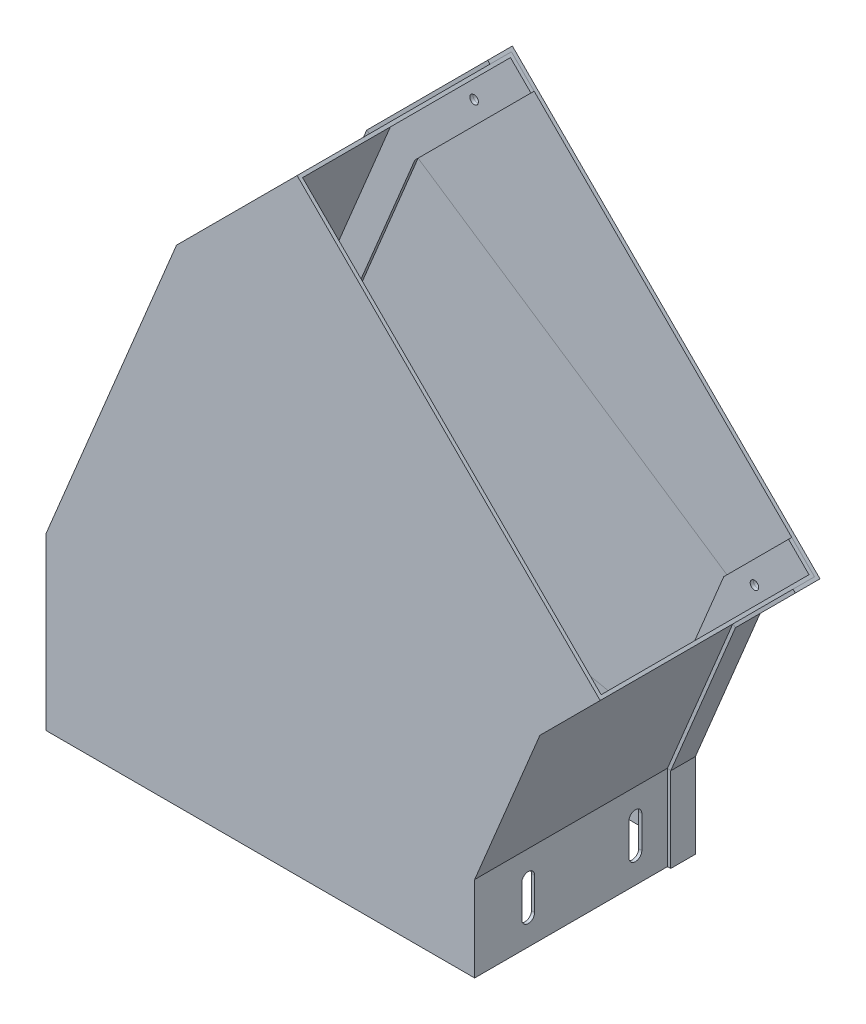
ISO-10303-21;
HEADER;
FILE_DESCRIPTION(('STEP AP214'),'2;1');
FILE_NAME('part.step','',(''),(''),'','','');
FILE_SCHEMA(('AUTOMOTIVE_DESIGN { 1 0 10303 214 1 1 1 1 }'));
ENDSEC;
DATA;
#1=APPLICATION_CONTEXT('core data for automotive mechanical design processes');
#2=APPLICATION_PROTOCOL_DEFINITION('international standard','automotive_design',2000,#1);
#3=PRODUCT_CONTEXT('',#1,'mechanical');
#4=PRODUCT('Part','Part','',(#3));
#5=PRODUCT_RELATED_PRODUCT_CATEGORY('part','',(#4));
#6=PRODUCT_DEFINITION_FORMATION('','',#4);
#7=PRODUCT_DEFINITION_CONTEXT('part definition',#1,'design');
#8=PRODUCT_DEFINITION('design','',#6,#7);
#9=PRODUCT_DEFINITION_SHAPE('','',#8);
#10=(LENGTH_UNIT() NAMED_UNIT(*) SI_UNIT(.MILLI.,.METRE.));
#11=(NAMED_UNIT(*) PLANE_ANGLE_UNIT() SI_UNIT($,.RADIAN.));
#12=(NAMED_UNIT(*) SI_UNIT($,.STERADIAN.) SOLID_ANGLE_UNIT());
#13=UNCERTAINTY_MEASURE_WITH_UNIT(LENGTH_MEASURE(1.E-05),#10,'distance_accuracy_value','');
#14=(GEOMETRIC_REPRESENTATION_CONTEXT(3) GLOBAL_UNCERTAINTY_ASSIGNED_CONTEXT((#13)) GLOBAL_UNIT_ASSIGNED_CONTEXT((#10,
#11,#12)) REPRESENTATION_CONTEXT('',''));
#15=CARTESIAN_POINT('',(0.,0.,0.));
#16=DIRECTION('',(0.,0.,1.));
#17=DIRECTION('',(1.,0.,0.));
#18=AXIS2_PLACEMENT_3D('',#15,#16,#17);
#19=CARTESIAN_POINT('',(-340.781097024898,227.702649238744,-50.0000000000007));
#20=DIRECTION('',(0.,0.,-1.));
#21=DIRECTION('',(0.,1.,0.));
#22=AXIS2_PLACEMENT_3D('',#19,#20,#21);
#23=PLANE('',#22);
#24=CARTESIAN_POINT('',(-298.752615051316,256.326208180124,-50.0000000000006));
#25=DIRECTION('',(0.,0.,-1.));
#26=DIRECTION('',(0.,1.,0.));
#27=AXIS2_PLACEMENT_3D('',#24,#25,#26);
#28=CIRCLE('',#27,2.);
#29=CARTESIAN_POINT('',(-296.752615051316,256.326208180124,-50.0000000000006));
#30=VERTEX_POINT('',#29);
#31=EDGE_CURVE('E618',#30,#30,#28,.T.);
#32=ORIENTED_EDGE('',*,*,#31,.T.);
#33=EDGE_LOOP('',(#32));
#34=FACE_BOUND('',#33,.T.);
#35=CARTESIAN_POINT('',(-167.937860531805,125.511453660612,-49.9999999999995));
#36=DIRECTION('',(0.,0.,-1.));
#37=DIRECTION('',(0.,1.,0.));
#38=AXIS2_PLACEMENT_3D('',#35,#36,#37);
#39=CIRCLE('',#38,2.00000000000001);
#40=CARTESIAN_POINT('',(-165.937860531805,125.511453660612,-49.9999999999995));
#41=VERTEX_POINT('',#40);
#42=EDGE_CURVE('E622',#41,#41,#39,.T.);
#43=ORIENTED_EDGE('',*,*,#42,.T.);
#44=EDGE_LOOP('',(#43));
#45=FACE_BOUND('',#44,.T.);
#46=DIRECTION('',(0.707106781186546,-0.707106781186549,0.));
#47=VECTOR('',#46,1.);
#48=CARTESIAN_POINT('',(-284.241873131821,284.241873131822,-50.0000000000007));
#49=LINE('',#48,#47);
#50=CARTESIAN_POINT('',(-282.842712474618,282.842712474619,-50.0000000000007));
#51=VERTEX_POINT('',#50);
#52=CARTESIAN_POINT('',(-141.421356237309,141.421356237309,-49.9999999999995));
#53=VERTEX_POINT('',#52);
#54=EDGE_CURVE('E55',#51,#53,#49,.T.);
#55=ORIENTED_EDGE('',*,*,#54,.F.);
#56=DIRECTION('',(0.707106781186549,0.707106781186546,0.));
#57=VECTOR('',#56,1.);
#58=CARTESIAN_POINT('',(-339.103626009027,226.58179894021,-50.0000000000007));
#59=LINE('',#58,#57);
#60=CARTESIAN_POINT('',(-339.103626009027,226.58179894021,-50.0000000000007));
#61=VERTEX_POINT('',#60);
#62=EDGE_CURVE('E255',#61,#51,#59,.T.);
#63=ORIENTED_EDGE('',*,*,#62,.F.);
#64=DIRECTION('',(-0.831469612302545,0.555570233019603,0.));
#65=VECTOR('',#64,1.);
#66=CARTESIAN_POINT('',(-340.781097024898,227.702649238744,-50.0000000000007));
#67=LINE('',#66,#65);
#68=CARTESIAN_POINT('',(-169.551813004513,113.290899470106,-49.9999999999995));
#69=VERTEX_POINT('',#68);
#70=EDGE_CURVE('E251',#69,#61,#67,.T.);
#71=ORIENTED_EDGE('',*,*,#70,.F.);
#72=DIRECTION('',(0.707106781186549,0.707106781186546,0.));
#73=VECTOR('',#72,1.);
#74=CARTESIAN_POINT('',(-169.551813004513,113.290899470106,-49.9999999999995));
#75=LINE('',#74,#73);
#76=EDGE_CURVE('E276',#69,#53,#75,.T.);
#77=ORIENTED_EDGE('',*,*,#76,.T.);
#78=EDGE_LOOP('',(#55,#63,#71,#77));
#79=FACE_BOUND('',#78,.T.);
#80=ADVANCED_FACE('F46',(#34,#45,#79),#23,.F.);
#81=CARTESIAN_POINT('',(-339.103626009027,226.581798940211,-40.0000000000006));
#82=DIRECTION('',(-0.707106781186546,0.707106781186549,0.));
#83=DIRECTION('',(-0.707106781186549,-0.707106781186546,0.));
#84=AXIS2_PLACEMENT_3D('',#81,#82,#83);
#85=PLANE('',#84);
#86=DIRECTION('',(0.,0.,-1.));
#87=VECTOR('',#86,1.);
#88=CARTESIAN_POINT('',(-282.842712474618,282.842712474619,-40.0000000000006));
#89=LINE('',#88,#87);
#90=CARTESIAN_POINT('',(-282.842712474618,282.842712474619,-40.0000000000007));
#91=VERTEX_POINT('',#90);
#92=EDGE_CURVE('E83',#91,#51,#89,.T.);
#93=ORIENTED_EDGE('',*,*,#92,.F.);
#94=DIRECTION('',(0.707106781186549,0.707106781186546,0.));
#95=VECTOR('',#94,1.);
#96=CARTESIAN_POINT('',(-339.103626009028,226.58179894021,-40.0000000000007));
#97=LINE('',#96,#95);
#98=CARTESIAN_POINT('',(-339.103626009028,226.58179894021,-40.0000000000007));
#99=VERTEX_POINT('',#98);
#100=EDGE_CURVE('E258',#99,#91,#97,.T.);
#101=ORIENTED_EDGE('',*,*,#100,.F.);
#102=DIRECTION('',(0.,0.,1.));
#103=VECTOR('',#102,1.);
#104=CARTESIAN_POINT('',(-339.103626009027,226.581798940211,-40.0000000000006));
#105=LINE('',#104,#103);
#106=EDGE_CURVE('E254',#61,#99,#105,.T.);
#107=ORIENTED_EDGE('',*,*,#106,.F.);
#108=ORIENTED_EDGE('',*,*,#62,.T.);
#109=EDGE_LOOP('',(#93,#101,#107,#108));
#110=FACE_BOUND('',#109,.T.);
#111=ADVANCED_FACE('F381',(#110),#85,.F.);
#112=CARTESIAN_POINT('',(-340.781097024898,227.702649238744,-40.0000000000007));
#113=DIRECTION('',(0.,0.,-1.));
#114=DIRECTION('',(0.,1.,0.));
#115=AXIS2_PLACEMENT_3D('',#112,#113,#114);
#116=PLANE('',#115);
#117=DIRECTION('',(0.707106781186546,-0.707106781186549,0.));
#118=VECTOR('',#117,1.);
#119=CARTESIAN_POINT('',(-284.241873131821,284.241873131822,-40.0000000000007));
#120=LINE('',#119,#118);
#121=CARTESIAN_POINT('',(-283.903372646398,283.903372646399,-40.0000000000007));
#122=VERTEX_POINT('',#121);
#123=EDGE_CURVE('E80',#122,#91,#120,.T.);
#124=ORIENTED_EDGE('',*,*,#123,.F.);
#125=DIRECTION('',(0.707106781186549,0.707106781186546,0.));
#126=VECTOR('',#125,1.);
#127=CARTESIAN_POINT('',(-340.375264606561,227.431480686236,-40.0000000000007));
#128=LINE('',#127,#126);
#129=CARTESIAN_POINT('',(-340.375264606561,227.431480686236,-40.0000000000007));
#130=VERTEX_POINT('',#129);
#131=EDGE_CURVE('E262',#130,#122,#128,.T.);
#132=ORIENTED_EDGE('',*,*,#131,.F.);
#133=DIRECTION('',(-0.831469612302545,0.555570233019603,0.));
#134=VECTOR('',#133,1.);
#135=CARTESIAN_POINT('',(-340.781097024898,227.702649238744,-40.0000000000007));
#136=LINE('',#135,#134);
#137=EDGE_CURVE('E306',#99,#130,#136,.T.);
#138=ORIENTED_EDGE('',*,*,#137,.F.);
#139=ORIENTED_EDGE('',*,*,#100,.T.);
#140=EDGE_LOOP('',(#124,#132,#138,#139));
#141=FACE_BOUND('',#140,.T.);
#142=ADVANCED_FACE('F384',(#141),#116,.F.);
#143=CARTESIAN_POINT('',(-340.375264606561,227.431480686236,-40.0000000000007));
#144=DIRECTION('',(0.707106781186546,-0.707106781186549,0.));
#145=DIRECTION('',(0.707106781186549,0.707106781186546,0.));
#146=AXIS2_PLACEMENT_3D('',#143,#144,#145);
#147=PLANE('',#146);
#148=DIRECTION('',(0.,0.,1.));
#149=VECTOR('',#148,1.);
#150=CARTESIAN_POINT('',(-283.903372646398,283.903372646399,-40.0000000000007));
#151=LINE('',#150,#149);
#152=CARTESIAN_POINT('',(-283.903372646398,283.903372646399,-51.5000000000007));
#153=VERTEX_POINT('',#152);
#154=EDGE_CURVE('E77',#153,#122,#151,.T.);
#155=ORIENTED_EDGE('',*,*,#154,.F.);
#156=DIRECTION('',(0.707106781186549,0.707106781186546,0.));
#157=VECTOR('',#156,1.);
#158=CARTESIAN_POINT('',(-340.375264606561,227.431480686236,-51.5000000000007));
#159=LINE('',#158,#157);
#160=CARTESIAN_POINT('',(-340.375264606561,227.431480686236,-51.5000000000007));
#161=VERTEX_POINT('',#160);
#162=EDGE_CURVE('E265',#161,#153,#159,.T.);
#163=ORIENTED_EDGE('',*,*,#162,.F.);
#164=DIRECTION('',(0.,0.,-1.));
#165=VECTOR('',#164,1.);
#166=CARTESIAN_POINT('',(-340.375264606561,227.431480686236,-40.0000000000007));
#167=LINE('',#166,#165);
#168=EDGE_CURVE('E303',#130,#161,#167,.T.);
#169=ORIENTED_EDGE('',*,*,#168,.F.);
#170=ORIENTED_EDGE('',*,*,#131,.T.);
#171=EDGE_LOOP('',(#155,#163,#169,#170));
#172=FACE_BOUND('',#171,.T.);
#173=ADVANCED_FACE('F365',(#172),#147,.F.);
#174=CARTESIAN_POINT('',(-341.911223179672,228.457775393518,-51.5000000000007));
#175=DIRECTION('',(0.,0.,1.));
#176=DIRECTION('',(0.,-1.,0.));
#177=AXIS2_PLACEMENT_3D('',#174,#175,#176);
#178=PLANE('',#177);
#179=CARTESIAN_POINT('',(-298.752615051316,256.326208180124,-51.5000000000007));
#180=DIRECTION('',(0.,0.,1.));
#181=DIRECTION('',(1.,0.,0.));
#182=AXIS2_PLACEMENT_3D('',#179,#180,#181);
#183=CIRCLE('',#182,2.);
#184=CARTESIAN_POINT('',(-296.752615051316,256.326208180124,-51.5000000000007));
#185=VERTEX_POINT('',#184);
#186=EDGE_CURVE('E616',#185,#185,#183,.T.);
#187=ORIENTED_EDGE('',*,*,#186,.T.);
#188=EDGE_LOOP('',(#187));
#189=FACE_BOUND('',#188,.T.);
#190=CARTESIAN_POINT('',(-167.937860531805,125.511453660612,-51.5000000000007));
#191=DIRECTION('',(0.,0.,1.));
#192=DIRECTION('',(1.,0.,0.));
#193=AXIS2_PLACEMENT_3D('',#190,#191,#192);
#194=CIRCLE('',#193,2.00000000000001);
#195=CARTESIAN_POINT('',(-165.937860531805,125.511453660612,-51.5000000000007));
#196=VERTEX_POINT('',#195);
#197=EDGE_CURVE('E619',#196,#196,#194,.T.);
#198=ORIENTED_EDGE('',*,*,#197,.T.);
#199=EDGE_LOOP('',(#198));
#200=FACE_BOUND('',#199,.T.);
#201=DIRECTION('',(-0.707106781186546,0.707106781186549,0.));
#202=VECTOR('',#201,1.);
#203=CARTESIAN_POINT('',(-285.184499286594,285.184499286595,-51.5000000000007));
#204=LINE('',#203,#202);
#205=CARTESIAN_POINT('',(-140.360696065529,140.36069606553,-51.4999999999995));
#206=VERTEX_POINT('',#205);
#207=EDGE_CURVE('E283',#206,#153,#204,.T.);
#208=ORIENTED_EDGE('',*,*,#207,.F.);
#209=DIRECTION('',(0.707106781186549,0.707106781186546,0.));
#210=VECTOR('',#209,1.);
#211=CARTESIAN_POINT('',(-168.280174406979,112.44121772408,-51.4999999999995));
#212=LINE('',#211,#210);
#213=CARTESIAN_POINT('',(-168.280174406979,112.44121772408,-51.4999999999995));
#214=VERTEX_POINT('',#213);
#215=EDGE_CURVE('E268',#214,#206,#212,.T.);
#216=ORIENTED_EDGE('',*,*,#215,.F.);
#217=DIRECTION('',(0.831469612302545,-0.555570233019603,0.));
#218=VECTOR('',#217,1.);
#219=CARTESIAN_POINT('',(-341.911223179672,228.457775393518,-51.5000000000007));
#220=LINE('',#219,#218);
#221=EDGE_CURVE('E300',#161,#214,#220,.T.);
#222=ORIENTED_EDGE('',*,*,#221,.F.);
#223=ORIENTED_EDGE('',*,*,#162,.T.);
#224=EDGE_LOOP('',(#208,#216,#222,#223));
#225=FACE_BOUND('',#224,.T.);
#226=ADVANCED_FACE('F369',(#189,#200,#225),#178,.F.);
#227=CARTESIAN_POINT('',(-168.280174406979,112.44121772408,-51.4999999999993));
#228=DIRECTION('',(-0.707106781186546,0.707106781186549,0.));
#229=DIRECTION('',(-0.707106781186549,-0.707106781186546,0.));
#230=AXIS2_PLACEMENT_3D('',#227,#228,#229);
#231=PLANE('',#230);
#232=DIRECTION('',(0.,0.,-1.));
#233=VECTOR('',#232,1.);
#234=CARTESIAN_POINT('',(-140.360696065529,140.36069606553,-51.4999999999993));
#235=LINE('',#234,#233);
#236=CARTESIAN_POINT('',(-140.360696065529,140.36069606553,-39.9999999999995));
#237=VERTEX_POINT('',#236);
#238=EDGE_CURVE('E280',#237,#206,#235,.T.);
#239=ORIENTED_EDGE('',*,*,#238,.F.);
#240=DIRECTION('',(0.707106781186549,0.707106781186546,0.));
#241=VECTOR('',#240,1.);
#242=CARTESIAN_POINT('',(-168.280174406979,112.44121772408,-39.9999999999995));
#243=LINE('',#242,#241);
#244=CARTESIAN_POINT('',(-168.280174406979,112.44121772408,-39.9999999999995));
#245=VERTEX_POINT('',#244);
#246=EDGE_CURVE('E271',#245,#237,#243,.T.);
#247=ORIENTED_EDGE('',*,*,#246,.F.);
#248=DIRECTION('',(0.,0.,1.));
#249=VECTOR('',#248,1.);
#250=CARTESIAN_POINT('',(-168.280174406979,112.44121772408,-51.4999999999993));
#251=LINE('',#250,#249);
#252=EDGE_CURVE('E297',#214,#245,#251,.T.);
#253=ORIENTED_EDGE('',*,*,#252,.F.);
#254=ORIENTED_EDGE('',*,*,#215,.T.);
#255=EDGE_LOOP('',(#239,#247,#253,#254));
#256=FACE_BOUND('',#255,.T.);
#257=ADVANCED_FACE('F372',(#256),#231,.F.);
#258=CARTESIAN_POINT('',(-188.967483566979,126.264035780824,-39.9999999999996));
#259=DIRECTION('',(0.,0.,-1.));
#260=DIRECTION('',(0.,1.,0.));
#261=AXIS2_PLACEMENT_3D('',#258,#259,#260);
#262=PLANE('',#261);
#263=DIRECTION('',(0.707106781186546,-0.707106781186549,0.));
#264=VECTOR('',#263,1.);
#265=CARTESIAN_POINT('',(-157.615759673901,157.615759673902,-39.9999999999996));
#266=LINE('',#265,#264);
#267=CARTESIAN_POINT('',(-141.421356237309,141.42135623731,-39.9999999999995));
#268=VERTEX_POINT('',#267);
#269=EDGE_CURVE('E277',#268,#237,#266,.T.);
#270=ORIENTED_EDGE('',*,*,#269,.F.);
#271=DIRECTION('',(0.707106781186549,0.707106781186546,0.));
#272=VECTOR('',#271,1.);
#273=CARTESIAN_POINT('',(-169.551813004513,113.290899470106,-39.9999999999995));
#274=LINE('',#273,#272);
#275=CARTESIAN_POINT('',(-169.551813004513,113.290899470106,-39.9999999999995));
#276=VERTEX_POINT('',#275);
#277=EDGE_CURVE('E274',#276,#268,#274,.T.);
#278=ORIENTED_EDGE('',*,*,#277,.F.);
#279=DIRECTION('',(-0.831469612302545,0.555570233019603,0.));
#280=VECTOR('',#279,1.);
#281=CARTESIAN_POINT('',(-188.967483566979,126.264035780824,-39.9999999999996));
#282=LINE('',#281,#280);
#283=EDGE_CURVE('E294',#245,#276,#282,.T.);
#284=ORIENTED_EDGE('',*,*,#283,.F.);
#285=ORIENTED_EDGE('',*,*,#246,.T.);
#286=EDGE_LOOP('',(#270,#278,#284,#285));
#287=FACE_BOUND('',#286,.T.);
#288=ADVANCED_FACE('F375',(#287),#262,.F.);
#289=CARTESIAN_POINT('',(-169.551813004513,113.290899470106,-49.9999999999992));
#290=DIRECTION('',(0.707106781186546,-0.707106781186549,0.));
#291=DIRECTION('',(0.707106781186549,0.707106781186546,0.));
#292=AXIS2_PLACEMENT_3D('',#289,#290,#291);
#293=PLANE('',#292);
#294=DIRECTION('',(0.,0.,1.));
#295=VECTOR('',#294,1.);
#296=CARTESIAN_POINT('',(-141.421356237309,141.42135623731,-49.9999999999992));
#297=LINE('',#296,#295);
#298=EDGE_CURVE('E13',#53,#268,#297,.T.);
#299=ORIENTED_EDGE('',*,*,#298,.F.);
#300=ORIENTED_EDGE('',*,*,#76,.F.);
#301=DIRECTION('',(0.,0.,-1.));
#302=VECTOR('',#301,1.);
#303=CARTESIAN_POINT('',(-169.551813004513,113.290899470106,-49.9999999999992));
#304=LINE('',#303,#302);
#305=EDGE_CURVE('E259',#276,#69,#304,.T.);
#306=ORIENTED_EDGE('',*,*,#305,.F.);
#307=ORIENTED_EDGE('',*,*,#277,.T.);
#308=EDGE_LOOP('',(#299,#300,#306,#307));
#309=FACE_BOUND('',#308,.T.);
#310=ADVANCED_FACE('F48',(#309),#293,.F.);
#311=CARTESIAN_POINT('',(-400.,79.5649469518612,-40.0000000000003));
#312=DIRECTION('',(0.923879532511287,-0.38268343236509,0.));
#313=DIRECTION('',(0.38268343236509,0.923879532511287,0.));
#314=AXIS2_PLACEMENT_3D('',#311,#312,#313);
#315=PLANE('',#314);
#316=DIRECTION('',(0.38268343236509,0.923879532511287,0.));
#317=VECTOR('',#316,1.);
#318=CARTESIAN_POINT('',(-400.,79.5649469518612,-50.0000000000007));
#319=LINE('',#318,#317);
#320=CARTESIAN_POINT('',(-400.,79.5649469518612,-50.0000000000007));
#321=VERTEX_POINT('',#320);
#322=EDGE_CURVE('E248',#321,#61,#319,.T.);
#323=ORIENTED_EDGE('',*,*,#322,.T.);
#324=ORIENTED_EDGE('',*,*,#106,.T.);
#325=DIRECTION('',(0.38268343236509,0.923879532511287,0.));
#326=VECTOR('',#325,1.);
#327=CARTESIAN_POINT('',(-400.,79.5649469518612,-40.0000000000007));
#328=LINE('',#327,#326);
#329=CARTESIAN_POINT('',(-400.,79.5649469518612,-40.0000000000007));
#330=VERTEX_POINT('',#329);
#331=EDGE_CURVE('E227',#330,#99,#328,.T.);
#332=ORIENTED_EDGE('',*,*,#331,.F.);
#333=DIRECTION('',(0.,0.,-1.));
#334=VECTOR('',#333,1.);
#335=CARTESIAN_POINT('',(-400.,79.5649469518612,-40.0000000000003));
#336=LINE('',#335,#334);
#337=EDGE_CURVE('E169',#330,#321,#336,.T.);
#338=ORIENTED_EDGE('',*,*,#337,.T.);
#339=EDGE_LOOP('',(#323,#324,#332,#338));
#340=FACE_BOUND('',#339,.T.);
#341=ADVANCED_FACE('F330',(#340),#315,.T.);
#342=CARTESIAN_POINT('',(-435.098622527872,86.5464970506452,-40.0000000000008));
#343=DIRECTION('',(0.,0.,1.));
#344=DIRECTION('',(1.,0.,0.));
#345=AXIS2_PLACEMENT_3D('',#342,#343,#344);
#346=PLANE('',#345);
#347=ORIENTED_EDGE('',*,*,#331,.T.);
#348=ORIENTED_EDGE('',*,*,#137,.T.);
#349=DIRECTION('',(0.38268343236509,0.923879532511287,0.));
#350=VECTOR('',#349,1.);
#351=CARTESIAN_POINT('',(-401.5,79.8633155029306,-40.0000000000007));
#352=LINE('',#351,#350);
#353=CARTESIAN_POINT('',(-401.5,79.8633155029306,-40.0000000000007));
#354=VERTEX_POINT('',#353);
#355=EDGE_CURVE('E230',#354,#130,#352,.T.);
#356=ORIENTED_EDGE('',*,*,#355,.F.);
#357=DIRECTION('',(0.98078528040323,-0.195090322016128,0.));
#358=VECTOR('',#357,1.);
#359=CARTESIAN_POINT('',(-435.098622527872,86.5464970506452,-40.0000000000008));
#360=LINE('',#359,#358);
#361=EDGE_CURVE('E224',#354,#330,#360,.T.);
#362=ORIENTED_EDGE('',*,*,#361,.T.);
#363=EDGE_LOOP('',(#347,#348,#356,#362));
#364=FACE_BOUND('',#363,.T.);
#365=ADVANCED_FACE('F386',(#364),#346,.T.);
#366=CARTESIAN_POINT('',(-401.5,79.8633155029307,-40.0000000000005));
#367=DIRECTION('',(-0.923879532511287,0.38268343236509,0.));
#368=DIRECTION('',(-0.38268343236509,-0.923879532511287,0.));
#369=AXIS2_PLACEMENT_3D('',#366,#367,#368);
#370=PLANE('',#369);
#371=ORIENTED_EDGE('',*,*,#355,.T.);
#372=ORIENTED_EDGE('',*,*,#168,.T.);
#373=DIRECTION('',(0.38268343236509,0.923879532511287,0.));
#374=VECTOR('',#373,1.);
#375=CARTESIAN_POINT('',(-401.5,79.8633155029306,-51.5000000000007));
#376=LINE('',#375,#374);
#377=CARTESIAN_POINT('',(-401.5,79.8633155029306,-51.5000000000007));
#378=VERTEX_POINT('',#377);
#379=EDGE_CURVE('E233',#378,#161,#376,.T.);
#380=ORIENTED_EDGE('',*,*,#379,.F.);
#381=DIRECTION('',(0.,0.,1.));
#382=VECTOR('',#381,1.);
#383=CARTESIAN_POINT('',(-401.5,79.8633155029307,-40.0000000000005));
#384=LINE('',#383,#382);
#385=EDGE_CURVE('E173',#378,#354,#384,.T.);
#386=ORIENTED_EDGE('',*,*,#385,.T.);
#387=EDGE_LOOP('',(#371,#372,#380,#386));
#388=FACE_BOUND('',#387,.T.);
#389=ADVANCED_FACE('F362',(#388),#370,.T.);
#390=CARTESIAN_POINT('',(-436.541532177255,86.833509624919,-51.5000000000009));
#391=DIRECTION('',(0.,0.,-1.));
#392=DIRECTION('',(-1.,0.,0.));
#393=AXIS2_PLACEMENT_3D('',#390,#391,#392);
#394=PLANE('',#393);
#395=ORIENTED_EDGE('',*,*,#379,.T.);
#396=ORIENTED_EDGE('',*,*,#221,.T.);
#397=DIRECTION('',(0.38268343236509,0.923879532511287,0.));
#398=VECTOR('',#397,1.);
#399=CARTESIAN_POINT('',(-198.5,39.48410492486,-51.4999999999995));
#400=LINE('',#399,#398);
#401=CARTESIAN_POINT('',(-198.5,39.48410492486,-51.4999999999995));
#402=VERTEX_POINT('',#401);
#403=EDGE_CURVE('E236',#402,#214,#400,.T.);
#404=ORIENTED_EDGE('',*,*,#403,.F.);
#405=DIRECTION('',(-0.98078528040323,0.195090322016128,0.));
#406=VECTOR('',#405,1.);
#407=CARTESIAN_POINT('',(-436.541532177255,86.833509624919,-51.5000000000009));
#408=LINE('',#407,#406);
#409=EDGE_CURVE('E313',#402,#378,#408,.T.);
#410=ORIENTED_EDGE('',*,*,#409,.T.);
#411=EDGE_LOOP('',(#395,#396,#404,#410));
#412=FACE_BOUND('',#411,.T.);
#413=ADVANCED_FACE('F358',(#412),#394,.T.);
#414=CARTESIAN_POINT('',(-198.5,39.48410492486,-51.4999999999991));
#415=DIRECTION('',(0.923879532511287,-0.38268343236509,0.));
#416=DIRECTION('',(0.38268343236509,0.923879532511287,0.));
#417=AXIS2_PLACEMENT_3D('',#414,#415,#416);
#418=PLANE('',#417);
#419=ORIENTED_EDGE('',*,*,#403,.T.);
#420=ORIENTED_EDGE('',*,*,#252,.T.);
#421=DIRECTION('',(0.38268343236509,0.923879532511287,0.));
#422=VECTOR('',#421,1.);
#423=CARTESIAN_POINT('',(-198.5,39.4841049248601,-39.9999999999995));
#424=LINE('',#423,#422);
#425=CARTESIAN_POINT('',(-198.5,39.4841049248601,-39.9999999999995));
#426=VERTEX_POINT('',#425);
#427=EDGE_CURVE('E239',#426,#245,#424,.T.);
#428=ORIENTED_EDGE('',*,*,#427,.F.);
#429=DIRECTION('',(0.,0.,-1.));
#430=VECTOR('',#429,1.);
#431=CARTESIAN_POINT('',(-198.5,39.48410492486,-51.4999999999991));
#432=LINE('',#431,#430);
#433=EDGE_CURVE('E316',#426,#402,#432,.T.);
#434=ORIENTED_EDGE('',*,*,#433,.T.);
#435=EDGE_LOOP('',(#419,#420,#428,#434));
#436=FACE_BOUND('',#435,.T.);
#437=ADVANCED_FACE('F352',(#436),#418,.T.);
#438=CARTESIAN_POINT('',(-241.26775962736,47.9911412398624,-39.9999999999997));
#439=DIRECTION('',(0.,0.,1.));
#440=DIRECTION('',(1.,0.,0.));
#441=AXIS2_PLACEMENT_3D('',#438,#439,#440);
#442=PLANE('',#441);
#443=ORIENTED_EDGE('',*,*,#427,.T.);
#444=ORIENTED_EDGE('',*,*,#283,.T.);
#445=DIRECTION('',(0.38268343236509,0.923879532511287,0.));
#446=VECTOR('',#445,1.);
#447=CARTESIAN_POINT('',(-200.,39.7824734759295,-39.9999999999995));
#448=LINE('',#447,#446);
#449=CARTESIAN_POINT('',(-200.,39.7824734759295,-39.9999999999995));
#450=VERTEX_POINT('',#449);
#451=EDGE_CURVE('E242',#450,#276,#448,.T.);
#452=ORIENTED_EDGE('',*,*,#451,.F.);
#453=DIRECTION('',(0.98078528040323,-0.195090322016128,0.));
#454=VECTOR('',#453,1.);
#455=CARTESIAN_POINT('',(-241.26775962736,47.9911412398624,-39.9999999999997));
#456=LINE('',#455,#454);
#457=EDGE_CURVE('E319',#450,#426,#456,.T.);
#458=ORIENTED_EDGE('',*,*,#457,.T.);
#459=EDGE_LOOP('',(#443,#444,#452,#458));
#460=FACE_BOUND('',#459,.T.);
#461=ADVANCED_FACE('F346',(#460),#442,.T.);
#462=CARTESIAN_POINT('',(-200.,39.7824734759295,-49.9999999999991));
#463=DIRECTION('',(-0.923879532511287,0.38268343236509,0.));
#464=DIRECTION('',(-0.38268343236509,-0.923879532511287,0.));
#465=AXIS2_PLACEMENT_3D('',#462,#463,#464);
#466=PLANE('',#465);
#467=ORIENTED_EDGE('',*,*,#451,.T.);
#468=ORIENTED_EDGE('',*,*,#305,.T.);
#469=DIRECTION('',(0.38268343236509,0.923879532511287,0.));
#470=VECTOR('',#469,1.);
#471=CARTESIAN_POINT('',(-200.,39.7824734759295,-49.9999999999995));
#472=LINE('',#471,#470);
#473=CARTESIAN_POINT('',(-200.,39.7824734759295,-49.9999999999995));
#474=VERTEX_POINT('',#473);
#475=EDGE_CURVE('E245',#474,#69,#472,.T.);
#476=ORIENTED_EDGE('',*,*,#475,.F.);
#477=DIRECTION('',(0.,0.,1.));
#478=VECTOR('',#477,1.);
#479=CARTESIAN_POINT('',(-200.,39.7824734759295,-49.9999999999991));
#480=LINE('',#479,#478);
#481=EDGE_CURVE('E322',#474,#450,#480,.T.);
#482=ORIENTED_EDGE('',*,*,#481,.T.);
#483=EDGE_LOOP('',(#467,#468,#476,#482));
#484=FACE_BOUND('',#483,.T.);
#485=ADVANCED_FACE('F340',(#484),#466,.T.);
#486=CARTESIAN_POINT('',(-435.098622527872,86.5464970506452,-50.0000000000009));
#487=DIRECTION('',(0.,0.,1.));
#488=DIRECTION('',(1.,0.,0.));
#489=AXIS2_PLACEMENT_3D('',#486,#487,#488);
#490=PLANE('',#489);
#491=ORIENTED_EDGE('',*,*,#475,.T.);
#492=ORIENTED_EDGE('',*,*,#70,.T.);
#493=ORIENTED_EDGE('',*,*,#322,.F.);
#494=DIRECTION('',(0.98078528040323,-0.195090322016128,0.));
#495=VECTOR('',#494,1.);
#496=CARTESIAN_POINT('',(-435.098622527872,86.5464970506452,-50.0000000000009));
#497=LINE('',#496,#495);
#498=EDGE_CURVE('E324',#321,#474,#497,.T.);
#499=ORIENTED_EDGE('',*,*,#498,.T.);
#500=EDGE_LOOP('',(#491,#492,#493,#499));
#501=FACE_BOUND('',#500,.T.);
#502=ADVANCED_FACE('F378',(#501),#490,.T.);
#503=CARTESIAN_POINT('',(-400.,262.999188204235,-40.0000000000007));
#504=DIRECTION('',(-1.,0.,0.));
#505=DIRECTION('',(0.,0.,1.));
#506=AXIS2_PLACEMENT_3D('',#503,#504,#505);
#507=PLANE('',#506);
#508=ORIENTED_EDGE('',*,*,#337,.F.);
#509=DIRECTION('',(0.,-1.,0.));
#510=VECTOR('',#509,1.);
#511=CARTESIAN_POINT('',(-400.,262.999188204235,-40.0000000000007));
#512=LINE('',#511,#510);
#513=CARTESIAN_POINT('',(-400.,0.,-40.0000000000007));
#514=VERTEX_POINT('',#513);
#515=EDGE_CURVE('E162',#330,#514,#512,.T.);
#516=ORIENTED_EDGE('',*,*,#515,.T.);
#517=DIRECTION('',(0.,0.,-1.));
#518=VECTOR('',#517,1.);
#519=CARTESIAN_POINT('',(-400.,0.,-40.0000000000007));
#520=LINE('',#519,#518);
#521=CARTESIAN_POINT('',(-400.,0.,-50.0000000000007));
#522=VERTEX_POINT('',#521);
#523=EDGE_CURVE('E166',#514,#522,#520,.T.);
#524=ORIENTED_EDGE('',*,*,#523,.T.);
#525=DIRECTION('',(0.,-1.,0.));
#526=VECTOR('',#525,1.);
#527=CARTESIAN_POINT('',(-400.,262.999188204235,-50.0000000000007));
#528=LINE('',#527,#526);
#529=EDGE_CURVE('E174',#321,#522,#528,.T.);
#530=ORIENTED_EDGE('',*,*,#529,.F.);
#531=EDGE_LOOP('',(#508,#516,#524,#530));
#532=FACE_BOUND('',#531,.T.);
#533=ADVANCED_FACE('F164',(#532),#507,.F.);
#534=CARTESIAN_POINT('',(-400.,262.999188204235,-50.0000000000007));
#535=DIRECTION('',(0.,0.,-1.));
#536=DIRECTION('',(-1.,0.,0.));
#537=AXIS2_PLACEMENT_3D('',#534,#535,#536);
#538=PLANE('',#537);
#539=CARTESIAN_POINT('',(-207.5,30.,-49.9999999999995));
#540=DIRECTION('',(0.,0.,-1.));
#541=DIRECTION('',(-1.,0.,0.));
#542=AXIS2_PLACEMENT_3D('',#539,#540,#541);
#543=CIRCLE('',#542,2.);
#544=CARTESIAN_POINT('',(-205.5,30.,-49.9999999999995));
#545=VERTEX_POINT('',#544);
#546=EDGE_CURVE('E189',#545,#545,#543,.T.);
#547=ORIENTED_EDGE('',*,*,#546,.T.);
#548=EDGE_LOOP('',(#547));
#549=FACE_BOUND('',#548,.T.);
#550=CARTESIAN_POINT('',(-392.5,29.9999999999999,-50.0000000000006));
#551=DIRECTION('',(0.,0.,-1.));
#552=DIRECTION('',(-1.,0.,0.));
#553=AXIS2_PLACEMENT_3D('',#550,#551,#552);
#554=CIRCLE('',#553,2.00000000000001);
#555=CARTESIAN_POINT('',(-390.5,29.9999999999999,-50.0000000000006));
#556=VERTEX_POINT('',#555);
#557=EDGE_CURVE('E192',#556,#556,#554,.T.);
#558=ORIENTED_EDGE('',*,*,#557,.T.);
#559=EDGE_LOOP('',(#558));
#560=FACE_BOUND('',#559,.T.);
#561=ORIENTED_EDGE('',*,*,#498,.F.);
#562=ORIENTED_EDGE('',*,*,#529,.T.);
#563=DIRECTION('',(1.,0.,0.));
#564=VECTOR('',#563,1.);
#565=CARTESIAN_POINT('',(-400.,0.,-50.0000000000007));
#566=LINE('',#565,#564);
#567=CARTESIAN_POINT('',(-200.,0.,-49.9999999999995));
#568=VERTEX_POINT('',#567);
#569=EDGE_CURVE('E183',#522,#568,#566,.T.);
#570=ORIENTED_EDGE('',*,*,#569,.T.);
#571=DIRECTION('',(0.,-1.,0.));
#572=VECTOR('',#571,1.);
#573=CARTESIAN_POINT('',(-200.,262.999188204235,-49.9999999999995));
#574=LINE('',#573,#572);
#575=EDGE_CURVE('E221',#474,#568,#574,.T.);
#576=ORIENTED_EDGE('',*,*,#575,.F.);
#577=EDGE_LOOP('',(#561,#562,#570,#576));
#578=FACE_BOUND('',#577,.T.);
#579=ADVANCED_FACE('F333',(#549,#560,#578),#538,.F.);
#580=CARTESIAN_POINT('',(-200.,262.999188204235,-49.9999999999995));
#581=DIRECTION('',(1.,0.,0.));
#582=DIRECTION('',(0.,0.,-1.));
#583=AXIS2_PLACEMENT_3D('',#580,#581,#582);
#584=PLANE('',#583);
#585=ORIENTED_EDGE('',*,*,#481,.F.);
#586=ORIENTED_EDGE('',*,*,#575,.T.);
#587=DIRECTION('',(0.,0.,1.));
#588=VECTOR('',#587,1.);
#589=CARTESIAN_POINT('',(-200.,0.,-49.9999999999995));
#590=LINE('',#589,#588);
#591=CARTESIAN_POINT('',(-200.,0.,-39.9999999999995));
#592=VERTEX_POINT('',#591);
#593=EDGE_CURVE('E198',#568,#592,#590,.T.);
#594=ORIENTED_EDGE('',*,*,#593,.T.);
#595=DIRECTION('',(0.,-1.,0.));
#596=VECTOR('',#595,1.);
#597=CARTESIAN_POINT('',(-200.,262.999188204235,-39.9999999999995));
#598=LINE('',#597,#596);
#599=EDGE_CURVE('E219',#450,#592,#598,.T.);
#600=ORIENTED_EDGE('',*,*,#599,.F.);
#601=EDGE_LOOP('',(#585,#586,#594,#600));
#602=FACE_BOUND('',#601,.T.);
#603=ADVANCED_FACE('F335',(#602),#584,.F.);
#604=CARTESIAN_POINT('',(-198.5,262.999188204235,-39.9999999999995));
#605=DIRECTION('',(0.,0.,-1.));
#606=DIRECTION('',(-1.,0.,0.));
#607=AXIS2_PLACEMENT_3D('',#604,#605,#606);
#608=PLANE('',#607);
#609=ORIENTED_EDGE('',*,*,#457,.F.);
#610=ORIENTED_EDGE('',*,*,#599,.T.);
#611=DIRECTION('',(1.,0.,0.));
#612=VECTOR('',#611,1.);
#613=CARTESIAN_POINT('',(-198.5,0.,-39.9999999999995));
#614=LINE('',#613,#612);
#615=CARTESIAN_POINT('',(-198.5,0.,-39.9999999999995));
#616=VERTEX_POINT('',#615);
#617=EDGE_CURVE('E201',#592,#616,#614,.T.);
#618=ORIENTED_EDGE('',*,*,#617,.T.);
#619=DIRECTION('',(0.,-1.,0.));
#620=VECTOR('',#619,1.);
#621=CARTESIAN_POINT('',(-198.5,262.999188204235,-39.9999999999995));
#622=LINE('',#621,#620);
#623=EDGE_CURVE('E217',#426,#616,#622,.T.);
#624=ORIENTED_EDGE('',*,*,#623,.F.);
#625=EDGE_LOOP('',(#609,#610,#618,#624));
#626=FACE_BOUND('',#625,.T.);
#627=ADVANCED_FACE('F343',(#626),#608,.F.);
#628=CARTESIAN_POINT('',(-198.5,262.999188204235,-51.4999999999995));
#629=DIRECTION('',(-1.,0.,0.));
#630=DIRECTION('',(0.,0.,1.));
#631=AXIS2_PLACEMENT_3D('',#628,#629,#630);
#632=PLANE('',#631);
#633=ORIENTED_EDGE('',*,*,#433,.F.);
#634=ORIENTED_EDGE('',*,*,#623,.T.);
#635=DIRECTION('',(0.,0.,-1.));
#636=VECTOR('',#635,1.);
#637=CARTESIAN_POINT('',(-198.5,0.,-51.4999999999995));
#638=LINE('',#637,#636);
#639=CARTESIAN_POINT('',(-198.5,0.,-51.4999999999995));
#640=VERTEX_POINT('',#639);
#641=EDGE_CURVE('E204',#616,#640,#638,.T.);
#642=ORIENTED_EDGE('',*,*,#641,.T.);
#643=DIRECTION('',(0.,-1.,0.));
#644=VECTOR('',#643,1.);
#645=CARTESIAN_POINT('',(-198.5,262.999188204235,-51.4999999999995));
#646=LINE('',#645,#644);
#647=EDGE_CURVE('E215',#402,#640,#646,.T.);
#648=ORIENTED_EDGE('',*,*,#647,.F.);
#649=EDGE_LOOP('',(#633,#634,#642,#648));
#650=FACE_BOUND('',#649,.T.);
#651=ADVANCED_FACE('F349',(#650),#632,.F.);
#652=CARTESIAN_POINT('',(-401.5,262.999188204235,-51.5000000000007));
#653=DIRECTION('',(0.,0.,1.));
#654=DIRECTION('',(1.,0.,0.));
#655=AXIS2_PLACEMENT_3D('',#652,#653,#654);
#656=PLANE('',#655);
#657=CARTESIAN_POINT('',(-207.5,30.,-51.5000000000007));
#658=DIRECTION('',(0.,0.,1.));
#659=DIRECTION('',(1.,0.,0.));
#660=AXIS2_PLACEMENT_3D('',#657,#658,#659);
#661=CIRCLE('',#660,2.);
#662=CARTESIAN_POINT('',(-205.5,30.,-51.5000000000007));
#663=VERTEX_POINT('',#662);
#664=EDGE_CURVE('E629',#663,#663,#661,.T.);
#665=ORIENTED_EDGE('',*,*,#664,.T.);
#666=EDGE_LOOP('',(#665));
#667=FACE_BOUND('',#666,.T.);
#668=CARTESIAN_POINT('',(-392.5,29.9999999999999,-51.5000000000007));
#669=DIRECTION('',(0.,0.,1.));
#670=DIRECTION('',(1.,0.,0.));
#671=AXIS2_PLACEMENT_3D('',#668,#669,#670);
#672=CIRCLE('',#671,2.00000000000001);
#673=CARTESIAN_POINT('',(-390.5,29.9999999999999,-51.5000000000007));
#674=VERTEX_POINT('',#673);
#675=EDGE_CURVE('E628',#674,#674,#672,.T.);
#676=ORIENTED_EDGE('',*,*,#675,.T.);
#677=EDGE_LOOP('',(#676));
#678=FACE_BOUND('',#677,.T.);
#679=ORIENTED_EDGE('',*,*,#409,.F.);
#680=ORIENTED_EDGE('',*,*,#647,.T.);
#681=DIRECTION('',(-1.,0.,0.));
#682=VECTOR('',#681,1.);
#683=CARTESIAN_POINT('',(-401.5,0.,-51.5000000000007));
#684=LINE('',#683,#682);
#685=CARTESIAN_POINT('',(-401.5,0.,-51.5000000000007));
#686=VERTEX_POINT('',#685);
#687=EDGE_CURVE('E207',#640,#686,#684,.T.);
#688=ORIENTED_EDGE('',*,*,#687,.T.);
#689=DIRECTION('',(0.,-1.,0.));
#690=VECTOR('',#689,1.);
#691=CARTESIAN_POINT('',(-401.5,262.999188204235,-51.5000000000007));
#692=LINE('',#691,#690);
#693=EDGE_CURVE('E213',#378,#686,#692,.T.);
#694=ORIENTED_EDGE('',*,*,#693,.F.);
#695=EDGE_LOOP('',(#679,#680,#688,#694));
#696=FACE_BOUND('',#695,.T.);
#697=ADVANCED_FACE('F355',(#667,#678,#696),#656,.F.);
#698=CARTESIAN_POINT('',(-401.5,262.999188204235,-40.0000000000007));
#699=DIRECTION('',(1.,0.,0.));
#700=DIRECTION('',(0.,0.,-1.));
#701=AXIS2_PLACEMENT_3D('',#698,#699,#700);
#702=PLANE('',#701);
#703=ORIENTED_EDGE('',*,*,#385,.F.);
#704=ORIENTED_EDGE('',*,*,#693,.T.);
#705=DIRECTION('',(0.,0.,1.));
#706=VECTOR('',#705,1.);
#707=CARTESIAN_POINT('',(-401.5,0.,-40.0000000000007));
#708=LINE('',#707,#706);
#709=CARTESIAN_POINT('',(-401.5,0.,-40.0000000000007));
#710=VERTEX_POINT('',#709);
#711=EDGE_CURVE('E210',#686,#710,#708,.T.);
#712=ORIENTED_EDGE('',*,*,#711,.T.);
#713=DIRECTION('',(0.,-1.,0.));
#714=VECTOR('',#713,1.);
#715=CARTESIAN_POINT('',(-401.5,262.999188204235,-40.0000000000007));
#716=LINE('',#715,#714);
#717=EDGE_CURVE('E187',#354,#710,#716,.T.);
#718=ORIENTED_EDGE('',*,*,#717,.F.);
#719=EDGE_LOOP('',(#703,#704,#712,#718));
#720=FACE_BOUND('',#719,.T.);
#721=ADVANCED_FACE('F360',(#720),#702,.F.);
#722=CARTESIAN_POINT('',(-400.,262.999188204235,-40.0000000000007));
#723=DIRECTION('',(0.,0.,-1.));
#724=DIRECTION('',(-1.,0.,0.));
#725=AXIS2_PLACEMENT_3D('',#722,#723,#724);
#726=PLANE('',#725);
#727=ORIENTED_EDGE('',*,*,#361,.F.);
#728=ORIENTED_EDGE('',*,*,#717,.T.);
#729=DIRECTION('',(1.,0.,0.));
#730=VECTOR('',#729,1.);
#731=CARTESIAN_POINT('',(-400.,0.,-40.0000000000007));
#732=LINE('',#731,#730);
#733=EDGE_CURVE('E180',#710,#514,#732,.T.);
#734=ORIENTED_EDGE('',*,*,#733,.T.);
#735=ORIENTED_EDGE('',*,*,#515,.F.);
#736=EDGE_LOOP('',(#727,#728,#734,#735));
#737=FACE_BOUND('',#736,.T.);
#738=ADVANCED_FACE('F185',(#737),#726,.F.);
#739=CARTESIAN_POINT('',(0.,0.,0.));
#740=DIRECTION('',(0.,-1.,0.));
#741=DIRECTION('',(0.,0.,-1.));
#742=AXIS2_PLACEMENT_3D('',#739,#740,#741);
#743=PLANE('',#742);
#744=ORIENTED_EDGE('',*,*,#733,.F.);
#745=ORIENTED_EDGE('',*,*,#711,.F.);
#746=ORIENTED_EDGE('',*,*,#687,.F.);
#747=ORIENTED_EDGE('',*,*,#641,.F.);
#748=ORIENTED_EDGE('',*,*,#617,.F.);
#749=ORIENTED_EDGE('',*,*,#593,.F.);
#750=ORIENTED_EDGE('',*,*,#569,.F.);
#751=ORIENTED_EDGE('',*,*,#523,.F.);
#752=EDGE_LOOP('',(#744,#745,#746,#747,#748,#749,#750,#751));
#753=FACE_BOUND('',#752,.T.);
#754=ADVANCED_FACE('F178',(#753),#743,.T.);
#755=CARTESIAN_POINT('',(-212.132034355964,212.132034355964,-45.7500000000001));
#756=DIRECTION('',(0.707106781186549,0.707106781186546,0.));
#757=DIRECTION('',(-0.707106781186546,0.707106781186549,0.));
#758=AXIS2_PLACEMENT_3D('',#755,#756,#757);
#759=PLANE('',#758);
#760=ORIENTED_EDGE('',*,*,#54,.T.);
#761=ORIENTED_EDGE('',*,*,#298,.T.);
#762=ORIENTED_EDGE('',*,*,#269,.T.);
#763=ORIENTED_EDGE('',*,*,#238,.T.);
#764=ORIENTED_EDGE('',*,*,#207,.T.);
#765=ORIENTED_EDGE('',*,*,#154,.T.);
#766=ORIENTED_EDGE('',*,*,#123,.T.);
#767=ORIENTED_EDGE('',*,*,#92,.T.);
#768=EDGE_LOOP('',(#760,#761,#762,#763,#764,#765,#766,#767));
#769=FACE_BOUND('',#768,.T.);
#770=ADVANCED_FACE('F534',(#769),#759,.T.);
#771=CARTESIAN_POINT('',(-392.5,29.9999999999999,-51.5000000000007));
#772=DIRECTION('',(0.,0.,1.));
#773=DIRECTION('',(1.,0.,0.));
#774=AXIS2_PLACEMENT_3D('',#771,#772,#773);
#775=CYLINDRICAL_SURFACE('',#774,2.00000000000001);
#776=CARTESIAN_POINT('',(-390.5,29.9999999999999,-51.5000000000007));
#777=CARTESIAN_POINT('',(-390.5,29.9999999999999,-51.4843750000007));
#778=CARTESIAN_POINT('',(-390.5,29.9999999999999,-51.4687500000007));
#779=CARTESIAN_POINT('',(-390.5,29.9999999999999,-51.4375000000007));
#780=CARTESIAN_POINT('',(-390.5,29.9999999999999,-51.4218750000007));
#781=CARTESIAN_POINT('',(-390.5,29.9999999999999,-51.3906250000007));
#782=CARTESIAN_POINT('',(-390.5,29.9999999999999,-51.3750000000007));
#783=CARTESIAN_POINT('',(-390.5,29.9999999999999,-51.3437500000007));
#784=CARTESIAN_POINT('',(-390.5,29.9999999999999,-51.3281250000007));
#785=CARTESIAN_POINT('',(-390.5,29.9999999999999,-51.2968750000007));
#786=CARTESIAN_POINT('',(-390.5,29.9999999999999,-51.2812500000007));
#787=CARTESIAN_POINT('',(-390.5,29.9999999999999,-51.2500000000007));
#788=CARTESIAN_POINT('',(-390.5,29.9999999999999,-51.2343750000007));
#789=CARTESIAN_POINT('',(-390.5,29.9999999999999,-51.2031250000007));
#790=CARTESIAN_POINT('',(-390.5,29.9999999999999,-51.1875000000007));
#791=CARTESIAN_POINT('',(-390.5,29.9999999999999,-51.1562500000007));
#792=CARTESIAN_POINT('',(-390.5,29.9999999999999,-51.1406250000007));
#793=CARTESIAN_POINT('',(-390.5,29.9999999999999,-51.1093750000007));
#794=CARTESIAN_POINT('',(-390.5,29.9999999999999,-51.0937500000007));
#795=CARTESIAN_POINT('',(-390.5,29.9999999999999,-51.0625000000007));
#796=CARTESIAN_POINT('',(-390.5,29.9999999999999,-51.0468750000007));
#797=CARTESIAN_POINT('',(-390.5,29.9999999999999,-51.0156250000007));
#798=CARTESIAN_POINT('',(-390.5,29.9999999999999,-51.0000000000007));
#799=CARTESIAN_POINT('',(-390.5,29.9999999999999,-50.9687500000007));
#800=CARTESIAN_POINT('',(-390.5,29.9999999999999,-50.9531250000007));
#801=CARTESIAN_POINT('',(-390.5,29.9999999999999,-50.9218750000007));
#802=CARTESIAN_POINT('',(-390.5,29.9999999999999,-50.9062500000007));
#803=CARTESIAN_POINT('',(-390.5,29.9999999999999,-50.8750000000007));
#804=CARTESIAN_POINT('',(-390.5,29.9999999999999,-50.8593750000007));
#805=CARTESIAN_POINT('',(-390.5,29.9999999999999,-50.8281250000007));
#806=CARTESIAN_POINT('',(-390.5,29.9999999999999,-50.8125000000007));
#807=CARTESIAN_POINT('',(-390.5,29.9999999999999,-50.7812500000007));
#808=CARTESIAN_POINT('',(-390.5,29.9999999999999,-50.7656250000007));
#809=CARTESIAN_POINT('',(-390.5,29.9999999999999,-50.7343750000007));
#810=CARTESIAN_POINT('',(-390.5,29.9999999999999,-50.7187500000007));
#811=CARTESIAN_POINT('',(-390.5,29.9999999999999,-50.6875000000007));
#812=CARTESIAN_POINT('',(-390.5,29.9999999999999,-50.6718750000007));
#813=CARTESIAN_POINT('',(-390.5,29.9999999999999,-50.6406250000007));
#814=CARTESIAN_POINT('',(-390.5,29.9999999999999,-50.6250000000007));
#815=CARTESIAN_POINT('',(-390.5,29.9999999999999,-50.5937500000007));
#816=CARTESIAN_POINT('',(-390.5,29.9999999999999,-50.5781250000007));
#817=CARTESIAN_POINT('',(-390.5,29.9999999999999,-50.5468750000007));
#818=CARTESIAN_POINT('',(-390.5,29.9999999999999,-50.5312500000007));
#819=CARTESIAN_POINT('',(-390.5,29.9999999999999,-50.5000000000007));
#820=CARTESIAN_POINT('',(-390.5,29.9999999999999,-50.4843750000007));
#821=CARTESIAN_POINT('',(-390.5,29.9999999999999,-50.4531250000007));
#822=CARTESIAN_POINT('',(-390.5,29.9999999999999,-50.4375000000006));
#823=CARTESIAN_POINT('',(-390.5,29.9999999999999,-50.4062500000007));
#824=CARTESIAN_POINT('',(-390.5,29.9999999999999,-50.3906250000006));
#825=CARTESIAN_POINT('',(-390.5,29.9999999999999,-50.3593750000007));
#826=CARTESIAN_POINT('',(-390.5,29.9999999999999,-50.3437500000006));
#827=CARTESIAN_POINT('',(-390.5,29.9999999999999,-50.3125000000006));
#828=CARTESIAN_POINT('',(-390.5,29.9999999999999,-50.2968750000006));
#829=CARTESIAN_POINT('',(-390.5,29.9999999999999,-50.2656250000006));
#830=CARTESIAN_POINT('',(-390.5,29.9999999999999,-50.2500000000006));
#831=CARTESIAN_POINT('',(-390.5,29.9999999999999,-50.2187500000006));
#832=CARTESIAN_POINT('',(-390.5,29.9999999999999,-50.2031250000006));
#833=CARTESIAN_POINT('',(-390.5,29.9999999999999,-50.1718750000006));
#834=CARTESIAN_POINT('',(-390.5,29.9999999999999,-50.1562500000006));
#835=CARTESIAN_POINT('',(-390.5,29.9999999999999,-50.1250000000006));
#836=CARTESIAN_POINT('',(-390.5,29.9999999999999,-50.1093750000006));
#837=CARTESIAN_POINT('',(-390.5,29.9999999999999,-50.0781250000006));
#838=CARTESIAN_POINT('',(-390.5,29.9999999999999,-50.0625000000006));
#839=CARTESIAN_POINT('',(-390.5,29.9999999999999,-50.0312500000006));
#840=CARTESIAN_POINT('',(-390.5,29.9999999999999,-50.0156250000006));
#841=CARTESIAN_POINT('',(-390.5,29.9999999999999,-50.0000000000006));
#842=B_SPLINE_CURVE_WITH_KNOTS('',3,(#776,#777,#778,#779,#780,#781,#782,#783,#784,#785,#786,
#787,#788,#789,#790,#791,#792,#793,#794,#795,#796,#797,#798,#799,#800,#801,#802,#803,#804,#805,
#806,#807,#808,#809,#810,#811,#812,#813,#814,#815,#816,#817,#818,#819,#820,#821,#822,#823,#824,
#825,#826,#827,#828,#829,#830,#831,#832,#833,#834,#835,#836,#837,#838,#839,#840,#841),
.UNSPECIFIED.,.F.,.F.,(4,2,2,2,2,2,2,2,2,2,2,2,2,2,2,2,2,2,2,2,2,2,2,2,2,2,2,2,2,2,2,2,4),(0.,
0.0468750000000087,0.0937500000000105,0.140625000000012,0.187500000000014,0.234375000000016,
0.281250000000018,0.328125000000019,0.375000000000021,0.421875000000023,0.468750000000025,
0.515625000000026,0.562500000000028,0.60937500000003,0.656250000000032,0.703125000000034,
0.750000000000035,0.796875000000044,0.843750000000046,0.890625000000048,0.937500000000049,
0.984375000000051,1.03125000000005,1.07812500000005,1.12500000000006,1.17187500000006,
1.21875000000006,1.26562500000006,1.31250000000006,1.35937500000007,1.40625000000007,
1.45312500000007,1.50000000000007),.UNSPECIFIED.);
#843=EDGE_CURVE('BSEAM543',#674,#556,#842,.T.);
#844=ORIENTED_EDGE('',*,*,#675,.F.);
#845=ORIENTED_EDGE('',*,*,#557,.F.);
#846=ORIENTED_EDGE('',*,*,#843,.T.);
#847=ORIENTED_EDGE('',*,*,#843,.F.);
#848=EDGE_LOOP('',(#844,#846,#845,#847));
#849=FACE_BOUND('',#848,.T.);
#850=ADVANCED_FACE('F543',(#849),#775,.F.);
#851=CARTESIAN_POINT('',(-207.5,30.,-51.5000000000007));
#852=DIRECTION('',(0.,0.,1.));
#853=DIRECTION('',(1.,0.,0.));
#854=AXIS2_PLACEMENT_3D('',#851,#852,#853);
#855=CYLINDRICAL_SURFACE('',#854,2.);
#856=CARTESIAN_POINT('',(-205.5,30.,-51.5000000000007));
#857=CARTESIAN_POINT('',(-205.5,30.,-51.4843750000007));
#858=CARTESIAN_POINT('',(-205.5,30.,-51.4687500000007));
#859=CARTESIAN_POINT('',(-205.5,30.,-51.4375000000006));
#860=CARTESIAN_POINT('',(-205.5,30.,-51.4218750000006));
#861=CARTESIAN_POINT('',(-205.5,30.,-51.3906250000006));
#862=CARTESIAN_POINT('',(-205.5,30.,-51.3750000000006));
#863=CARTESIAN_POINT('',(-205.5,30.,-51.3437500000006));
#864=CARTESIAN_POINT('',(-205.5,30.,-51.3281250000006));
#865=CARTESIAN_POINT('',(-205.5,30.,-51.2968750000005));
#866=CARTESIAN_POINT('',(-205.5,30.,-51.2812500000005));
#867=CARTESIAN_POINT('',(-205.5,30.,-51.2500000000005));
#868=CARTESIAN_POINT('',(-205.5,30.,-51.2343750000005));
#869=CARTESIAN_POINT('',(-205.5,30.,-51.2031250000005));
#870=CARTESIAN_POINT('',(-205.5,30.,-51.1875000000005));
#871=CARTESIAN_POINT('',(-205.5,30.,-51.1562500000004));
#872=CARTESIAN_POINT('',(-205.5,30.,-51.1406250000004));
#873=CARTESIAN_POINT('',(-205.5,30.,-51.1093750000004));
#874=CARTESIAN_POINT('',(-205.5,30.,-51.0937500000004));
#875=CARTESIAN_POINT('',(-205.5,30.,-51.0625000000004));
#876=CARTESIAN_POINT('',(-205.5,30.,-51.0468750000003));
#877=CARTESIAN_POINT('',(-205.5,30.,-51.0156250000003));
#878=CARTESIAN_POINT('',(-205.5,30.,-51.0000000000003));
#879=CARTESIAN_POINT('',(-205.5,30.,-50.9687500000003));
#880=CARTESIAN_POINT('',(-205.5,30.,-50.9531250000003));
#881=CARTESIAN_POINT('',(-205.5,30.,-50.9218750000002));
#882=CARTESIAN_POINT('',(-205.5,30.,-50.9062500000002));
#883=CARTESIAN_POINT('',(-205.5,30.,-50.8750000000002));
#884=CARTESIAN_POINT('',(-205.5,30.,-50.8593750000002));
#885=CARTESIAN_POINT('',(-205.5,30.,-50.8281250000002));
#886=CARTESIAN_POINT('',(-205.5,30.,-50.8125000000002));
#887=CARTESIAN_POINT('',(-205.5,30.,-50.7812500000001));
#888=CARTESIAN_POINT('',(-205.5,30.,-50.7656250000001));
#889=CARTESIAN_POINT('',(-205.5,30.,-50.7343750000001));
#890=CARTESIAN_POINT('',(-205.5,30.,-50.7187500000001));
#891=CARTESIAN_POINT('',(-205.5,30.,-50.6875000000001));
#892=CARTESIAN_POINT('',(-205.5,30.,-50.671875));
#893=CARTESIAN_POINT('',(-205.5,30.,-50.640625));
#894=CARTESIAN_POINT('',(-205.5,30.,-50.625));
#895=CARTESIAN_POINT('',(-205.5,30.,-50.59375));
#896=CARTESIAN_POINT('',(-205.5,30.,-50.578125));
#897=CARTESIAN_POINT('',(-205.5,30.,-50.546875));
#898=CARTESIAN_POINT('',(-205.5,30.,-50.5312499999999));
#899=CARTESIAN_POINT('',(-205.5,30.,-50.4999999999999));
#900=CARTESIAN_POINT('',(-205.5,30.,-50.4843749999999));
#901=CARTESIAN_POINT('',(-205.5,30.,-50.4531249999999));
#902=CARTESIAN_POINT('',(-205.5,30.,-50.4374999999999));
#903=CARTESIAN_POINT('',(-205.5,30.,-50.4062499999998));
#904=CARTESIAN_POINT('',(-205.5,30.,-50.3906249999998));
#905=CARTESIAN_POINT('',(-205.5,30.,-50.3593749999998));
#906=CARTESIAN_POINT('',(-205.5,30.,-50.3437499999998));
#907=CARTESIAN_POINT('',(-205.5,30.,-50.3124999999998));
#908=CARTESIAN_POINT('',(-205.5,30.,-50.2968749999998));
#909=CARTESIAN_POINT('',(-205.5,30.,-50.2656249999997));
#910=CARTESIAN_POINT('',(-205.5,30.,-50.2499999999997));
#911=CARTESIAN_POINT('',(-205.5,30.,-50.2187499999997));
#912=CARTESIAN_POINT('',(-205.5,30.,-50.2031249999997));
#913=CARTESIAN_POINT('',(-205.5,30.,-50.1718749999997));
#914=CARTESIAN_POINT('',(-205.5,30.,-50.1562499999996));
#915=CARTESIAN_POINT('',(-205.5,30.,-50.1249999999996));
#916=CARTESIAN_POINT('',(-205.5,30.,-50.1093749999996));
#917=CARTESIAN_POINT('',(-205.5,30.,-50.0781249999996));
#918=CARTESIAN_POINT('',(-205.5,30.,-50.0624999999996));
#919=CARTESIAN_POINT('',(-205.5,30.,-50.0312499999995));
#920=CARTESIAN_POINT('',(-205.5,30.,-50.0156249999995));
#921=CARTESIAN_POINT('',(-205.5,30.,-49.9999999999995));
#922=B_SPLINE_CURVE_WITH_KNOTS('',3,(#856,#857,#858,#859,#860,#861,#862,#863,#864,#865,#866,
#867,#868,#869,#870,#871,#872,#873,#874,#875,#876,#877,#878,#879,#880,#881,#882,#883,#884,#885,
#886,#887,#888,#889,#890,#891,#892,#893,#894,#895,#896,#897,#898,#899,#900,#901,#902,#903,#904,
#905,#906,#907,#908,#909,#910,#911,#912,#913,#914,#915,#916,#917,#918,#919,#920,#921),
.UNSPECIFIED.,.F.,.F.,(4,2,2,2,2,2,2,2,2,2,2,2,2,2,2,2,2,2,2,2,2,2,2,2,2,2,2,2,2,2,2,2,4),(0.,
0.0468750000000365,0.0937500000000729,0.140625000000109,0.187500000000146,0.234375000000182,
0.281250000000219,0.328125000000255,0.375000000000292,0.421875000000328,0.468750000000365,
0.515625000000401,0.562500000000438,0.609375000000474,0.656250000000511,0.703125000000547,
0.750000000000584,0.796875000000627,0.843750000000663,0.8906250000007,0.937500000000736,
0.984375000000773,1.03125000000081,1.07812500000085,1.12500000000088,1.17187500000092,
1.21875000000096,1.26562500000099,1.31250000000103,1.35937500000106,1.4062500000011,
1.45312500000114,1.50000000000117),.UNSPECIFIED.);
#923=EDGE_CURVE('BSEAM566',#663,#545,#922,.T.);
#924=ORIENTED_EDGE('',*,*,#664,.F.);
#925=ORIENTED_EDGE('',*,*,#546,.F.);
#926=ORIENTED_EDGE('',*,*,#923,.T.);
#927=ORIENTED_EDGE('',*,*,#923,.F.);
#928=EDGE_LOOP('',(#924,#926,#925,#927));
#929=FACE_BOUND('',#928,.T.);
#930=ADVANCED_FACE('F566',(#929),#855,.F.);
#931=CARTESIAN_POINT('',(-167.937860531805,125.511453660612,-51.5000000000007));
#932=DIRECTION('',(0.,0.,1.));
#933=DIRECTION('',(1.,0.,0.));
#934=AXIS2_PLACEMENT_3D('',#931,#932,#933);
#935=CYLINDRICAL_SURFACE('',#934,2.00000000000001);
#936=CARTESIAN_POINT('',(-165.937860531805,125.511453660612,-51.5000000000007));
#937=CARTESIAN_POINT('',(-165.937860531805,125.511453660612,-51.4843750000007));
#938=CARTESIAN_POINT('',(-165.937860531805,125.511453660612,-51.4687500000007));
#939=CARTESIAN_POINT('',(-165.937860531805,125.511453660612,-51.4375000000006));
#940=CARTESIAN_POINT('',(-165.937860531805,125.511453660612,-51.4218750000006));
#941=CARTESIAN_POINT('',(-165.937860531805,125.511453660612,-51.3906250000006));
#942=CARTESIAN_POINT('',(-165.937860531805,125.511453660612,-51.3750000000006));
#943=CARTESIAN_POINT('',(-165.937860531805,125.511453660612,-51.3437500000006));
#944=CARTESIAN_POINT('',(-165.937860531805,125.511453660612,-51.3281250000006));
#945=CARTESIAN_POINT('',(-165.937860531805,125.511453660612,-51.2968750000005));
#946=CARTESIAN_POINT('',(-165.937860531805,125.511453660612,-51.2812500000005));
#947=CARTESIAN_POINT('',(-165.937860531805,125.511453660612,-51.2500000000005));
#948=CARTESIAN_POINT('',(-165.937860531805,125.511453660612,-51.2343750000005));
#949=CARTESIAN_POINT('',(-165.937860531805,125.511453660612,-51.2031250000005));
#950=CARTESIAN_POINT('',(-165.937860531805,125.511453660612,-51.1875000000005));
#951=CARTESIAN_POINT('',(-165.937860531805,125.511453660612,-51.1562500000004));
#952=CARTESIAN_POINT('',(-165.937860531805,125.511453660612,-51.1406250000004));
#953=CARTESIAN_POINT('',(-165.937860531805,125.511453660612,-51.1093750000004));
#954=CARTESIAN_POINT('',(-165.937860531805,125.511453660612,-51.0937500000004));
#955=CARTESIAN_POINT('',(-165.937860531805,125.511453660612,-51.0625000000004));
#956=CARTESIAN_POINT('',(-165.937860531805,125.511453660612,-51.0468750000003));
#957=CARTESIAN_POINT('',(-165.937860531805,125.511453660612,-51.0156250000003));
#958=CARTESIAN_POINT('',(-165.937860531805,125.511453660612,-51.0000000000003));
#959=CARTESIAN_POINT('',(-165.937860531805,125.511453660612,-50.9687500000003));
#960=CARTESIAN_POINT('',(-165.937860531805,125.511453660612,-50.9531250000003));
#961=CARTESIAN_POINT('',(-165.937860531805,125.511453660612,-50.9218750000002));
#962=CARTESIAN_POINT('',(-165.937860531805,125.511453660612,-50.9062500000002));
#963=CARTESIAN_POINT('',(-165.937860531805,125.511453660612,-50.8750000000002));
#964=CARTESIAN_POINT('',(-165.937860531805,125.511453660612,-50.8593750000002));
#965=CARTESIAN_POINT('',(-165.937860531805,125.511453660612,-50.8281250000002));
#966=CARTESIAN_POINT('',(-165.937860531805,125.511453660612,-50.8125000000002));
#967=CARTESIAN_POINT('',(-165.937860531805,125.511453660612,-50.7812500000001));
#968=CARTESIAN_POINT('',(-165.937860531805,125.511453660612,-50.7656250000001));
#969=CARTESIAN_POINT('',(-165.937860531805,125.511453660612,-50.7343750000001));
#970=CARTESIAN_POINT('',(-165.937860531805,125.511453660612,-50.7187500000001));
#971=CARTESIAN_POINT('',(-165.937860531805,125.511453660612,-50.6875000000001));
#972=CARTESIAN_POINT('',(-165.937860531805,125.511453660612,-50.671875));
#973=CARTESIAN_POINT('',(-165.937860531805,125.511453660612,-50.640625));
#974=CARTESIAN_POINT('',(-165.937860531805,125.511453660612,-50.625));
#975=CARTESIAN_POINT('',(-165.937860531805,125.511453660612,-50.59375));
#976=CARTESIAN_POINT('',(-165.937860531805,125.511453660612,-50.578125));
#977=CARTESIAN_POINT('',(-165.937860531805,125.511453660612,-50.546875));
#978=CARTESIAN_POINT('',(-165.937860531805,125.511453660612,-50.5312499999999));
#979=CARTESIAN_POINT('',(-165.937860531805,125.511453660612,-50.4999999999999));
#980=CARTESIAN_POINT('',(-165.937860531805,125.511453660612,-50.4843749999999));
#981=CARTESIAN_POINT('',(-165.937860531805,125.511453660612,-50.4531249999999));
#982=CARTESIAN_POINT('',(-165.937860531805,125.511453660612,-50.4374999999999));
#983=CARTESIAN_POINT('',(-165.937860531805,125.511453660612,-50.4062499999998));
#984=CARTESIAN_POINT('',(-165.937860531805,125.511453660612,-50.3906249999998));
#985=CARTESIAN_POINT('',(-165.937860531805,125.511453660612,-50.3593749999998));
#986=CARTESIAN_POINT('',(-165.937860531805,125.511453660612,-50.3437499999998));
#987=CARTESIAN_POINT('',(-165.937860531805,125.511453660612,-50.3124999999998));
#988=CARTESIAN_POINT('',(-165.937860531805,125.511453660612,-50.2968749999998));
#989=CARTESIAN_POINT('',(-165.937860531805,125.511453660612,-50.2656249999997));
#990=CARTESIAN_POINT('',(-165.937860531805,125.511453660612,-50.2499999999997));
#991=CARTESIAN_POINT('',(-165.937860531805,125.511453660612,-50.2187499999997));
#992=CARTESIAN_POINT('',(-165.937860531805,125.511453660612,-50.2031249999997));
#993=CARTESIAN_POINT('',(-165.937860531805,125.511453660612,-50.1718749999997));
#994=CARTESIAN_POINT('',(-165.937860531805,125.511453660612,-50.1562499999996));
#995=CARTESIAN_POINT('',(-165.937860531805,125.511453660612,-50.1249999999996));
#996=CARTESIAN_POINT('',(-165.937860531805,125.511453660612,-50.1093749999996));
#997=CARTESIAN_POINT('',(-165.937860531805,125.511453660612,-50.0781249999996));
#998=CARTESIAN_POINT('',(-165.937860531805,125.511453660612,-50.0624999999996));
#999=CARTESIAN_POINT('',(-165.937860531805,125.511453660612,-50.0312499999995));
#1000=CARTESIAN_POINT('',(-165.937860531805,125.511453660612,-50.0156249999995));
#1001=CARTESIAN_POINT('',(-165.937860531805,125.511453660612,-49.9999999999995));
#1002=B_SPLINE_CURVE_WITH_KNOTS('',3,(#936,#937,#938,#939,#940,#941,#942,#943,#944,#945,#946,
#947,#948,#949,#950,#951,#952,#953,#954,#955,#956,#957,#958,#959,#960,#961,#962,#963,#964,#965,
#966,#967,#968,#969,#970,#971,#972,#973,#974,#975,#976,#977,#978,#979,#980,#981,#982,#983,#984,
#985,#986,#987,#988,#989,#990,#991,#992,#993,#994,#995,#996,#997,#998,#999,#1000,#1001),
.UNSPECIFIED.,.F.,.F.,(4,2,2,2,2,2,2,2,2,2,2,2,2,2,2,2,2,2,2,2,2,2,2,2,2,2,2,2,2,2,2,2,4),(0.,
0.0468750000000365,0.0937500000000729,0.140625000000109,0.187500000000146,0.234375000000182,
0.281250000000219,0.328125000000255,0.375000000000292,0.421875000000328,0.468750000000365,
0.515625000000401,0.562500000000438,0.609375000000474,0.656250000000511,0.703125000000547,
0.750000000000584,0.796875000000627,0.843750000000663,0.8906250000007,0.937500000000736,
0.984375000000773,1.03125000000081,1.07812500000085,1.12500000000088,1.17187500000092,
1.21875000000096,1.26562500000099,1.31250000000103,1.35937500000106,1.4062500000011,
1.45312500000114,1.50000000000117),.UNSPECIFIED.);
#1003=EDGE_CURVE('BSEAM575',#196,#41,#1002,.T.);
#1004=ORIENTED_EDGE('',*,*,#197,.F.);
#1005=ORIENTED_EDGE('',*,*,#42,.F.);
#1006=ORIENTED_EDGE('',*,*,#1003,.T.);
#1007=ORIENTED_EDGE('',*,*,#1003,.F.);
#1008=EDGE_LOOP('',(#1004,#1006,#1005,#1007));
#1009=FACE_BOUND('',#1008,.T.);
#1010=ADVANCED_FACE('F575',(#1009),#935,.F.);
#1011=CARTESIAN_POINT('',(-298.752615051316,256.326208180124,-51.5000000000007));
#1012=DIRECTION('',(0.,0.,1.));
#1013=DIRECTION('',(1.,0.,0.));
#1014=AXIS2_PLACEMENT_3D('',#1011,#1012,#1013);
#1015=CYLINDRICAL_SURFACE('',#1014,2.);
#1016=CARTESIAN_POINT('',(-296.752615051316,256.326208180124,-51.5000000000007));
#1017=CARTESIAN_POINT('',(-296.752615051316,256.326208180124,-51.4843750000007));
#1018=CARTESIAN_POINT('',(-296.752615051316,256.326208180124,-51.4687500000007));
#1019=CARTESIAN_POINT('',(-296.752615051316,256.326208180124,-51.4375000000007));
#1020=CARTESIAN_POINT('',(-296.752615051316,256.326208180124,-51.4218750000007));
#1021=CARTESIAN_POINT('',(-296.752615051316,256.326208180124,-51.3906250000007));
#1022=CARTESIAN_POINT('',(-296.752615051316,256.326208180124,-51.3750000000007));
#1023=CARTESIAN_POINT('',(-296.752615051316,256.326208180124,-51.3437500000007));
#1024=CARTESIAN_POINT('',(-296.752615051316,256.326208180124,-51.3281250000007));
#1025=CARTESIAN_POINT('',(-296.752615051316,256.326208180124,-51.2968750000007));
#1026=CARTESIAN_POINT('',(-296.752615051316,256.326208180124,-51.2812500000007));
#1027=CARTESIAN_POINT('',(-296.752615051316,256.326208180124,-51.2500000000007));
#1028=CARTESIAN_POINT('',(-296.752615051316,256.326208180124,-51.2343750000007));
#1029=CARTESIAN_POINT('',(-296.752615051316,256.326208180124,-51.2031250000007));
#1030=CARTESIAN_POINT('',(-296.752615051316,256.326208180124,-51.1875000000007));
#1031=CARTESIAN_POINT('',(-296.752615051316,256.326208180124,-51.1562500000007));
#1032=CARTESIAN_POINT('',(-296.752615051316,256.326208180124,-51.1406250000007));
#1033=CARTESIAN_POINT('',(-296.752615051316,256.326208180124,-51.1093750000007));
#1034=CARTESIAN_POINT('',(-296.752615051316,256.326208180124,-51.0937500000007));
#1035=CARTESIAN_POINT('',(-296.752615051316,256.326208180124,-51.0625000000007));
#1036=CARTESIAN_POINT('',(-296.752615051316,256.326208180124,-51.0468750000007));
#1037=CARTESIAN_POINT('',(-296.752615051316,256.326208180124,-51.0156250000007));
#1038=CARTESIAN_POINT('',(-296.752615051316,256.326208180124,-51.0000000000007));
#1039=CARTESIAN_POINT('',(-296.752615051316,256.326208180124,-50.9687500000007));
#1040=CARTESIAN_POINT('',(-296.752615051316,256.326208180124,-50.9531250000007));
#1041=CARTESIAN_POINT('',(-296.752615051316,256.326208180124,-50.9218750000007));
#1042=CARTESIAN_POINT('',(-296.752615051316,256.326208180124,-50.9062500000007));
#1043=CARTESIAN_POINT('',(-296.752615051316,256.326208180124,-50.8750000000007));
#1044=CARTESIAN_POINT('',(-296.752615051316,256.326208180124,-50.8593750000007));
#1045=CARTESIAN_POINT('',(-296.752615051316,256.326208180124,-50.8281250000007));
#1046=CARTESIAN_POINT('',(-296.752615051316,256.326208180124,-50.8125000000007));
#1047=CARTESIAN_POINT('',(-296.752615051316,256.326208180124,-50.7812500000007));
#1048=CARTESIAN_POINT('',(-296.752615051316,256.326208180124,-50.7656250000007));
#1049=CARTESIAN_POINT('',(-296.752615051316,256.326208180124,-50.7343750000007));
#1050=CARTESIAN_POINT('',(-296.752615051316,256.326208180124,-50.7187500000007));
#1051=CARTESIAN_POINT('',(-296.752615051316,256.326208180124,-50.6875000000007));
#1052=CARTESIAN_POINT('',(-296.752615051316,256.326208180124,-50.6718750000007));
#1053=CARTESIAN_POINT('',(-296.752615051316,256.326208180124,-50.6406250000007));
#1054=CARTESIAN_POINT('',(-296.752615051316,256.326208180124,-50.6250000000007));
#1055=CARTESIAN_POINT('',(-296.752615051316,256.326208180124,-50.5937500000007));
#1056=CARTESIAN_POINT('',(-296.752615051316,256.326208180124,-50.5781250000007));
#1057=CARTESIAN_POINT('',(-296.752615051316,256.326208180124,-50.5468750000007));
#1058=CARTESIAN_POINT('',(-296.752615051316,256.326208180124,-50.5312500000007));
#1059=CARTESIAN_POINT('',(-296.752615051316,256.326208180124,-50.5000000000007));
#1060=CARTESIAN_POINT('',(-296.752615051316,256.326208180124,-50.4843750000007));
#1061=CARTESIAN_POINT('',(-296.752615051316,256.326208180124,-50.4531250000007));
#1062=CARTESIAN_POINT('',(-296.752615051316,256.326208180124,-50.4375000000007));
#1063=CARTESIAN_POINT('',(-296.752615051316,256.326208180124,-50.4062500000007));
#1064=CARTESIAN_POINT('',(-296.752615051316,256.326208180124,-50.3906250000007));
#1065=CARTESIAN_POINT('',(-296.752615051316,256.326208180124,-50.3593750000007));
#1066=CARTESIAN_POINT('',(-296.752615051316,256.326208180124,-50.3437500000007));
#1067=CARTESIAN_POINT('',(-296.752615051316,256.326208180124,-50.3125000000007));
#1068=CARTESIAN_POINT('',(-296.752615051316,256.326208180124,-50.2968750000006));
#1069=CARTESIAN_POINT('',(-296.752615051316,256.326208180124,-50.2656250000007));
#1070=CARTESIAN_POINT('',(-296.752615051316,256.326208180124,-50.2500000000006));
#1071=CARTESIAN_POINT('',(-296.752615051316,256.326208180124,-50.2187500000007));
#1072=CARTESIAN_POINT('',(-296.752615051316,256.326208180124,-50.2031250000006));
#1073=CARTESIAN_POINT('',(-296.752615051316,256.326208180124,-50.1718750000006));
#1074=CARTESIAN_POINT('',(-296.752615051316,256.326208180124,-50.1562500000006));
#1075=CARTESIAN_POINT('',(-296.752615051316,256.326208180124,-50.1250000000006));
#1076=CARTESIAN_POINT('',(-296.752615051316,256.326208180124,-50.1093750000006));
#1077=CARTESIAN_POINT('',(-296.752615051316,256.326208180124,-50.0781250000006));
#1078=CARTESIAN_POINT('',(-296.752615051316,256.326208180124,-50.0625000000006));
#1079=CARTESIAN_POINT('',(-296.752615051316,256.326208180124,-50.0312500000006));
#1080=CARTESIAN_POINT('',(-296.752615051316,256.326208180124,-50.0156250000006));
#1081=CARTESIAN_POINT('',(-296.752615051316,256.326208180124,-50.0000000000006));
#1082=B_SPLINE_CURVE_WITH_KNOTS('',3,(#1016,#1017,#1018,#1019,#1020,#1021,#1022,#1023,#1024,
#1025,#1026,#1027,#1028,#1029,#1030,#1031,#1032,#1033,#1034,#1035,#1036,#1037,#1038,#1039,#1040,
#1041,#1042,#1043,#1044,#1045,#1046,#1047,#1048,#1049,#1050,#1051,#1052,#1053,#1054,#1055,#1056,
#1057,#1058,#1059,#1060,#1061,#1062,#1063,#1064,#1065,#1066,#1067,#1068,#1069,#1070,#1071,#1072,
#1073,#1074,#1075,#1076,#1077,#1078,#1079,#1080,#1081),.UNSPECIFIED.,.F.,.F.,(4,2,2,2,2,2,2,2,2,
2,2,2,2,2,2,2,2,2,2,2,2,2,2,2,2,2,2,2,2,2,2,2,4),(0.,0.0468750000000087,0.0937500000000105,
0.140625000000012,0.187500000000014,0.234375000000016,0.281250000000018,0.328125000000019,
0.375000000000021,0.421875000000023,0.468750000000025,0.515625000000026,0.562500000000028,
0.60937500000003,0.656250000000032,0.703125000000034,0.750000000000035,0.796875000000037,
0.843750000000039,0.890625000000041,0.937500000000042,0.984375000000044,1.03125000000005,
1.07812500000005,1.12500000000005,1.17187500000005,1.21875000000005,1.26562500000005,
1.31250000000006,1.35937500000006,1.40625000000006,1.45312500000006,1.50000000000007),.UNSPECIFIED.);
#1083=EDGE_CURVE('BSEAM599',#185,#30,#1082,.T.);
#1084=ORIENTED_EDGE('',*,*,#186,.F.);
#1085=ORIENTED_EDGE('',*,*,#31,.F.);
#1086=ORIENTED_EDGE('',*,*,#1083,.T.);
#1087=ORIENTED_EDGE('',*,*,#1083,.F.);
#1088=EDGE_LOOP('',(#1084,#1086,#1085,#1087));
#1089=FACE_BOUND('',#1088,.T.);
#1090=ADVANCED_FACE('F599',(#1089),#1015,.F.);
#1091=CLOSED_SHELL('',(#80,#111,#142,#173,#226,#257,#288,#310,#341,#365,#389,#413,#437,#461,
#485,#502,#533,#579,#603,#627,#651,#697,#721,#738,#754,#770,#850,#930,#1010,#1090));
#1092=MANIFOLD_SOLID_BREP('B2',#1091);
#1093=CARTESIAN_POINT('',(-170.823451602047,114.140581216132,48.4999999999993));
#1094=DIRECTION('',(0.707106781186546,-0.707106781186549,0.));
#1095=DIRECTION('',(0.707106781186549,0.707106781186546,0.));
#1096=AXIS2_PLACEMENT_3D('',#1093,#1094,#1095);
#1097=PLANE('',#1096);
#1098=DIRECTION('',(0.707106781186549,0.707106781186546,0.));
#1099=VECTOR('',#1098,1.);
#1100=CARTESIAN_POINT('',(-170.823451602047,114.140581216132,-27.9999999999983));
#1101=LINE('',#1100,#1099);
#1102=CARTESIAN_POINT('',(-161.927452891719,123.03657992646,-27.9999999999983));
#1103=VERTEX_POINT('',#1102);
#1104=CARTESIAN_POINT('',(-151.320851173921,133.643181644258,-27.9999999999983));
#1105=VERTEX_POINT('',#1104);
#1106=EDGE_CURVE('E1028',#1103,#1105,#1101,.T.);
#1107=ORIENTED_EDGE('',*,*,#1106,.T.);
#1108=CARTESIAN_POINT('',(-151.320851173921,133.643181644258,-24.9999999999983));
#1109=DIRECTION('',(0.707106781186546,-0.707106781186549,0.));
#1110=DIRECTION('',(0.707106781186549,0.707106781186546,0.));
#1111=AXIS2_PLACEMENT_3D('',#1108,#1109,#1110);
#1112=CIRCLE('',#1111,3.);
#1113=CARTESIAN_POINT('',(-151.320851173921,133.643181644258,-21.9999999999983));
#1114=VERTEX_POINT('',#1113);
#1115=EDGE_CURVE('E1067',#1105,#1114,#1112,.T.);
#1116=ORIENTED_EDGE('',*,*,#1115,.T.);
#1117=DIRECTION('',(-0.707106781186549,-0.707106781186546,0.));
#1118=VECTOR('',#1117,1.);
#1119=CARTESIAN_POINT('',(-170.823451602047,114.140581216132,-21.9999999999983));
#1120=LINE('',#1119,#1118);
#1121=CARTESIAN_POINT('',(-161.927452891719,123.03657992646,-21.9999999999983));
#1122=VERTEX_POINT('',#1121);
#1123=EDGE_CURVE('E1049',#1114,#1122,#1120,.T.);
#1124=ORIENTED_EDGE('',*,*,#1123,.T.);
#1125=CARTESIAN_POINT('',(-161.927452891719,123.03657992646,-24.9999999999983));
#1126=DIRECTION('',(0.707106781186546,-0.707106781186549,0.));
#1127=DIRECTION('',(0.707106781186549,0.707106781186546,0.));
#1128=AXIS2_PLACEMENT_3D('',#1125,#1126,#1127);
#1129=CIRCLE('',#1128,3.);
#1130=EDGE_CURVE('E1039',#1122,#1103,#1129,.T.);
#1131=ORIENTED_EDGE('',*,*,#1130,.T.);
#1132=EDGE_LOOP('',(#1107,#1116,#1124,#1131));
#1133=FACE_BOUND('',#1132,.T.);
#1134=DIRECTION('',(0.707106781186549,0.707106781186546,0.));
#1135=VECTOR('',#1134,1.);
#1136=CARTESIAN_POINT('',(-170.823451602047,114.140581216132,22.0000000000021));
#1137=LINE('',#1136,#1135);
#1138=CARTESIAN_POINT('',(-161.927452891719,123.036579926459,22.0000000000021));
#1139=VERTEX_POINT('',#1138);
#1140=CARTESIAN_POINT('',(-151.320851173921,133.643181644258,22.0000000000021));
#1141=VERTEX_POINT('',#1140);
#1142=EDGE_CURVE('E1090',#1139,#1141,#1137,.T.);
#1143=ORIENTED_EDGE('',*,*,#1142,.T.);
#1144=CARTESIAN_POINT('',(-151.320851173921,133.643181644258,25.0000000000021));
#1145=DIRECTION('',(0.707106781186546,-0.707106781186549,0.));
#1146=DIRECTION('',(0.707106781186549,0.707106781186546,0.));
#1147=AXIS2_PLACEMENT_3D('',#1144,#1145,#1146);
#1148=CIRCLE('',#1147,3.);
#1149=CARTESIAN_POINT('',(-151.320851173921,133.643181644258,28.0000000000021));
#1150=VERTEX_POINT('',#1149);
#1151=EDGE_CURVE('E1117',#1141,#1150,#1148,.T.);
#1152=ORIENTED_EDGE('',*,*,#1151,.T.);
#1153=DIRECTION('',(-0.707106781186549,-0.707106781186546,0.));
#1154=VECTOR('',#1153,1.);
#1155=CARTESIAN_POINT('',(-170.823451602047,114.140581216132,28.0000000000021));
#1156=LINE('',#1155,#1154);
#1157=CARTESIAN_POINT('',(-161.927452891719,123.036579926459,28.0000000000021));
#1158=VERTEX_POINT('',#1157);
#1159=EDGE_CURVE('E1108',#1150,#1158,#1156,.T.);
#1160=ORIENTED_EDGE('',*,*,#1159,.T.);
#1161=CARTESIAN_POINT('',(-161.927452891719,123.036579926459,25.0000000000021));
#1162=DIRECTION('',(0.707106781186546,-0.707106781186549,0.));
#1163=DIRECTION('',(0.707106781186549,0.707106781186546,0.));
#1164=AXIS2_PLACEMENT_3D('',#1161,#1162,#1163);
#1165=CIRCLE('',#1164,3.);
#1166=EDGE_CURVE('E1099',#1158,#1139,#1165,.T.);
#1167=ORIENTED_EDGE('',*,*,#1166,.T.);
#1168=EDGE_LOOP('',(#1143,#1152,#1160,#1167));
#1169=FACE_BOUND('',#1168,.T.);
#1170=DIRECTION('',(0.,0.,1.));
#1171=VECTOR('',#1170,1.);
#1172=CARTESIAN_POINT('',(-142.482016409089,142.482016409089,48.4999999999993));
#1173=LINE('',#1172,#1171);
#1174=CARTESIAN_POINT('',(-142.482016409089,142.48201640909,-48.5000000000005));
#1175=VERTEX_POINT('',#1174);
#1176=CARTESIAN_POINT('',(-142.482016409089,142.482016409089,48.4999999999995));
#1177=VERTEX_POINT('',#1176);
#1178=EDGE_CURVE('E1242',#1175,#1177,#1173,.T.);
#1179=ORIENTED_EDGE('',*,*,#1178,.F.);
#1180=DIRECTION('',(0.707106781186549,0.707106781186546,0.));
#1181=VECTOR('',#1180,1.);
#1182=CARTESIAN_POINT('',(-170.823451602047,114.140581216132,-48.5000000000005));
#1183=LINE('',#1182,#1181);
#1184=CARTESIAN_POINT('',(-170.823451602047,114.140581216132,-48.5000000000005));
#1185=VERTEX_POINT('',#1184);
#1186=EDGE_CURVE('E1381',#1185,#1175,#1183,.T.);
#1187=ORIENTED_EDGE('',*,*,#1186,.F.);
#1188=DIRECTION('',(0.,0.,-1.));
#1189=VECTOR('',#1188,1.);
#1190=CARTESIAN_POINT('',(-170.823451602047,114.140581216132,48.4999999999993));
#1191=LINE('',#1190,#1189);
#1192=CARTESIAN_POINT('',(-170.823451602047,114.140581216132,48.4999999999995));
#1193=VERTEX_POINT('',#1192);
#1194=EDGE_CURVE('E1263',#1193,#1185,#1191,.T.);
#1195=ORIENTED_EDGE('',*,*,#1194,.F.);
#1196=DIRECTION('',(0.707106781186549,0.707106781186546,0.));
#1197=VECTOR('',#1196,1.);
#1198=CARTESIAN_POINT('',(-170.823451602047,114.140581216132,48.4999999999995));
#1199=LINE('',#1198,#1197);
#1200=EDGE_CURVE('E1250',#1193,#1177,#1199,.T.);
#1201=ORIENTED_EDGE('',*,*,#1200,.T.);
#1202=EDGE_LOOP('',(#1179,#1187,#1195,#1201));
#1203=FACE_BOUND('',#1202,.T.);
#1204=ADVANCED_FACE('F677',(#1133,#1169,#1203),#1097,.F.);
#1205=CARTESIAN_POINT('',(-182.268198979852,121.787716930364,-50.0000000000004));
#1206=DIRECTION('',(0.707106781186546,-0.707106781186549,0.));
#1207=DIRECTION('',(0.707106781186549,0.707106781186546,0.));
#1208=AXIS2_PLACEMENT_3D('',#1205,#1206,#1207);
#1209=PLANE('',#1208);
#1210=DIRECTION('',(0.,0.,1.));
#1211=VECTOR('',#1210,1.);
#1212=CARTESIAN_POINT('',(-152.027957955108,152.027957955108,-50.0000000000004));
#1213=LINE('',#1212,#1211);
#1214=CARTESIAN_POINT('',(-152.027957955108,152.027957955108,-50.0000000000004));
#1215=VERTEX_POINT('',#1214);
#1216=CARTESIAN_POINT('',(-152.027957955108,152.027957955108,-48.5000000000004));
#1217=VERTEX_POINT('',#1216);
#1218=EDGE_CURVE('E1238',#1215,#1217,#1213,.T.);
#1219=ORIENTED_EDGE('',*,*,#1218,.F.);
#1220=DIRECTION('',(0.707106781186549,0.707106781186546,0.));
#1221=VECTOR('',#1220,1.);
#1222=CARTESIAN_POINT('',(-182.268198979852,121.787716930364,-50.0000000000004));
#1223=LINE('',#1222,#1221);
#1224=CARTESIAN_POINT('',(-182.268198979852,121.787716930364,-50.0000000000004));
#1225=VERTEX_POINT('',#1224);
#1226=EDGE_CURVE('E1387',#1225,#1215,#1223,.T.);
#1227=ORIENTED_EDGE('',*,*,#1226,.F.);
#1228=DIRECTION('',(0.,0.,-1.));
#1229=VECTOR('',#1228,1.);
#1230=CARTESIAN_POINT('',(-182.268198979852,121.787716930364,-50.0000000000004));
#1231=LINE('',#1230,#1229);
#1232=CARTESIAN_POINT('',(-182.268198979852,121.787716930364,-48.5000000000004));
#1233=VERTEX_POINT('',#1232);
#1234=EDGE_CURVE('E1260',#1233,#1225,#1231,.T.);
#1235=ORIENTED_EDGE('',*,*,#1234,.F.);
#1236=DIRECTION('',(0.707106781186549,0.707106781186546,0.));
#1237=VECTOR('',#1236,1.);
#1238=CARTESIAN_POINT('',(-182.268198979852,121.787716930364,-48.5000000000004));
#1239=LINE('',#1238,#1237);
#1240=EDGE_CURVE('E1384',#1233,#1217,#1239,.T.);
#1241=ORIENTED_EDGE('',*,*,#1240,.T.);
#1242=EDGE_LOOP('',(#1219,#1227,#1235,#1241));
#1243=FACE_BOUND('',#1242,.T.);
#1244=ADVANCED_FACE('F1499',(#1243),#1209,.F.);
#1245=CARTESIAN_POINT('',(-169.551813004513,113.290899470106,49.9999999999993));
#1246=DIRECTION('',(-0.707106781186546,0.707106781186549,0.));
#1247=DIRECTION('',(-0.707106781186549,-0.707106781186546,0.));
#1248=AXIS2_PLACEMENT_3D('',#1245,#1246,#1247);
#1249=PLANE('',#1248);
#1250=DIRECTION('',(0.707106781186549,0.707106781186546,0.));
#1251=VECTOR('',#1250,1.);
#1252=CARTESIAN_POINT('',(-169.551813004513,113.290899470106,-21.9999999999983));
#1253=LINE('',#1252,#1251);
#1254=CARTESIAN_POINT('',(-160.86679271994,121.97591975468,-21.9999999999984));
#1255=VERTEX_POINT('',#1254);
#1256=CARTESIAN_POINT('',(-150.260191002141,132.582521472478,-21.9999999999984));
#1257=VERTEX_POINT('',#1256);
#1258=EDGE_CURVE('E1053',#1255,#1257,#1253,.T.);
#1259=ORIENTED_EDGE('',*,*,#1258,.T.);
#1260=CARTESIAN_POINT('',(-150.260191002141,132.582521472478,-24.9999999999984));
#1261=DIRECTION('',(-0.707106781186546,0.707106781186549,0.));
#1262=DIRECTION('',(-0.707106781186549,-0.707106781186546,0.));
#1263=AXIS2_PLACEMENT_3D('',#1260,#1261,#1262);
#1264=CIRCLE('',#1263,3.);
#1265=CARTESIAN_POINT('',(-150.260191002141,132.582521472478,-27.9999999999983));
#1266=VERTEX_POINT('',#1265);
#1267=EDGE_CURVE('E1064',#1257,#1266,#1264,.T.);
#1268=ORIENTED_EDGE('',*,*,#1267,.T.);
#1269=DIRECTION('',(-0.707106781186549,-0.707106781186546,0.));
#1270=VECTOR('',#1269,1.);
#1271=CARTESIAN_POINT('',(-169.551813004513,113.290899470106,-27.9999999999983));
#1272=LINE('',#1271,#1270);
#1273=CARTESIAN_POINT('',(-160.86679271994,121.97591975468,-27.9999999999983));
#1274=VERTEX_POINT('',#1273);
#1275=EDGE_CURVE('E1034',#1266,#1274,#1272,.T.);
#1276=ORIENTED_EDGE('',*,*,#1275,.T.);
#1277=CARTESIAN_POINT('',(-160.86679271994,121.97591975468,-24.9999999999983));
#1278=DIRECTION('',(-0.707106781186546,0.707106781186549,0.));
#1279=DIRECTION('',(-0.707106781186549,-0.707106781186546,0.));
#1280=AXIS2_PLACEMENT_3D('',#1277,#1278,#1279);
#1281=CIRCLE('',#1280,3.);
#1282=EDGE_CURVE('E1042',#1274,#1255,#1281,.T.);
#1283=ORIENTED_EDGE('',*,*,#1282,.T.);
#1284=EDGE_LOOP('',(#1259,#1268,#1276,#1283));
#1285=FACE_BOUND('',#1284,.T.);
#1286=DIRECTION('',(0.707106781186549,0.707106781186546,0.));
#1287=VECTOR('',#1286,1.);
#1288=CARTESIAN_POINT('',(-169.551813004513,113.290899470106,28.0000000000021));
#1289=LINE('',#1288,#1287);
#1290=CARTESIAN_POINT('',(-160.866792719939,121.97591975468,28.0000000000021));
#1291=VERTEX_POINT('',#1290);
#1292=CARTESIAN_POINT('',(-150.260191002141,132.582521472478,28.0000000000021));
#1293=VERTEX_POINT('',#1292);
#1294=EDGE_CURVE('E1105',#1291,#1293,#1289,.T.);
#1295=ORIENTED_EDGE('',*,*,#1294,.T.);
#1296=CARTESIAN_POINT('',(-150.260191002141,132.582521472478,25.0000000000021));
#1297=DIRECTION('',(-0.707106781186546,0.707106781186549,0.));
#1298=DIRECTION('',(-0.707106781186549,-0.707106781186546,0.));
#1299=AXIS2_PLACEMENT_3D('',#1296,#1297,#1298);
#1300=CIRCLE('',#1299,3.);
#1301=CARTESIAN_POINT('',(-150.260191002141,132.582521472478,22.0000000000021));
#1302=VERTEX_POINT('',#1301);
#1303=EDGE_CURVE('E1114',#1293,#1302,#1300,.T.);
#1304=ORIENTED_EDGE('',*,*,#1303,.T.);
#1305=DIRECTION('',(-0.707106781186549,-0.707106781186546,0.));
#1306=VECTOR('',#1305,1.);
#1307=CARTESIAN_POINT('',(-169.551813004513,113.290899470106,22.0000000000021));
#1308=LINE('',#1307,#1306);
#1309=CARTESIAN_POINT('',(-160.866792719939,121.97591975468,22.0000000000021));
#1310=VERTEX_POINT('',#1309);
#1311=EDGE_CURVE('E1087',#1302,#1310,#1308,.T.);
#1312=ORIENTED_EDGE('',*,*,#1311,.T.);
#1313=CARTESIAN_POINT('',(-160.866792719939,121.97591975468,25.0000000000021));
#1314=DIRECTION('',(-0.707106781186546,0.707106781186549,0.));
#1315=DIRECTION('',(-0.707106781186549,-0.707106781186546,0.));
#1316=AXIS2_PLACEMENT_3D('',#1313,#1314,#1315);
#1317=CIRCLE('',#1316,3.);
#1318=EDGE_CURVE('E1096',#1310,#1291,#1317,.T.);
#1319=ORIENTED_EDGE('',*,*,#1318,.T.);
#1320=EDGE_LOOP('',(#1295,#1304,#1312,#1319));
#1321=FACE_BOUND('',#1320,.T.);
#1322=DIRECTION('',(0.,0.,-1.));
#1323=VECTOR('',#1322,1.);
#1324=CARTESIAN_POINT('',(-141.421356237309,141.421356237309,49.9999999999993));
#1325=LINE('',#1324,#1323);
#1326=CARTESIAN_POINT('',(-141.421356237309,141.421356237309,49.9999999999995));
#1327=VERTEX_POINT('',#1326);
#1328=CARTESIAN_POINT('',(-141.42135623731,141.42135623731,-50.0000000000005));
#1329=VERTEX_POINT('',#1328);
#1330=EDGE_CURVE('E1234',#1327,#1329,#1325,.T.);
#1331=ORIENTED_EDGE('',*,*,#1330,.F.);
#1332=DIRECTION('',(0.707106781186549,0.707106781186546,0.));
#1333=VECTOR('',#1332,1.);
#1334=CARTESIAN_POINT('',(-169.551813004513,113.290899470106,49.9999999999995));
#1335=LINE('',#1334,#1333);
#1336=CARTESIAN_POINT('',(-169.551813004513,113.290899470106,49.9999999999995));
#1337=VERTEX_POINT('',#1336);
#1338=EDGE_CURVE('E1393',#1337,#1327,#1335,.T.);
#1339=ORIENTED_EDGE('',*,*,#1338,.F.);
#1340=DIRECTION('',(0.,0.,1.));
#1341=VECTOR('',#1340,1.);
#1342=CARTESIAN_POINT('',(-169.551813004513,113.290899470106,49.9999999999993));
#1343=LINE('',#1342,#1341);
#1344=CARTESIAN_POINT('',(-169.551813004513,113.290899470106,-50.0000000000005));
#1345=VERTEX_POINT('',#1344);
#1346=EDGE_CURVE('E1257',#1345,#1337,#1343,.T.);
#1347=ORIENTED_EDGE('',*,*,#1346,.F.);
#1348=DIRECTION('',(0.707106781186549,0.707106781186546,0.));
#1349=VECTOR('',#1348,1.);
#1350=CARTESIAN_POINT('',(-169.551813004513,113.290899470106,-50.0000000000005));
#1351=LINE('',#1350,#1349);
#1352=EDGE_CURVE('E1390',#1345,#1329,#1351,.T.);
#1353=ORIENTED_EDGE('',*,*,#1352,.T.);
#1354=EDGE_LOOP('',(#1331,#1339,#1347,#1353));
#1355=FACE_BOUND('',#1354,.T.);
#1356=ADVANCED_FACE('F1496',(#1285,#1321,#1355),#1249,.F.);
#1357=CARTESIAN_POINT('',(-339.103626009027,226.58179894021,50.0000000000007));
#1358=DIRECTION('',(0.707106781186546,-0.707106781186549,0.));
#1359=DIRECTION('',(0.707106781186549,0.707106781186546,0.));
#1360=AXIS2_PLACEMENT_3D('',#1357,#1358,#1359);
#1361=PLANE('',#1360);
#1362=DIRECTION('',(0.707106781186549,0.707106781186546,0.));
#1363=VECTOR('',#1362,1.);
#1364=CARTESIAN_POINT('',(-339.103626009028,226.581798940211,-27.9999999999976));
#1365=LINE('',#1364,#1363);
#1366=CARTESIAN_POINT('',(-302.288148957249,263.39727599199,-27.9999999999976));
#1367=VERTEX_POINT('',#1366);
#1368=CARTESIAN_POINT('',(-291.681547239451,274.003877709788,-27.9999999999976));
#1369=VERTEX_POINT('',#1368);
#1370=EDGE_CURVE('E1478',#1367,#1369,#1365,.T.);
#1371=ORIENTED_EDGE('',*,*,#1370,.T.);
#1372=CARTESIAN_POINT('',(-291.681547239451,274.003877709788,-24.9999999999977));
#1373=DIRECTION('',(0.707106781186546,-0.707106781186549,0.));
#1374=DIRECTION('',(0.707106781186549,0.707106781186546,0.));
#1375=AXIS2_PLACEMENT_3D('',#1372,#1373,#1374);
#1376=CIRCLE('',#1375,3.);
#1377=CARTESIAN_POINT('',(-291.68154723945,274.003877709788,-21.9999999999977));
#1378=VERTEX_POINT('',#1377);
#1379=EDGE_CURVE('E1061',#1369,#1378,#1376,.T.);
#1380=ORIENTED_EDGE('',*,*,#1379,.T.);
#1381=DIRECTION('',(-0.707106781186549,-0.707106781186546,0.));
#1382=VECTOR('',#1381,1.);
#1383=CARTESIAN_POINT('',(-339.103626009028,226.581798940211,-21.9999999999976));
#1384=LINE('',#1383,#1382);
#1385=CARTESIAN_POINT('',(-302.288148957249,263.39727599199,-21.9999999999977));
#1386=VERTEX_POINT('',#1385);
#1387=EDGE_CURVE('E1050',#1378,#1386,#1384,.T.);
#1388=ORIENTED_EDGE('',*,*,#1387,.T.);
#1389=CARTESIAN_POINT('',(-302.288148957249,263.39727599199,-24.9999999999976));
#1390=DIRECTION('',(0.707106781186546,-0.707106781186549,0.));
#1391=DIRECTION('',(0.707106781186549,0.707106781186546,0.));
#1392=AXIS2_PLACEMENT_3D('',#1389,#1390,#1391);
#1393=CIRCLE('',#1392,3.);
#1394=EDGE_CURVE('E1033',#1386,#1367,#1393,.T.);
#1395=ORIENTED_EDGE('',*,*,#1394,.T.);
#1396=EDGE_LOOP('',(#1371,#1380,#1388,#1395));
#1397=FACE_BOUND('',#1396,.T.);
#1398=DIRECTION('',(0.707106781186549,0.707106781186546,0.));
#1399=VECTOR('',#1398,1.);
#1400=CARTESIAN_POINT('',(-339.103626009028,226.581798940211,22.0000000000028));
#1401=LINE('',#1400,#1399);
#1402=CARTESIAN_POINT('',(-302.288148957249,263.397275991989,22.0000000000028));
#1403=VERTEX_POINT('',#1402);
#1404=CARTESIAN_POINT('',(-291.68154723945,274.003877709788,22.0000000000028));
#1405=VERTEX_POINT('',#1404);
#1406=EDGE_CURVE('E1084',#1403,#1405,#1401,.T.);
#1407=ORIENTED_EDGE('',*,*,#1406,.T.);
#1408=CARTESIAN_POINT('',(-291.68154723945,274.003877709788,25.0000000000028));
#1409=DIRECTION('',(0.707106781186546,-0.707106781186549,0.));
#1410=DIRECTION('',(0.707106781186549,0.707106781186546,0.));
#1411=AXIS2_PLACEMENT_3D('',#1408,#1409,#1410);
#1412=CIRCLE('',#1411,3.);
#1413=CARTESIAN_POINT('',(-291.68154723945,274.003877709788,28.0000000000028));
#1414=VERTEX_POINT('',#1413);
#1415=EDGE_CURVE('E1111',#1405,#1414,#1412,.T.);
#1416=ORIENTED_EDGE('',*,*,#1415,.T.);
#1417=DIRECTION('',(-0.707106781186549,-0.707106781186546,0.));
#1418=VECTOR('',#1417,1.);
#1419=CARTESIAN_POINT('',(-339.103626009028,226.581798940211,28.0000000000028));
#1420=LINE('',#1419,#1418);
#1421=CARTESIAN_POINT('',(-302.288148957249,263.397275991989,28.0000000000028));
#1422=VERTEX_POINT('',#1421);
#1423=EDGE_CURVE('E1102',#1414,#1422,#1420,.T.);
#1424=ORIENTED_EDGE('',*,*,#1423,.T.);
#1425=CARTESIAN_POINT('',(-302.288148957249,263.397275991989,25.0000000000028));
#1426=DIRECTION('',(0.707106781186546,-0.707106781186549,0.));
#1427=DIRECTION('',(0.707106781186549,0.707106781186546,0.));
#1428=AXIS2_PLACEMENT_3D('',#1425,#1426,#1427);
#1429=CIRCLE('',#1428,3.);
#1430=EDGE_CURVE('E1093',#1422,#1403,#1429,.T.);
#1431=ORIENTED_EDGE('',*,*,#1430,.T.);
#1432=EDGE_LOOP('',(#1407,#1416,#1424,#1431));
#1433=FACE_BOUND('',#1432,.T.);
#1434=DIRECTION('',(0.,0.,1.));
#1435=VECTOR('',#1434,1.);
#1436=CARTESIAN_POINT('',(-282.842712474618,282.842712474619,50.0000000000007));
#1437=LINE('',#1436,#1435);
#1438=CARTESIAN_POINT('',(-282.842712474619,282.84271247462,-49.9999999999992));
#1439=VERTEX_POINT('',#1438);
#1440=CARTESIAN_POINT('',(-282.842712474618,282.842712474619,50.0000000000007));
#1441=VERTEX_POINT('',#1440);
#1442=EDGE_CURVE('E1230',#1439,#1441,#1437,.T.);
#1443=ORIENTED_EDGE('',*,*,#1442,.F.);
#1444=DIRECTION('',(0.707106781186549,0.707106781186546,0.));
#1445=VECTOR('',#1444,1.);
#1446=CARTESIAN_POINT('',(-339.103626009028,226.581798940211,-49.9999999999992));
#1447=LINE('',#1446,#1445);
#1448=CARTESIAN_POINT('',(-339.103626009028,226.581798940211,-49.9999999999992));
#1449=VERTEX_POINT('',#1448);
#1450=EDGE_CURVE('E1399',#1449,#1439,#1447,.T.);
#1451=ORIENTED_EDGE('',*,*,#1450,.F.);
#1452=DIRECTION('',(0.,0.,-1.));
#1453=VECTOR('',#1452,1.);
#1454=CARTESIAN_POINT('',(-339.103626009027,226.58179894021,50.0000000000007));
#1455=LINE('',#1454,#1453);
#1456=CARTESIAN_POINT('',(-339.103626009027,226.58179894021,50.0000000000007));
#1457=VERTEX_POINT('',#1456);
#1458=EDGE_CURVE('E1254',#1457,#1449,#1455,.T.);
#1459=ORIENTED_EDGE('',*,*,#1458,.F.);
#1460=DIRECTION('',(0.707106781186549,0.707106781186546,0.));
#1461=VECTOR('',#1460,1.);
#1462=CARTESIAN_POINT('',(-339.103626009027,226.58179894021,50.0000000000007));
#1463=LINE('',#1462,#1461);
#1464=EDGE_CURVE('E1396',#1457,#1441,#1463,.T.);
#1465=ORIENTED_EDGE('',*,*,#1464,.T.);
#1466=EDGE_LOOP('',(#1443,#1451,#1459,#1465));
#1467=FACE_BOUND('',#1466,.T.);
#1468=ADVANCED_FACE('F1483',(#1397,#1433,#1467),#1361,.F.);
#1469=CARTESIAN_POINT('',(-326.387240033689,218.084981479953,-48.4999999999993));
#1470=DIRECTION('',(-0.707106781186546,0.707106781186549,0.));
#1471=DIRECTION('',(-0.707106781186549,-0.707106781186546,0.));
#1472=AXIS2_PLACEMENT_3D('',#1469,#1470,#1471);
#1473=PLANE('',#1472);
#1474=DIRECTION('',(0.,0.,-1.));
#1475=VECTOR('',#1474,1.);
#1476=CARTESIAN_POINT('',(-272.236110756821,272.236110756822,-48.4999999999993));
#1477=LINE('',#1476,#1475);
#1478=CARTESIAN_POINT('',(-272.236110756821,272.236110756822,-48.4999999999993));
#1479=VERTEX_POINT('',#1478);
#1480=CARTESIAN_POINT('',(-272.236110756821,272.236110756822,-49.9999999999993));
#1481=VERTEX_POINT('',#1480);
#1482=EDGE_CURVE('E1225',#1479,#1481,#1477,.T.);
#1483=ORIENTED_EDGE('',*,*,#1482,.F.);
#1484=DIRECTION('',(0.707106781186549,0.707106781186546,0.));
#1485=VECTOR('',#1484,1.);
#1486=CARTESIAN_POINT('',(-326.387240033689,218.084981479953,-48.4999999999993));
#1487=LINE('',#1486,#1485);
#1488=CARTESIAN_POINT('',(-326.387240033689,218.084981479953,-48.4999999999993));
#1489=VERTEX_POINT('',#1488);
#1490=EDGE_CURVE('E1405',#1489,#1479,#1487,.T.);
#1491=ORIENTED_EDGE('',*,*,#1490,.F.);
#1492=DIRECTION('',(0.,0.,1.));
#1493=VECTOR('',#1492,1.);
#1494=CARTESIAN_POINT('',(-326.387240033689,218.084981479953,-48.4999999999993));
#1495=LINE('',#1494,#1493);
#1496=CARTESIAN_POINT('',(-326.387240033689,218.084981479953,-49.9999999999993));
#1497=VERTEX_POINT('',#1496);
#1498=EDGE_CURVE('E1251',#1497,#1489,#1495,.T.);
#1499=ORIENTED_EDGE('',*,*,#1498,.F.);
#1500=DIRECTION('',(0.707106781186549,0.707106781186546,0.));
#1501=VECTOR('',#1500,1.);
#1502=CARTESIAN_POINT('',(-326.387240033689,218.084981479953,-49.9999999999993));
#1503=LINE('',#1502,#1501);
#1504=EDGE_CURVE('E1402',#1497,#1481,#1503,.T.);
#1505=ORIENTED_EDGE('',*,*,#1504,.T.);
#1506=EDGE_LOOP('',(#1483,#1491,#1499,#1505));
#1507=FACE_BOUND('',#1506,.T.);
#1508=ADVANCED_FACE('F1562',(#1507),#1473,.F.);
#1509=CARTESIAN_POINT('',(-337.831987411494,225.732117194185,48.5000000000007));
#1510=DIRECTION('',(-0.707106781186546,0.707106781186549,0.));
#1511=DIRECTION('',(-0.707106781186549,-0.707106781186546,0.));
#1512=AXIS2_PLACEMENT_3D('',#1509,#1510,#1511);
#1513=PLANE('',#1512);
#1514=DIRECTION('',(0.707106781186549,0.707106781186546,0.));
#1515=VECTOR('',#1514,1.);
#1516=CARTESIAN_POINT('',(-337.831987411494,225.732117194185,-21.9999999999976));
#1517=LINE('',#1516,#1515);
#1518=CARTESIAN_POINT('',(-301.227488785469,262.33661582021,-21.9999999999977));
#1519=VERTEX_POINT('',#1518);
#1520=CARTESIAN_POINT('',(-290.620887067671,272.943217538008,-21.9999999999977));
#1521=VERTEX_POINT('',#1520);
#1522=EDGE_CURVE('E686',#1519,#1521,#1517,.T.);
#1523=ORIENTED_EDGE('',*,*,#1522,.T.);
#1524=CARTESIAN_POINT('',(-290.620887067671,272.943217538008,-24.9999999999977));
#1525=DIRECTION('',(-0.707106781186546,0.707106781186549,0.));
#1526=DIRECTION('',(-0.707106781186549,-0.707106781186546,0.));
#1527=AXIS2_PLACEMENT_3D('',#1524,#1525,#1526);
#1528=CIRCLE('',#1527,3.);
#1529=CARTESIAN_POINT('',(-290.620887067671,272.943217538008,-27.9999999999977));
#1530=VERTEX_POINT('',#1529);
#1531=EDGE_CURVE('E44',#1521,#1530,#1528,.T.);
#1532=ORIENTED_EDGE('',*,*,#1531,.T.);
#1533=DIRECTION('',(-0.707106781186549,-0.707106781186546,0.));
#1534=VECTOR('',#1533,1.);
#1535=CARTESIAN_POINT('',(-337.831987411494,225.732117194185,-27.9999999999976));
#1536=LINE('',#1535,#1534);
#1537=CARTESIAN_POINT('',(-301.227488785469,262.33661582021,-27.9999999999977));
#1538=VERTEX_POINT('',#1537);
#1539=EDGE_CURVE('E1450',#1530,#1538,#1536,.T.);
#1540=ORIENTED_EDGE('',*,*,#1539,.T.);
#1541=CARTESIAN_POINT('',(-301.227488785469,262.33661582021,-24.9999999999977));
#1542=DIRECTION('',(-0.707106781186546,0.707106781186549,0.));
#1543=DIRECTION('',(-0.707106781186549,-0.707106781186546,0.));
#1544=AXIS2_PLACEMENT_3D('',#1541,#1542,#1543);
#1545=CIRCLE('',#1544,3.);
#1546=EDGE_CURVE('E1453',#1538,#1519,#1545,.T.);
#1547=ORIENTED_EDGE('',*,*,#1546,.T.);
#1548=EDGE_LOOP('',(#1523,#1532,#1540,#1547));
#1549=FACE_BOUND('',#1548,.T.);
#1550=DIRECTION('',(0.707106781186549,0.707106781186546,0.));
#1551=VECTOR('',#1550,1.);
#1552=CARTESIAN_POINT('',(-337.831987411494,225.732117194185,28.0000000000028));
#1553=LINE('',#1552,#1551);
#1554=CARTESIAN_POINT('',(-301.227488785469,262.33661582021,28.0000000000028));
#1555=VERTEX_POINT('',#1554);
#1556=CARTESIAN_POINT('',(-290.62088706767,272.943217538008,28.0000000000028));
#1557=VERTEX_POINT('',#1556);
#1558=EDGE_CURVE('E1444',#1555,#1557,#1553,.T.);
#1559=ORIENTED_EDGE('',*,*,#1558,.T.);
#1560=CARTESIAN_POINT('',(-290.62088706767,272.943217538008,25.0000000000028));
#1561=DIRECTION('',(-0.707106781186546,0.707106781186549,0.));
#1562=DIRECTION('',(-0.707106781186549,-0.707106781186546,0.));
#1563=AXIS2_PLACEMENT_3D('',#1560,#1561,#1562);
#1564=CIRCLE('',#1563,3.);
#1565=CARTESIAN_POINT('',(-290.62088706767,272.943217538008,22.0000000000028));
#1566=VERTEX_POINT('',#1565);
#1567=EDGE_CURVE('E1447',#1557,#1566,#1564,.T.);
#1568=ORIENTED_EDGE('',*,*,#1567,.T.);
#1569=DIRECTION('',(-0.707106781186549,-0.707106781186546,0.));
#1570=VECTOR('',#1569,1.);
#1571=CARTESIAN_POINT('',(-337.831987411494,225.732117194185,22.0000000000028));
#1572=LINE('',#1571,#1570);
#1573=CARTESIAN_POINT('',(-301.227488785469,262.33661582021,22.0000000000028));
#1574=VERTEX_POINT('',#1573);
#1575=EDGE_CURVE('E1438',#1566,#1574,#1572,.T.);
#1576=ORIENTED_EDGE('',*,*,#1575,.T.);
#1577=CARTESIAN_POINT('',(-301.227488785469,262.33661582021,25.0000000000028));
#1578=DIRECTION('',(-0.707106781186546,0.707106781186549,0.));
#1579=DIRECTION('',(-0.707106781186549,-0.707106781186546,0.));
#1580=AXIS2_PLACEMENT_3D('',#1577,#1578,#1579);
#1581=CIRCLE('',#1580,3.);
#1582=EDGE_CURVE('E1441',#1574,#1555,#1581,.T.);
#1583=ORIENTED_EDGE('',*,*,#1582,.T.);
#1584=EDGE_LOOP('',(#1559,#1568,#1576,#1583));
#1585=FACE_BOUND('',#1584,.T.);
#1586=DIRECTION('',(0.,0.,-1.));
#1587=VECTOR('',#1586,1.);
#1588=CARTESIAN_POINT('',(-281.782052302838,281.782052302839,48.5000000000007));
#1589=LINE('',#1588,#1587);
#1590=CARTESIAN_POINT('',(-281.782052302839,281.782052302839,48.5000000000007));
#1591=VERTEX_POINT('',#1590);
#1592=CARTESIAN_POINT('',(-281.782052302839,281.78205230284,-48.4999999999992));
#1593=VERTEX_POINT('',#1592);
#1594=EDGE_CURVE('E1246',#1591,#1593,#1589,.T.);
#1595=ORIENTED_EDGE('',*,*,#1594,.F.);
#1596=DIRECTION('',(0.707106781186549,0.707106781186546,0.));
#1597=VECTOR('',#1596,1.);
#1598=CARTESIAN_POINT('',(-337.831987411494,225.732117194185,48.5000000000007));
#1599=LINE('',#1598,#1597);
#1600=CARTESIAN_POINT('',(-337.831987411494,225.732117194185,48.5000000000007));
#1601=VERTEX_POINT('',#1600);
#1602=EDGE_CURVE('E1226',#1601,#1591,#1599,.T.);
#1603=ORIENTED_EDGE('',*,*,#1602,.F.);
#1604=DIRECTION('',(0.,0.,1.));
#1605=VECTOR('',#1604,1.);
#1606=CARTESIAN_POINT('',(-337.831987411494,225.732117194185,48.5000000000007));
#1607=LINE('',#1606,#1605);
#1608=CARTESIAN_POINT('',(-337.831987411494,225.732117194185,-48.4999999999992));
#1609=VERTEX_POINT('',#1608);
#1610=EDGE_CURVE('E1247',#1609,#1601,#1607,.T.);
#1611=ORIENTED_EDGE('',*,*,#1610,.F.);
#1612=DIRECTION('',(0.707106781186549,0.707106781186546,0.));
#1613=VECTOR('',#1612,1.);
#1614=CARTESIAN_POINT('',(-337.831987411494,225.732117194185,-48.4999999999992));
#1615=LINE('',#1614,#1613);
#1616=EDGE_CURVE('E1408',#1609,#1593,#1615,.T.);
#1617=ORIENTED_EDGE('',*,*,#1616,.T.);
#1618=EDGE_LOOP('',(#1595,#1603,#1611,#1617));
#1619=FACE_BOUND('',#1618,.T.);
#1620=ADVANCED_FACE('F679',(#1549,#1585,#1619),#1513,.F.);
#1621=CARTESIAN_POINT('',(-201.5,40.0808420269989,48.4999999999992));
#1622=DIRECTION('',(-0.923879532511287,0.38268343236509,0.));
#1623=DIRECTION('',(-0.38268343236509,-0.923879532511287,0.));
#1624=AXIS2_PLACEMENT_3D('',#1621,#1622,#1623);
#1625=PLANE('',#1624);
#1626=DIRECTION('',(0.38268343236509,0.923879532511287,0.));
#1627=VECTOR('',#1626,1.);
#1628=CARTESIAN_POINT('',(-201.5,40.080842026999,48.4999999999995));
#1629=LINE('',#1628,#1627);
#1630=CARTESIAN_POINT('',(-201.5,40.080842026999,48.4999999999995));
#1631=VERTEX_POINT('',#1630);
#1632=EDGE_CURVE('E1266',#1631,#1193,#1629,.T.);
#1633=ORIENTED_EDGE('',*,*,#1632,.T.);
#1634=ORIENTED_EDGE('',*,*,#1194,.T.);
#1635=DIRECTION('',(0.38268343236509,0.923879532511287,0.));
#1636=VECTOR('',#1635,1.);
#1637=CARTESIAN_POINT('',(-201.5,40.0808420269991,-48.5000000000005));
#1638=LINE('',#1637,#1636);
#1639=CARTESIAN_POINT('',(-201.5,40.0808420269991,-48.5000000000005));
#1640=VERTEX_POINT('',#1639);
#1641=EDGE_CURVE('E1286',#1640,#1185,#1638,.T.);
#1642=ORIENTED_EDGE('',*,*,#1641,.F.);
#1643=DIRECTION('',(0.,0.,1.));
#1644=VECTOR('',#1643,1.);
#1645=CARTESIAN_POINT('',(-201.5,40.0808420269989,48.4999999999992));
#1646=LINE('',#1645,#1644);
#1647=EDGE_CURVE('E1283',#1640,#1631,#1646,.T.);
#1648=ORIENTED_EDGE('',*,*,#1647,.T.);
#1649=EDGE_LOOP('',(#1633,#1634,#1642,#1648));
#1650=FACE_BOUND('',#1649,.T.);
#1651=ADVANCED_FACE('F1608',(#1650),#1625,.T.);
#1652=CARTESIAN_POINT('',(-215.,42.7661589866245,-50.0000000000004));
#1653=DIRECTION('',(-0.923879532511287,0.38268343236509,0.));
#1654=DIRECTION('',(-0.38268343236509,-0.923879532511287,0.));
#1655=AXIS2_PLACEMENT_3D('',#1652,#1653,#1654);
#1656=PLANE('',#1655);
#1657=DIRECTION('',(0.38268343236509,0.923879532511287,0.));
#1658=VECTOR('',#1657,1.);
#1659=CARTESIAN_POINT('',(-215.,42.7661589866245,-48.5000000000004));
#1660=LINE('',#1659,#1658);
#1661=CARTESIAN_POINT('',(-215.,42.7661589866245,-48.5000000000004));
#1662=VERTEX_POINT('',#1661);
#1663=EDGE_CURVE('E1347',#1662,#1233,#1660,.T.);
#1664=ORIENTED_EDGE('',*,*,#1663,.T.);
#1665=ORIENTED_EDGE('',*,*,#1234,.T.);
#1666=DIRECTION('',(0.38268343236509,0.923879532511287,0.));
#1667=VECTOR('',#1666,1.);
#1668=CARTESIAN_POINT('',(-215.,42.7661589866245,-50.0000000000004));
#1669=LINE('',#1668,#1667);
#1670=CARTESIAN_POINT('',(-215.,42.7661589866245,-50.0000000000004));
#1671=VERTEX_POINT('',#1670);
#1672=EDGE_CURVE('E1350',#1671,#1225,#1669,.T.);
#1673=ORIENTED_EDGE('',*,*,#1672,.F.);
#1674=DIRECTION('',(0.,0.,1.));
#1675=VECTOR('',#1674,1.);
#1676=CARTESIAN_POINT('',(-215.,42.7661589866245,-50.0000000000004));
#1677=LINE('',#1676,#1675);
#1678=EDGE_CURVE('E1280',#1671,#1662,#1677,.T.);
#1679=ORIENTED_EDGE('',*,*,#1678,.T.);
#1680=EDGE_LOOP('',(#1664,#1665,#1673,#1679));
#1681=FACE_BOUND('',#1680,.T.);
#1682=ADVANCED_FACE('F1612',(#1681),#1656,.T.);
#1683=CARTESIAN_POINT('',(-200.,39.7824734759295,49.9999999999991));
#1684=DIRECTION('',(0.923879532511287,-0.38268343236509,0.));
#1685=DIRECTION('',(0.38268343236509,0.923879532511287,0.));
#1686=AXIS2_PLACEMENT_3D('',#1683,#1684,#1685);
#1687=PLANE('',#1686);
#1688=DIRECTION('',(0.38268343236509,0.923879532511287,0.));
#1689=VECTOR('',#1688,1.);
#1690=CARTESIAN_POINT('',(-200.,39.7824734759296,-50.0000000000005));
#1691=LINE('',#1690,#1689);
#1692=CARTESIAN_POINT('',(-200.,39.7824734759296,-50.0000000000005));
#1693=VERTEX_POINT('',#1692);
#1694=EDGE_CURVE('E1353',#1693,#1345,#1691,.T.);
#1695=ORIENTED_EDGE('',*,*,#1694,.T.);
#1696=ORIENTED_EDGE('',*,*,#1346,.T.);
#1697=DIRECTION('',(0.38268343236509,0.923879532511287,0.));
#1698=VECTOR('',#1697,1.);
#1699=CARTESIAN_POINT('',(-200.,39.7824734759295,49.9999999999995));
#1700=LINE('',#1699,#1698);
#1701=CARTESIAN_POINT('',(-200.,39.7824734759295,49.9999999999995));
#1702=VERTEX_POINT('',#1701);
#1703=EDGE_CURVE('E1356',#1702,#1337,#1700,.T.);
#1704=ORIENTED_EDGE('',*,*,#1703,.F.);
#1705=DIRECTION('',(0.,0.,-1.));
#1706=VECTOR('',#1705,1.);
#1707=CARTESIAN_POINT('',(-200.,39.7824734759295,49.9999999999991));
#1708=LINE('',#1707,#1706);
#1709=EDGE_CURVE('E1277',#1702,#1693,#1708,.T.);
#1710=ORIENTED_EDGE('',*,*,#1709,.T.);
#1711=EDGE_LOOP('',(#1695,#1696,#1704,#1710));
#1712=FACE_BOUND('',#1711,.T.);
#1713=ADVANCED_FACE('F1512',(#1712),#1687,.T.);
#1714=CARTESIAN_POINT('',(-400.,79.5649469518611,50.0000000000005));
#1715=DIRECTION('',(-0.923879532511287,0.38268343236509,0.));
#1716=DIRECTION('',(-0.38268343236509,-0.923879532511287,0.));
#1717=AXIS2_PLACEMENT_3D('',#1714,#1715,#1716);
#1718=PLANE('',#1717);
#1719=DIRECTION('',(0.38268343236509,0.923879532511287,0.));
#1720=VECTOR('',#1719,1.);
#1721=CARTESIAN_POINT('',(-400.,79.5649469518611,50.0000000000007));
#1722=LINE('',#1721,#1720);
#1723=CARTESIAN_POINT('',(-400.,79.5649469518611,50.0000000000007));
#1724=VERTEX_POINT('',#1723);
#1725=EDGE_CURVE('E1359',#1724,#1457,#1722,.T.);
#1726=ORIENTED_EDGE('',*,*,#1725,.T.);
#1727=ORIENTED_EDGE('',*,*,#1458,.T.);
#1728=DIRECTION('',(0.38268343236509,0.923879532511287,0.));
#1729=VECTOR('',#1728,1.);
#1730=CARTESIAN_POINT('',(-400.,79.5649469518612,-49.9999999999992));
#1731=LINE('',#1730,#1729);
#1732=CARTESIAN_POINT('',(-400.,79.5649469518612,-49.9999999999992));
#1733=VERTEX_POINT('',#1732);
#1734=EDGE_CURVE('E1362',#1733,#1449,#1731,.T.);
#1735=ORIENTED_EDGE('',*,*,#1734,.F.);
#1736=DIRECTION('',(0.,0.,1.));
#1737=VECTOR('',#1736,1.);
#1738=CARTESIAN_POINT('',(-400.,79.5649469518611,50.0000000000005));
#1739=LINE('',#1738,#1737);
#1740=EDGE_CURVE('E1274',#1733,#1724,#1739,.T.);
#1741=ORIENTED_EDGE('',*,*,#1740,.T.);
#1742=EDGE_LOOP('',(#1726,#1727,#1735,#1741));
#1743=FACE_BOUND('',#1742,.T.);
#1744=ADVANCED_FACE('F1573',(#1743),#1718,.T.);
#1745=CARTESIAN_POINT('',(-385.,76.5812614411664,-48.4999999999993));
#1746=DIRECTION('',(0.923879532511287,-0.38268343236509,0.));
#1747=DIRECTION('',(0.38268343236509,0.923879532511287,0.));
#1748=AXIS2_PLACEMENT_3D('',#1745,#1746,#1747);
#1749=PLANE('',#1748);
#1750=DIRECTION('',(0.38268343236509,0.923879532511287,0.));
#1751=VECTOR('',#1750,1.);
#1752=CARTESIAN_POINT('',(-385.,76.5812614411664,-49.9999999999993));
#1753=LINE('',#1752,#1751);
#1754=CARTESIAN_POINT('',(-385.,76.5812614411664,-49.9999999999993));
#1755=VERTEX_POINT('',#1754);
#1756=EDGE_CURVE('E1365',#1755,#1497,#1753,.T.);
#1757=ORIENTED_EDGE('',*,*,#1756,.T.);
#1758=ORIENTED_EDGE('',*,*,#1498,.T.);
#1759=DIRECTION('',(0.38268343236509,0.923879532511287,0.));
#1760=VECTOR('',#1759,1.);
#1761=CARTESIAN_POINT('',(-385.,76.5812614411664,-48.4999999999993));
#1762=LINE('',#1761,#1760);
#1763=CARTESIAN_POINT('',(-385.,76.5812614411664,-48.4999999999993));
#1764=VERTEX_POINT('',#1763);
#1765=EDGE_CURVE('E1368',#1764,#1489,#1762,.T.);
#1766=ORIENTED_EDGE('',*,*,#1765,.F.);
#1767=DIRECTION('',(0.,0.,-1.));
#1768=VECTOR('',#1767,1.);
#1769=CARTESIAN_POINT('',(-385.,76.5812614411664,-48.4999999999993));
#1770=LINE('',#1769,#1768);
#1771=EDGE_CURVE('E1270',#1764,#1755,#1770,.T.);
#1772=ORIENTED_EDGE('',*,*,#1771,.T.);
#1773=EDGE_LOOP('',(#1757,#1758,#1766,#1772));
#1774=FACE_BOUND('',#1773,.T.);
#1775=ADVANCED_FACE('F1560',(#1774),#1749,.T.);
#1776=CARTESIAN_POINT('',(-398.5,79.2665784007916,48.5000000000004));
#1777=DIRECTION('',(0.923879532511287,-0.38268343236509,0.));
#1778=DIRECTION('',(0.38268343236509,0.923879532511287,0.));
#1779=AXIS2_PLACEMENT_3D('',#1776,#1777,#1778);
#1780=PLANE('',#1779);
#1781=DIRECTION('',(0.38268343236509,0.923879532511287,0.));
#1782=VECTOR('',#1781,1.);
#1783=CARTESIAN_POINT('',(-398.5,79.2665784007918,-48.4999999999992));
#1784=LINE('',#1783,#1782);
#1785=CARTESIAN_POINT('',(-398.5,79.2665784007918,-48.4999999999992));
#1786=VERTEX_POINT('',#1785);
#1787=EDGE_CURVE('E1371',#1786,#1609,#1784,.T.);
#1788=ORIENTED_EDGE('',*,*,#1787,.T.);
#1789=ORIENTED_EDGE('',*,*,#1610,.T.);
#1790=DIRECTION('',(0.38268343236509,0.923879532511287,0.));
#1791=VECTOR('',#1790,1.);
#1792=CARTESIAN_POINT('',(-398.5,79.2665784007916,48.5000000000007));
#1793=LINE('',#1792,#1791);
#1794=CARTESIAN_POINT('',(-398.5,79.2665784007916,48.5000000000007));
#1795=VERTEX_POINT('',#1794);
#1796=EDGE_CURVE('E1374',#1795,#1601,#1793,.T.);
#1797=ORIENTED_EDGE('',*,*,#1796,.F.);
#1798=DIRECTION('',(0.,0.,-1.));
#1799=VECTOR('',#1798,1.);
#1800=CARTESIAN_POINT('',(-398.5,79.2665784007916,48.5000000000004));
#1801=LINE('',#1800,#1799);
#1802=EDGE_CURVE('E1267',#1795,#1786,#1801,.T.);
#1803=ORIENTED_EDGE('',*,*,#1802,.T.);
#1804=EDGE_LOOP('',(#1788,#1789,#1797,#1803));
#1805=FACE_BOUND('',#1804,.T.);
#1806=ADVANCED_FACE('F1541',(#1805),#1780,.T.);
#1807=CARTESIAN_POINT('',(-201.5,283.280507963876,48.4999999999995));
#1808=DIRECTION('',(1.,0.,0.));
#1809=DIRECTION('',(0.,0.,-1.));
#1810=AXIS2_PLACEMENT_3D('',#1807,#1808,#1809);
#1811=PLANE('',#1810);
#1812=DIRECTION('',(0.,-1.,0.));
#1813=VECTOR('',#1812,1.);
#1814=CARTESIAN_POINT('',(-201.5,283.280507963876,-22.));
#1815=LINE('',#1814,#1813);
#1816=CARTESIAN_POINT('',(-201.5,27.5,-22.));
#1817=VERTEX_POINT('',#1816);
#1818=CARTESIAN_POINT('',(-201.5,12.5,-22.));
#1819=VERTEX_POINT('',#1818);
#1820=EDGE_CURVE('E1162',#1817,#1819,#1815,.T.);
#1821=ORIENTED_EDGE('',*,*,#1820,.T.);
#1822=CARTESIAN_POINT('',(-201.5,12.5,-25.));
#1823=DIRECTION('',(1.,0.,0.));
#1824=DIRECTION('',(0.,0.,-1.));
#1825=AXIS2_PLACEMENT_3D('',#1822,#1823,#1824);
#1826=CIRCLE('',#1825,3.);
#1827=CARTESIAN_POINT('',(-201.5,12.5,-28.));
#1828=VERTEX_POINT('',#1827);
#1829=EDGE_CURVE('E1168',#1819,#1828,#1826,.T.);
#1830=ORIENTED_EDGE('',*,*,#1829,.T.);
#1831=DIRECTION('',(0.,1.,0.));
#1832=VECTOR('',#1831,1.);
#1833=CARTESIAN_POINT('',(-201.5,283.280507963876,-28.));
#1834=LINE('',#1833,#1832);
#1835=CARTESIAN_POINT('',(-201.5,27.5,-28.));
#1836=VERTEX_POINT('',#1835);
#1837=EDGE_CURVE('E1150',#1828,#1836,#1834,.T.);
#1838=ORIENTED_EDGE('',*,*,#1837,.T.);
#1839=CARTESIAN_POINT('',(-201.5,27.5,-25.));
#1840=DIRECTION('',(1.,0.,0.));
#1841=DIRECTION('',(0.,0.,-1.));
#1842=AXIS2_PLACEMENT_3D('',#1839,#1840,#1841);
#1843=CIRCLE('',#1842,3.);
#1844=EDGE_CURVE('E1156',#1836,#1817,#1843,.T.);
#1845=ORIENTED_EDGE('',*,*,#1844,.T.);
#1846=EDGE_LOOP('',(#1821,#1830,#1838,#1845));
#1847=FACE_BOUND('',#1846,.T.);
#1848=DIRECTION('',(0.,-1.,0.));
#1849=VECTOR('',#1848,1.);
#1850=CARTESIAN_POINT('',(-201.5,283.280507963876,28.));
#1851=LINE('',#1850,#1849);
#1852=CARTESIAN_POINT('',(-201.5,27.5,28.));
#1853=VERTEX_POINT('',#1852);
#1854=CARTESIAN_POINT('',(-201.5,12.5,28.));
#1855=VERTEX_POINT('',#1854);
#1856=EDGE_CURVE('E1213',#1853,#1855,#1851,.T.);
#1857=ORIENTED_EDGE('',*,*,#1856,.T.);
#1858=CARTESIAN_POINT('',(-201.5,12.5,25.));
#1859=DIRECTION('',(1.,0.,0.));
#1860=DIRECTION('',(0.,0.,-1.));
#1861=AXIS2_PLACEMENT_3D('',#1858,#1859,#1860);
#1862=CIRCLE('',#1861,3.);
#1863=CARTESIAN_POINT('',(-201.5,12.5,22.));
#1864=VERTEX_POINT('',#1863);
#1865=EDGE_CURVE('E1219',#1855,#1864,#1862,.T.);
#1866=ORIENTED_EDGE('',*,*,#1865,.T.);
#1867=DIRECTION('',(0.,1.,0.));
#1868=VECTOR('',#1867,1.);
#1869=CARTESIAN_POINT('',(-201.5,283.280507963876,22.));
#1870=LINE('',#1869,#1868);
#1871=CARTESIAN_POINT('',(-201.5,27.5,22.));
#1872=VERTEX_POINT('',#1871);
#1873=EDGE_CURVE('E1201',#1864,#1872,#1870,.T.);
#1874=ORIENTED_EDGE('',*,*,#1873,.T.);
#1875=CARTESIAN_POINT('',(-201.5,27.5,25.));
#1876=DIRECTION('',(1.,0.,0.));
#1877=DIRECTION('',(0.,0.,-1.));
#1878=AXIS2_PLACEMENT_3D('',#1875,#1876,#1877);
#1879=CIRCLE('',#1878,3.);
#1880=EDGE_CURVE('E1207',#1872,#1853,#1879,.T.);
#1881=ORIENTED_EDGE('',*,*,#1880,.T.);
#1882=EDGE_LOOP('',(#1857,#1866,#1874,#1881));
#1883=FACE_BOUND('',#1882,.T.);
#1884=ORIENTED_EDGE('',*,*,#1647,.F.);
#1885=DIRECTION('',(0.,-1.,0.));
#1886=VECTOR('',#1885,1.);
#1887=CARTESIAN_POINT('',(-201.5,283.280507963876,-48.5000000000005));
#1888=LINE('',#1887,#1886);
#1889=CARTESIAN_POINT('',(-201.5,0.,-48.5000000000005));
#1890=VERTEX_POINT('',#1889);
#1891=EDGE_CURVE('E1324',#1640,#1890,#1888,.T.);
#1892=ORIENTED_EDGE('',*,*,#1891,.T.);
#1893=DIRECTION('',(0.,0.,1.));
#1894=VECTOR('',#1893,1.);
#1895=CARTESIAN_POINT('',(-201.5,0.,48.4999999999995));
#1896=LINE('',#1895,#1894);
#1897=CARTESIAN_POINT('',(-201.5,0.,48.4999999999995));
#1898=VERTEX_POINT('',#1897);
#1899=EDGE_CURVE('E1319',#1890,#1898,#1896,.T.);
#1900=ORIENTED_EDGE('',*,*,#1899,.T.);
#1901=DIRECTION('',(0.,-1.,0.));
#1902=VECTOR('',#1901,1.);
#1903=CARTESIAN_POINT('',(-201.5,283.280507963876,48.4999999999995));
#1904=LINE('',#1903,#1902);
#1905=EDGE_CURVE('E1322',#1631,#1898,#1904,.T.);
#1906=ORIENTED_EDGE('',*,*,#1905,.F.);
#1907=EDGE_LOOP('',(#1884,#1892,#1900,#1906));
#1908=FACE_BOUND('',#1907,.T.);
#1909=ADVANCED_FACE('F1630',(#1847,#1883,#1908),#1811,.F.);
#1910=CARTESIAN_POINT('',(-215.,283.280507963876,-48.5000000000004));
#1911=DIRECTION('',(0.,0.,-1.));
#1912=DIRECTION('',(-1.,0.,0.));
#1913=AXIS2_PLACEMENT_3D('',#1910,#1911,#1912);
#1914=PLANE('',#1913);
#1915=CARTESIAN_POINT('',(-167.937860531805,125.511453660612,-48.5000000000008));
#1916=DIRECTION('',(0.,0.,-1.));
#1917=DIRECTION('',(-1.,0.,0.));
#1918=AXIS2_PLACEMENT_3D('',#1915,#1916,#1917);
#1919=CIRCLE('',#1918,2.00000000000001);
#1920=CARTESIAN_POINT('',(-169.937860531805,125.511453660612,-48.5000000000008));
#1921=VERTEX_POINT('',#1920);
#1922=EDGE_CURVE('E2239',#1921,#1921,#1919,.F.);
#1923=ORIENTED_EDGE('',*,*,#1922,.F.);
#1924=EDGE_LOOP('',(#1923));
#1925=FACE_BOUND('',#1924,.T.);
#1926=CARTESIAN_POINT('',(-207.5,30.,-48.5000000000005));
#1927=DIRECTION('',(0.,0.,-1.));
#1928=DIRECTION('',(-1.,0.,0.));
#1929=AXIS2_PLACEMENT_3D('',#1926,#1927,#1928);
#1930=CIRCLE('',#1929,2.);
#1931=CARTESIAN_POINT('',(-209.5,30.,-48.5000000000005));
#1932=VERTEX_POINT('',#1931);
#1933=EDGE_CURVE('E2226',#1932,#1932,#1930,.F.);
#1934=ORIENTED_EDGE('',*,*,#1933,.F.);
#1935=EDGE_LOOP('',(#1934));
#1936=FACE_BOUND('',#1935,.T.);
#1937=ORIENTED_EDGE('',*,*,#1891,.F.);
#1938=ORIENTED_EDGE('',*,*,#1641,.T.);
#1939=ORIENTED_EDGE('',*,*,#1186,.T.);
#1940=DIRECTION('',(0.707106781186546,-0.707106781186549,0.));
#1941=VECTOR('',#1940,1.);
#1942=CARTESIAN_POINT('',(-170.519812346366,170.519812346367,-48.5000000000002));
#1943=LINE('',#1942,#1941);
#1944=EDGE_CURVE('E1240',#1217,#1175,#1943,.T.);
#1945=ORIENTED_EDGE('',*,*,#1944,.F.);
#1946=ORIENTED_EDGE('',*,*,#1240,.F.);
#1947=ORIENTED_EDGE('',*,*,#1663,.F.);
#1948=DIRECTION('',(0.,-1.,0.));
#1949=VECTOR('',#1948,1.);
#1950=CARTESIAN_POINT('',(-215.,283.280507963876,-48.5000000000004));
#1951=LINE('',#1950,#1949);
#1952=CARTESIAN_POINT('',(-215.,0.,-48.5000000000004));
#1953=VERTEX_POINT('',#1952);
#1954=EDGE_CURVE('E1326',#1662,#1953,#1951,.T.);
#1955=ORIENTED_EDGE('',*,*,#1954,.T.);
#1956=DIRECTION('',(1.,0.,0.));
#1957=VECTOR('',#1956,1.);
#1958=CARTESIAN_POINT('',(-215.,0.,-48.5000000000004));
#1959=LINE('',#1958,#1957);
#1960=EDGE_CURVE('E1316',#1953,#1890,#1959,.T.);
#1961=ORIENTED_EDGE('',*,*,#1960,.T.);
#1962=EDGE_LOOP('',(#1937,#1938,#1939,#1945,#1946,#1947,#1955,#1961));
#1963=FACE_BOUND('',#1962,.T.);
#1964=ADVANCED_FACE('F1524',(#1925,#1936,#1963),#1914,.F.);
#1965=CARTESIAN_POINT('',(-215.,283.280507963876,-50.0000000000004));
#1966=DIRECTION('',(1.,0.,0.));
#1967=DIRECTION('',(0.,0.,-1.));
#1968=AXIS2_PLACEMENT_3D('',#1965,#1966,#1967);
#1969=PLANE('',#1968);
#1970=ORIENTED_EDGE('',*,*,#1678,.F.);
#1971=DIRECTION('',(0.,-1.,0.));
#1972=VECTOR('',#1971,1.);
#1973=CARTESIAN_POINT('',(-215.,283.280507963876,-50.0000000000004));
#1974=LINE('',#1973,#1972);
#1975=CARTESIAN_POINT('',(-215.,0.,-50.0000000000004));
#1976=VERTEX_POINT('',#1975);
#1977=EDGE_CURVE('E1328',#1671,#1976,#1974,.T.);
#1978=ORIENTED_EDGE('',*,*,#1977,.T.);
#1979=DIRECTION('',(0.,0.,1.));
#1980=VECTOR('',#1979,1.);
#1981=CARTESIAN_POINT('',(-215.,0.,-50.0000000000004));
#1982=LINE('',#1981,#1980);
#1983=EDGE_CURVE('E1313',#1976,#1953,#1982,.T.);
#1984=ORIENTED_EDGE('',*,*,#1983,.T.);
#1985=ORIENTED_EDGE('',*,*,#1954,.F.);
#1986=EDGE_LOOP('',(#1970,#1978,#1984,#1985));
#1987=FACE_BOUND('',#1986,.T.);
#1988=ADVANCED_FACE('F1590',(#1987),#1969,.F.);
#1989=CARTESIAN_POINT('',(-200.,283.280507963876,-50.0000000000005));
#1990=DIRECTION('',(0.,0.,1.));
#1991=DIRECTION('',(1.,0.,0.));
#1992=AXIS2_PLACEMENT_3D('',#1989,#1990,#1991);
#1993=PLANE('',#1992);
#1994=CARTESIAN_POINT('',(-167.937860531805,125.511453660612,-50.0000000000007));
#1995=DIRECTION('',(0.,0.,1.));
#1996=DIRECTION('',(1.,0.,0.));
#1997=AXIS2_PLACEMENT_3D('',#1994,#1995,#1996);
#1998=CIRCLE('',#1997,2.00000000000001);
#1999=CARTESIAN_POINT('',(-165.937860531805,125.511453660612,-50.0000000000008));
#2000=VERTEX_POINT('',#1999);
#2001=EDGE_CURVE('E2242',#2000,#2000,#1998,.F.);
#2002=ORIENTED_EDGE('',*,*,#2001,.F.);
#2003=EDGE_LOOP('',(#2002));
#2004=FACE_BOUND('',#2003,.T.);
#2005=CARTESIAN_POINT('',(-207.5,30.,-50.0000000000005));
#2006=DIRECTION('',(0.,0.,-1.));
#2007=DIRECTION('',(-1.,0.,0.));
#2008=AXIS2_PLACEMENT_3D('',#2005,#2006,#2007);
#2009=CIRCLE('',#2008,2.);
#2010=CARTESIAN_POINT('',(-209.5,30.,-50.0000000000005));
#2011=VERTEX_POINT('',#2010);
#2012=EDGE_CURVE('E2228',#2011,#2011,#2009,.T.);
#2013=ORIENTED_EDGE('',*,*,#2012,.F.);
#2014=EDGE_LOOP('',(#2013));
#2015=FACE_BOUND('',#2014,.T.);
#2016=ORIENTED_EDGE('',*,*,#1977,.F.);
#2017=ORIENTED_EDGE('',*,*,#1672,.T.);
#2018=ORIENTED_EDGE('',*,*,#1226,.T.);
#2019=DIRECTION('',(-0.707106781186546,0.707106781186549,0.));
#2020=VECTOR('',#2019,1.);
#2021=CARTESIAN_POINT('',(-161.09355079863,161.093550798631,-50.0000000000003));
#2022=LINE('',#2021,#2020);
#2023=EDGE_CURVE('E1236',#1329,#1215,#2022,.T.);
#2024=ORIENTED_EDGE('',*,*,#2023,.F.);
#2025=ORIENTED_EDGE('',*,*,#1352,.F.);
#2026=ORIENTED_EDGE('',*,*,#1694,.F.);
#2027=DIRECTION('',(0.,-1.,0.));
#2028=VECTOR('',#2027,1.);
#2029=CARTESIAN_POINT('',(-200.,283.280507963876,-50.0000000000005));
#2030=LINE('',#2029,#2028);
#2031=CARTESIAN_POINT('',(-200.,0.,-50.0000000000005));
#2032=VERTEX_POINT('',#2031);
#2033=EDGE_CURVE('E1330',#1693,#2032,#2030,.T.);
#2034=ORIENTED_EDGE('',*,*,#2033,.T.);
#2035=DIRECTION('',(-1.,0.,0.));
#2036=VECTOR('',#2035,1.);
#2037=CARTESIAN_POINT('',(-200.,0.,-50.0000000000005));
#2038=LINE('',#2037,#2036);
#2039=EDGE_CURVE('E1310',#2032,#1976,#2038,.T.);
#2040=ORIENTED_EDGE('',*,*,#2039,.T.);
#2041=EDGE_LOOP('',(#2016,#2017,#2018,#2024,#2025,#2026,#2034,#2040));
#2042=FACE_BOUND('',#2041,.T.);
#2043=ADVANCED_FACE('F1516',(#2004,#2015,#2042),#1993,.F.);
#2044=CARTESIAN_POINT('',(-200.,283.280507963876,49.9999999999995));
#2045=DIRECTION('',(-1.,0.,0.));
#2046=DIRECTION('',(0.,0.,1.));
#2047=AXIS2_PLACEMENT_3D('',#2044,#2045,#2046);
#2048=PLANE('',#2047);
#2049=DIRECTION('',(0.,-1.,0.));
#2050=VECTOR('',#2049,1.);
#2051=CARTESIAN_POINT('',(-200.,283.280507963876,-28.));
#2052=LINE('',#2051,#2050);
#2053=CARTESIAN_POINT('',(-200.,27.5,-28.));
#2054=VERTEX_POINT('',#2053);
#2055=CARTESIAN_POINT('',(-200.,12.4999999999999,-28.));
#2056=VERTEX_POINT('',#2055);
#2057=EDGE_CURVE('E1136',#2054,#2056,#2052,.T.);
#2058=ORIENTED_EDGE('',*,*,#2057,.T.);
#2059=CARTESIAN_POINT('',(-200.,12.5,-25.));
#2060=DIRECTION('',(-1.,0.,0.));
#2061=DIRECTION('',(0.,0.,1.));
#2062=AXIS2_PLACEMENT_3D('',#2059,#2060,#2061);
#2063=CIRCLE('',#2062,3.);
#2064=CARTESIAN_POINT('',(-200.,12.5,-22.));
#2065=VERTEX_POINT('',#2064);
#2066=EDGE_CURVE('E1165',#2056,#2065,#2063,.T.);
#2067=ORIENTED_EDGE('',*,*,#2066,.T.);
#2068=DIRECTION('',(0.,1.,0.));
#2069=VECTOR('',#2068,1.);
#2070=CARTESIAN_POINT('',(-200.,283.280507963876,-22.));
#2071=LINE('',#2070,#2069);
#2072=CARTESIAN_POINT('',(-200.,27.5,-22.));
#2073=VERTEX_POINT('',#2072);
#2074=EDGE_CURVE('E1159',#2065,#2073,#2071,.T.);
#2075=ORIENTED_EDGE('',*,*,#2074,.T.);
#2076=CARTESIAN_POINT('',(-200.,27.5,-25.));
#2077=DIRECTION('',(-1.,0.,0.));
#2078=DIRECTION('',(0.,0.,1.));
#2079=AXIS2_PLACEMENT_3D('',#2076,#2077,#2078);
#2080=CIRCLE('',#2079,3.);
#2081=EDGE_CURVE('E1153',#2073,#2054,#2080,.T.);
#2082=ORIENTED_EDGE('',*,*,#2081,.T.);
#2083=EDGE_LOOP('',(#2058,#2067,#2075,#2082));
#2084=FACE_BOUND('',#2083,.T.);
#2085=DIRECTION('',(0.,-1.,0.));
#2086=VECTOR('',#2085,1.);
#2087=CARTESIAN_POINT('',(-200.,283.280507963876,22.));
#2088=LINE('',#2087,#2086);
#2089=CARTESIAN_POINT('',(-200.,27.5,22.));
#2090=VERTEX_POINT('',#2089);
#2091=CARTESIAN_POINT('',(-200.,12.4999999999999,22.));
#2092=VERTEX_POINT('',#2091);
#2093=EDGE_CURVE('E1187',#2090,#2092,#2088,.T.);
#2094=ORIENTED_EDGE('',*,*,#2093,.T.);
#2095=CARTESIAN_POINT('',(-200.,12.5,25.));
#2096=DIRECTION('',(-1.,0.,0.));
#2097=DIRECTION('',(0.,0.,1.));
#2098=AXIS2_PLACEMENT_3D('',#2095,#2096,#2097);
#2099=CIRCLE('',#2098,3.);
#2100=CARTESIAN_POINT('',(-200.,12.5,28.));
#2101=VERTEX_POINT('',#2100);
#2102=EDGE_CURVE('E1216',#2092,#2101,#2099,.T.);
#2103=ORIENTED_EDGE('',*,*,#2102,.T.);
#2104=DIRECTION('',(0.,1.,0.));
#2105=VECTOR('',#2104,1.);
#2106=CARTESIAN_POINT('',(-200.,283.280507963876,28.));
#2107=LINE('',#2106,#2105);
#2108=CARTESIAN_POINT('',(-200.,27.5,28.));
#2109=VERTEX_POINT('',#2108);
#2110=EDGE_CURVE('E1210',#2101,#2109,#2107,.T.);
#2111=ORIENTED_EDGE('',*,*,#2110,.T.);
#2112=CARTESIAN_POINT('',(-200.,27.5,25.));
#2113=DIRECTION('',(-1.,0.,0.));
#2114=DIRECTION('',(0.,0.,1.));
#2115=AXIS2_PLACEMENT_3D('',#2112,#2113,#2114);
#2116=CIRCLE('',#2115,3.);
#2117=EDGE_CURVE('E1204',#2109,#2090,#2116,.T.);
#2118=ORIENTED_EDGE('',*,*,#2117,.T.);
#2119=EDGE_LOOP('',(#2094,#2103,#2111,#2118));
#2120=FACE_BOUND('',#2119,.T.);
#2121=ORIENTED_EDGE('',*,*,#1709,.F.);
#2122=DIRECTION('',(0.,-1.,0.));
#2123=VECTOR('',#2122,1.);
#2124=CARTESIAN_POINT('',(-200.,283.280507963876,49.9999999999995));
#2125=LINE('',#2124,#2123);
#2126=CARTESIAN_POINT('',(-200.,0.,49.9999999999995));
#2127=VERTEX_POINT('',#2126);
#2128=EDGE_CURVE('E1332',#1702,#2127,#2125,.T.);
#2129=ORIENTED_EDGE('',*,*,#2128,.T.);
#2130=DIRECTION('',(0.,0.,-1.));
#2131=VECTOR('',#2130,1.);
#2132=CARTESIAN_POINT('',(-200.,0.,49.9999999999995));
#2133=LINE('',#2132,#2131);
#2134=EDGE_CURVE('E1307',#2127,#2032,#2133,.T.);
#2135=ORIENTED_EDGE('',*,*,#2134,.T.);
#2136=ORIENTED_EDGE('',*,*,#2033,.F.);
#2137=EDGE_LOOP('',(#2121,#2129,#2135,#2136));
#2138=FACE_BOUND('',#2137,.T.);
#2139=ADVANCED_FACE('F1581',(#2084,#2120,#2138),#2048,.F.);
#2140=CARTESIAN_POINT('',(-200.,283.280507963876,49.9999999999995));
#2141=DIRECTION('',(0.,0.,-1.));
#2142=DIRECTION('',(-1.,0.,0.));
#2143=AXIS2_PLACEMENT_3D('',#2140,#2141,#2142);
#2144=PLANE('',#2143);
#2145=ORIENTED_EDGE('',*,*,#2128,.F.);
#2146=ORIENTED_EDGE('',*,*,#1703,.T.);
#2147=ORIENTED_EDGE('',*,*,#1338,.T.);
#2148=DIRECTION('',(0.707106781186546,-0.707106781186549,0.));
#2149=VECTOR('',#2148,1.);
#2150=CARTESIAN_POINT('',(-161.09355079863,161.09355079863,49.9999999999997));
#2151=LINE('',#2150,#2149);
#2152=EDGE_CURVE('E1232',#1441,#1327,#2151,.T.);
#2153=ORIENTED_EDGE('',*,*,#2152,.F.);
#2154=ORIENTED_EDGE('',*,*,#1464,.F.);
#2155=ORIENTED_EDGE('',*,*,#1725,.F.);
#2156=DIRECTION('',(0.,-1.,0.));
#2157=VECTOR('',#2156,1.);
#2158=CARTESIAN_POINT('',(-400.,283.280507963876,50.0000000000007));
#2159=LINE('',#2158,#2157);
#2160=CARTESIAN_POINT('',(-400.,0.,50.0000000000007));
#2161=VERTEX_POINT('',#2160);
#2162=EDGE_CURVE('E1334',#1724,#2161,#2159,.T.);
#2163=ORIENTED_EDGE('',*,*,#2162,.T.);
#2164=DIRECTION('',(1.,0.,0.));
#2165=VECTOR('',#2164,1.);
#2166=CARTESIAN_POINT('',(-200.,0.,49.9999999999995));
#2167=LINE('',#2166,#2165);
#2168=EDGE_CURVE('E1304',#2161,#2127,#2167,.T.);
#2169=ORIENTED_EDGE('',*,*,#2168,.T.);
#2170=EDGE_LOOP('',(#2145,#2146,#2147,#2153,#2154,#2155,#2163,#2169));
#2171=FACE_BOUND('',#2170,.T.);
#2172=ADVANCED_FACE('F1509',(#2171),#2144,.F.);
#2173=CARTESIAN_POINT('',(-400.,283.280507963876,50.0000000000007));
#2174=DIRECTION('',(1.,0.,0.));
#2175=DIRECTION('',(0.,0.,-1.));
#2176=AXIS2_PLACEMENT_3D('',#2173,#2174,#2175);
#2177=PLANE('',#2176);
#2178=DIRECTION('',(0.,-1.,0.));
#2179=VECTOR('',#2178,1.);
#2180=CARTESIAN_POINT('',(-400.,12.5,-22.));
#2181=LINE('',#2180,#2179);
#2182=CARTESIAN_POINT('',(-400.,27.5,-22.));
#2183=VERTEX_POINT('',#2182);
#2184=CARTESIAN_POINT('',(-400.,12.5,-22.));
#2185=VERTEX_POINT('',#2184);
#2186=EDGE_CURVE('E1129',#2183,#2185,#2181,.T.);
#2187=ORIENTED_EDGE('',*,*,#2186,.T.);
#2188=CARTESIAN_POINT('',(-400.,12.5,-25.));
#2189=DIRECTION('',(1.,0.,0.));
#2190=DIRECTION('',(0.,0.,-1.));
#2191=AXIS2_PLACEMENT_3D('',#2188,#2189,#2190);
#2192=CIRCLE('',#2191,3.);
#2193=CARTESIAN_POINT('',(-400.,12.5,-28.));
#2194=VERTEX_POINT('',#2193);
#2195=EDGE_CURVE('E1120',#2185,#2194,#2192,.T.);
#2196=ORIENTED_EDGE('',*,*,#2195,.T.);
#2197=DIRECTION('',(0.,1.,0.));
#2198=VECTOR('',#2197,1.);
#2199=CARTESIAN_POINT('',(-400.,12.5,-28.));
#2200=LINE('',#2199,#2198);
#2201=CARTESIAN_POINT('',(-400.,27.5,-28.));
#2202=VERTEX_POINT('',#2201);
#2203=EDGE_CURVE('E1123',#2194,#2202,#2200,.T.);
#2204=ORIENTED_EDGE('',*,*,#2203,.T.);
#2205=CARTESIAN_POINT('',(-400.,27.5,-25.));
#2206=DIRECTION('',(1.,0.,0.));
#2207=DIRECTION('',(0.,0.,-1.));
#2208=AXIS2_PLACEMENT_3D('',#2205,#2206,#2207);
#2209=CIRCLE('',#2208,3.);
#2210=EDGE_CURVE('E1126',#2202,#2183,#2209,.T.);
#2211=ORIENTED_EDGE('',*,*,#2210,.T.);
#2212=EDGE_LOOP('',(#2187,#2196,#2204,#2211));
#2213=FACE_BOUND('',#2212,.T.);
#2214=DIRECTION('',(0.,-1.,0.));
#2215=VECTOR('',#2214,1.);
#2216=CARTESIAN_POINT('',(-400.,12.5,28.));
#2217=LINE('',#2216,#2215);
#2218=CARTESIAN_POINT('',(-400.,27.5,28.));
#2219=VERTEX_POINT('',#2218);
#2220=CARTESIAN_POINT('',(-400.,12.5,28.));
#2221=VERTEX_POINT('',#2220);
#2222=EDGE_CURVE('E1180',#2219,#2221,#2217,.T.);
#2223=ORIENTED_EDGE('',*,*,#2222,.T.);
#2224=CARTESIAN_POINT('',(-400.,12.5,25.));
#2225=DIRECTION('',(1.,0.,0.));
#2226=DIRECTION('',(0.,0.,-1.));
#2227=AXIS2_PLACEMENT_3D('',#2224,#2225,#2226);
#2228=CIRCLE('',#2227,3.);
#2229=CARTESIAN_POINT('',(-400.,12.5,22.));
#2230=VERTEX_POINT('',#2229);
#2231=EDGE_CURVE('E1171',#2221,#2230,#2228,.T.);
#2232=ORIENTED_EDGE('',*,*,#2231,.T.);
#2233=DIRECTION('',(0.,1.,0.));
#2234=VECTOR('',#2233,1.);
#2235=CARTESIAN_POINT('',(-400.,12.5,22.));
#2236=LINE('',#2235,#2234);
#2237=CARTESIAN_POINT('',(-400.,27.5,22.));
#2238=VERTEX_POINT('',#2237);
#2239=EDGE_CURVE('E1174',#2230,#2238,#2236,.T.);
#2240=ORIENTED_EDGE('',*,*,#2239,.T.);
#2241=CARTESIAN_POINT('',(-400.,27.5,25.));
#2242=DIRECTION('',(1.,0.,0.));
#2243=DIRECTION('',(0.,0.,-1.));
#2244=AXIS2_PLACEMENT_3D('',#2241,#2242,#2243);
#2245=CIRCLE('',#2244,3.);
#2246=EDGE_CURVE('E1177',#2238,#2219,#2245,.T.);
#2247=ORIENTED_EDGE('',*,*,#2246,.T.);
#2248=EDGE_LOOP('',(#2223,#2232,#2240,#2247));
#2249=FACE_BOUND('',#2248,.T.);
#2250=ORIENTED_EDGE('',*,*,#1740,.F.);
#2251=DIRECTION('',(0.,-1.,0.));
#2252=VECTOR('',#2251,1.);
#2253=CARTESIAN_POINT('',(-400.,283.280507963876,-49.9999999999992));
#2254=LINE('',#2253,#2252);
#2255=CARTESIAN_POINT('',(-400.,0.,-49.9999999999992));
#2256=VERTEX_POINT('',#2255);
#2257=EDGE_CURVE('E1336',#1733,#2256,#2254,.T.);
#2258=ORIENTED_EDGE('',*,*,#2257,.T.);
#2259=DIRECTION('',(0.,0.,1.));
#2260=VECTOR('',#2259,1.);
#2261=CARTESIAN_POINT('',(-400.,0.,50.0000000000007));
#2262=LINE('',#2261,#2260);
#2263=EDGE_CURVE('E1301',#2256,#2161,#2262,.T.);
#2264=ORIENTED_EDGE('',*,*,#2263,.T.);
#2265=ORIENTED_EDGE('',*,*,#2162,.F.);
#2266=EDGE_LOOP('',(#2250,#2258,#2264,#2265));
#2267=FACE_BOUND('',#2266,.T.);
#2268=ADVANCED_FACE('F1575',(#2213,#2249,#2267),#2177,.F.);
#2269=CARTESIAN_POINT('',(-400.,283.280507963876,-49.9999999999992));
#2270=DIRECTION('',(0.,0.,1.));
#2271=DIRECTION('',(1.,0.,0.));
#2272=AXIS2_PLACEMENT_3D('',#2269,#2270,#2271);
#2273=PLANE('',#2272);
#2274=CARTESIAN_POINT('',(-298.752615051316,256.326208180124,-49.9999999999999));
#2275=DIRECTION('',(0.,0.,1.));
#2276=DIRECTION('',(1.,0.,0.));
#2277=AXIS2_PLACEMENT_3D('',#2274,#2275,#2276);
#2278=CIRCLE('',#2277,2.);
#2279=CARTESIAN_POINT('',(-296.752615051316,256.326208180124,-49.9999999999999));
#2280=VERTEX_POINT('',#2279);
#2281=EDGE_CURVE('E2233',#2280,#2280,#2278,.F.);
#2282=ORIENTED_EDGE('',*,*,#2281,.F.);
#2283=EDGE_LOOP('',(#2282));
#2284=FACE_BOUND('',#2283,.T.);
#2285=CARTESIAN_POINT('',(-392.5,29.9999999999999,-50.0000000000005));
#2286=DIRECTION('',(0.,0.,-1.));
#2287=DIRECTION('',(-1.,0.,0.));
#2288=AXIS2_PLACEMENT_3D('',#2285,#2286,#2287);
#2289=CIRCLE('',#2288,2.);
#2290=CARTESIAN_POINT('',(-394.5,29.9999999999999,-50.0000000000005));
#2291=VERTEX_POINT('',#2290);
#2292=EDGE_CURVE('E2222',#2291,#2291,#2289,.T.);
#2293=ORIENTED_EDGE('',*,*,#2292,.F.);
#2294=EDGE_LOOP('',(#2293));
#2295=FACE_BOUND('',#2294,.T.);
#2296=ORIENTED_EDGE('',*,*,#2257,.F.);
#2297=ORIENTED_EDGE('',*,*,#1734,.T.);
#2298=ORIENTED_EDGE('',*,*,#1450,.T.);
#2299=DIRECTION('',(-0.707106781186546,0.707106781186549,0.));
#2300=VECTOR('',#2299,1.);
#2301=CARTESIAN_POINT('',(-286.777038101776,286.777038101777,-49.9999999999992));
#2302=LINE('',#2301,#2300);
#2303=EDGE_CURVE('E1228',#1481,#1439,#2302,.T.);
#2304=ORIENTED_EDGE('',*,*,#2303,.F.);
#2305=ORIENTED_EDGE('',*,*,#1504,.F.);
#2306=ORIENTED_EDGE('',*,*,#1756,.F.);
#2307=DIRECTION('',(0.,-1.,0.));
#2308=VECTOR('',#2307,1.);
#2309=CARTESIAN_POINT('',(-385.,283.280507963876,-49.9999999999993));
#2310=LINE('',#2309,#2308);
#2311=CARTESIAN_POINT('',(-385.,0.,-49.9999999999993));
#2312=VERTEX_POINT('',#2311);
#2313=EDGE_CURVE('E1338',#1755,#2312,#2310,.T.);
#2314=ORIENTED_EDGE('',*,*,#2313,.T.);
#2315=DIRECTION('',(-1.,0.,0.));
#2316=VECTOR('',#2315,1.);
#2317=CARTESIAN_POINT('',(-400.,0.,-49.9999999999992));
#2318=LINE('',#2317,#2316);
#2319=EDGE_CURVE('E1298',#2312,#2256,#2318,.T.);
#2320=ORIENTED_EDGE('',*,*,#2319,.T.);
#2321=EDGE_LOOP('',(#2296,#2297,#2298,#2304,#2305,#2306,#2314,#2320));
#2322=FACE_BOUND('',#2321,.T.);
#2323=ADVANCED_FACE('F1567',(#2284,#2295,#2322),#2273,.F.);
#2324=CARTESIAN_POINT('',(-385.,283.280507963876,-48.4999999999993));
#2325=DIRECTION('',(-1.,0.,0.));
#2326=DIRECTION('',(0.,0.,1.));
#2327=AXIS2_PLACEMENT_3D('',#2324,#2325,#2326);
#2328=PLANE('',#2327);
#2329=ORIENTED_EDGE('',*,*,#1771,.F.);
#2330=DIRECTION('',(0.,-1.,0.));
#2331=VECTOR('',#2330,1.);
#2332=CARTESIAN_POINT('',(-385.,283.280507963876,-48.4999999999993));
#2333=LINE('',#2332,#2331);
#2334=CARTESIAN_POINT('',(-385.,0.,-48.4999999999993));
#2335=VERTEX_POINT('',#2334);
#2336=EDGE_CURVE('E1340',#1764,#2335,#2333,.T.);
#2337=ORIENTED_EDGE('',*,*,#2336,.T.);
#2338=DIRECTION('',(0.,0.,-1.));
#2339=VECTOR('',#2338,1.);
#2340=CARTESIAN_POINT('',(-385.,0.,-48.4999999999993));
#2341=LINE('',#2340,#2339);
#2342=EDGE_CURVE('E1295',#2335,#2312,#2341,.T.);
#2343=ORIENTED_EDGE('',*,*,#2342,.T.);
#2344=ORIENTED_EDGE('',*,*,#2313,.F.);
#2345=EDGE_LOOP('',(#2329,#2337,#2343,#2344));
#2346=FACE_BOUND('',#2345,.T.);
#2347=ADVANCED_FACE('F1557',(#2346),#2328,.F.);
#2348=CARTESIAN_POINT('',(-385.,283.280507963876,-48.4999999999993));
#2349=DIRECTION('',(0.,0.,-1.));
#2350=DIRECTION('',(-1.,0.,0.));
#2351=AXIS2_PLACEMENT_3D('',#2348,#2349,#2350);
#2352=PLANE('',#2351);
#2353=CARTESIAN_POINT('',(-298.752615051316,256.326208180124,-48.5));
#2354=DIRECTION('',(0.,0.,-1.));
#2355=DIRECTION('',(-1.,0.,0.));
#2356=AXIS2_PLACEMENT_3D('',#2353,#2354,#2355);
#2357=CIRCLE('',#2356,2.);
#2358=CARTESIAN_POINT('',(-300.752615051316,256.326208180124,-48.5));
#2359=VERTEX_POINT('',#2358);
#2360=EDGE_CURVE('E2236',#2359,#2359,#2357,.F.);
#2361=ORIENTED_EDGE('',*,*,#2360,.F.);
#2362=EDGE_LOOP('',(#2361));
#2363=FACE_BOUND('',#2362,.T.);
#2364=CARTESIAN_POINT('',(-392.5,29.9999999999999,-48.4999999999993));
#2365=DIRECTION('',(0.,0.,-1.));
#2366=DIRECTION('',(-1.,0.,0.));
#2367=AXIS2_PLACEMENT_3D('',#2364,#2365,#2366);
#2368=CIRCLE('',#2367,2.);
#2369=CARTESIAN_POINT('',(-394.5,29.9999999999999,-48.4999999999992));
#2370=VERTEX_POINT('',#2369);
#2371=EDGE_CURVE('E681',#2370,#2370,#2368,.F.);
#2372=ORIENTED_EDGE('',*,*,#2371,.F.);
#2373=EDGE_LOOP('',(#2372));
#2374=FACE_BOUND('',#2373,.T.);
#2375=ORIENTED_EDGE('',*,*,#2336,.F.);
#2376=ORIENTED_EDGE('',*,*,#1765,.T.);
#2377=ORIENTED_EDGE('',*,*,#1490,.T.);
#2378=DIRECTION('',(0.707106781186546,-0.707106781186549,0.));
#2379=VECTOR('',#2378,1.);
#2380=CARTESIAN_POINT('',(-277.35077655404,277.350776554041,-48.4999999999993));
#2381=LINE('',#2380,#2379);
#2382=EDGE_CURVE('E1223',#1593,#1479,#2381,.T.);
#2383=ORIENTED_EDGE('',*,*,#2382,.F.);
#2384=ORIENTED_EDGE('',*,*,#1616,.F.);
#2385=ORIENTED_EDGE('',*,*,#1787,.F.);
#2386=DIRECTION('',(0.,-1.,0.));
#2387=VECTOR('',#2386,1.);
#2388=CARTESIAN_POINT('',(-398.5,283.280507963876,-48.4999999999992));
#2389=LINE('',#2388,#2387);
#2390=CARTESIAN_POINT('',(-398.5,0.,-48.4999999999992));
#2391=VERTEX_POINT('',#2390);
#2392=EDGE_CURVE('E1342',#1786,#2391,#2389,.T.);
#2393=ORIENTED_EDGE('',*,*,#2392,.T.);
#2394=DIRECTION('',(1.,0.,0.));
#2395=VECTOR('',#2394,1.);
#2396=CARTESIAN_POINT('',(-385.,0.,-48.4999999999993));
#2397=LINE('',#2396,#2395);
#2398=EDGE_CURVE('E1292',#2391,#2335,#2397,.T.);
#2399=ORIENTED_EDGE('',*,*,#2398,.T.);
#2400=EDGE_LOOP('',(#2375,#2376,#2377,#2383,#2384,#2385,#2393,#2399));
#2401=FACE_BOUND('',#2400,.T.);
#2402=ADVANCED_FACE('F1538',(#2363,#2374,#2401),#2352,.F.);
#2403=CARTESIAN_POINT('',(-398.5,283.280507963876,48.5000000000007));
#2404=DIRECTION('',(-1.,0.,0.));
#2405=DIRECTION('',(0.,0.,1.));
#2406=AXIS2_PLACEMENT_3D('',#2403,#2404,#2405);
#2407=PLANE('',#2406);
#2408=DIRECTION('',(0.,-1.,0.));
#2409=VECTOR('',#2408,1.);
#2410=CARTESIAN_POINT('',(-398.5,283.280507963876,-28.));
#2411=LINE('',#2410,#2409);
#2412=CARTESIAN_POINT('',(-398.5,27.5,-28.));
#2413=VERTEX_POINT('',#2412);
#2414=CARTESIAN_POINT('',(-398.5,12.4999999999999,-28.));
#2415=VERTEX_POINT('',#2414);
#2416=EDGE_CURVE('E1426',#2413,#2415,#2411,.T.);
#2417=ORIENTED_EDGE('',*,*,#2416,.T.);
#2418=CARTESIAN_POINT('',(-398.5,12.5,-25.));
#2419=DIRECTION('',(-1.,0.,0.));
#2420=DIRECTION('',(0.,0.,1.));
#2421=AXIS2_PLACEMENT_3D('',#2418,#2419,#2420);
#2422=CIRCLE('',#2421,3.);
#2423=CARTESIAN_POINT('',(-398.5,12.5,-22.));
#2424=VERTEX_POINT('',#2423);
#2425=EDGE_CURVE('E1435',#2415,#2424,#2422,.T.);
#2426=ORIENTED_EDGE('',*,*,#2425,.T.);
#2427=DIRECTION('',(0.,1.,0.));
#2428=VECTOR('',#2427,1.);
#2429=CARTESIAN_POINT('',(-398.5,283.280507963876,-22.));
#2430=LINE('',#2429,#2428);
#2431=CARTESIAN_POINT('',(-398.5,27.5,-22.));
#2432=VERTEX_POINT('',#2431);
#2433=EDGE_CURVE('E1432',#2424,#2432,#2430,.T.);
#2434=ORIENTED_EDGE('',*,*,#2433,.T.);
#2435=CARTESIAN_POINT('',(-398.5,27.5,-25.));
#2436=DIRECTION('',(-1.,0.,0.));
#2437=DIRECTION('',(0.,0.,1.));
#2438=AXIS2_PLACEMENT_3D('',#2435,#2436,#2437);
#2439=CIRCLE('',#2438,3.);
#2440=EDGE_CURVE('E1429',#2432,#2413,#2439,.T.);
#2441=ORIENTED_EDGE('',*,*,#2440,.T.);
#2442=EDGE_LOOP('',(#2417,#2426,#2434,#2441));
#2443=FACE_BOUND('',#2442,.T.);
#2444=DIRECTION('',(0.,-1.,0.));
#2445=VECTOR('',#2444,1.);
#2446=CARTESIAN_POINT('',(-398.5,283.280507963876,22.));
#2447=LINE('',#2446,#2445);
#2448=CARTESIAN_POINT('',(-398.5,27.5,22.));
#2449=VERTEX_POINT('',#2448);
#2450=CARTESIAN_POINT('',(-398.5,12.4999999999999,22.));
#2451=VERTEX_POINT('',#2450);
#2452=EDGE_CURVE('E1414',#2449,#2451,#2447,.T.);
#2453=ORIENTED_EDGE('',*,*,#2452,.T.);
#2454=CARTESIAN_POINT('',(-398.5,12.5,25.));
#2455=DIRECTION('',(-1.,0.,0.));
#2456=DIRECTION('',(0.,0.,1.));
#2457=AXIS2_PLACEMENT_3D('',#2454,#2455,#2456);
#2458=CIRCLE('',#2457,3.);
#2459=CARTESIAN_POINT('',(-398.5,12.5,28.));
#2460=VERTEX_POINT('',#2459);
#2461=EDGE_CURVE('E1423',#2451,#2460,#2458,.T.);
#2462=ORIENTED_EDGE('',*,*,#2461,.T.);
#2463=DIRECTION('',(0.,1.,0.));
#2464=VECTOR('',#2463,1.);
#2465=CARTESIAN_POINT('',(-398.5,283.280507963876,28.));
#2466=LINE('',#2465,#2464);
#2467=CARTESIAN_POINT('',(-398.5,27.5,28.));
#2468=VERTEX_POINT('',#2467);
#2469=EDGE_CURVE('E1420',#2460,#2468,#2466,.T.);
#2470=ORIENTED_EDGE('',*,*,#2469,.T.);
#2471=CARTESIAN_POINT('',(-398.5,27.5,25.));
#2472=DIRECTION('',(-1.,0.,0.));
#2473=DIRECTION('',(0.,0.,1.));
#2474=AXIS2_PLACEMENT_3D('',#2471,#2472,#2473);
#2475=CIRCLE('',#2474,3.);
#2476=EDGE_CURVE('E1417',#2468,#2449,#2475,.T.);
#2477=ORIENTED_EDGE('',*,*,#2476,.T.);
#2478=EDGE_LOOP('',(#2453,#2462,#2470,#2477));
#2479=FACE_BOUND('',#2478,.T.);
#2480=ORIENTED_EDGE('',*,*,#1802,.F.);
#2481=DIRECTION('',(0.,-1.,0.));
#2482=VECTOR('',#2481,1.);
#2483=CARTESIAN_POINT('',(-398.5,283.280507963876,48.5000000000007));
#2484=LINE('',#2483,#2482);
#2485=CARTESIAN_POINT('',(-398.5,0.,48.5000000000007));
#2486=VERTEX_POINT('',#2485);
#2487=EDGE_CURVE('E1271',#1795,#2486,#2484,.T.);
#2488=ORIENTED_EDGE('',*,*,#2487,.T.);
#2489=DIRECTION('',(0.,0.,-1.));
#2490=VECTOR('',#2489,1.);
#2491=CARTESIAN_POINT('',(-398.5,0.,48.5000000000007));
#2492=LINE('',#2491,#2490);
#2493=EDGE_CURVE('E1289',#2486,#2391,#2492,.T.);
#2494=ORIENTED_EDGE('',*,*,#2493,.T.);
#2495=ORIENTED_EDGE('',*,*,#2392,.F.);
#2496=EDGE_LOOP('',(#2480,#2488,#2494,#2495));
#2497=FACE_BOUND('',#2496,.T.);
#2498=ADVANCED_FACE('F1548',(#2443,#2479,#2497),#2407,.F.);
#2499=CARTESIAN_POINT('',(-201.5,283.280507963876,48.4999999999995));
#2500=DIRECTION('',(0.,0.,1.));
#2501=DIRECTION('',(1.,0.,0.));
#2502=AXIS2_PLACEMENT_3D('',#2499,#2500,#2501);
#2503=PLANE('',#2502);
#2504=ORIENTED_EDGE('',*,*,#2487,.F.);
#2505=ORIENTED_EDGE('',*,*,#1796,.T.);
#2506=ORIENTED_EDGE('',*,*,#1602,.T.);
#2507=DIRECTION('',(-0.707106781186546,0.707106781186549,0.));
#2508=VECTOR('',#2507,1.);
#2509=CARTESIAN_POINT('',(-162.036176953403,162.036176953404,48.4999999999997));
#2510=LINE('',#2509,#2508);
#2511=EDGE_CURVE('E1244',#1177,#1591,#2510,.T.);
#2512=ORIENTED_EDGE('',*,*,#2511,.F.);
#2513=ORIENTED_EDGE('',*,*,#1200,.F.);
#2514=ORIENTED_EDGE('',*,*,#1632,.F.);
#2515=ORIENTED_EDGE('',*,*,#1905,.T.);
#2516=DIRECTION('',(-1.,0.,0.));
#2517=VECTOR('',#2516,1.);
#2518=CARTESIAN_POINT('',(-201.5,0.,48.4999999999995));
#2519=LINE('',#2518,#2517);
#2520=EDGE_CURVE('E1222',#1898,#2486,#2519,.T.);
#2521=ORIENTED_EDGE('',*,*,#2520,.T.);
#2522=EDGE_LOOP('',(#2504,#2505,#2506,#2512,#2513,#2514,#2515,#2521));
#2523=FACE_BOUND('',#2522,.T.);
#2524=ADVANCED_FACE('F1531',(#2523),#2503,.F.);
#2525=CARTESIAN_POINT('',(0.,0.,0.));
#2526=DIRECTION('',(0.,-1.,0.));
#2527=DIRECTION('',(0.,0.,-1.));
#2528=AXIS2_PLACEMENT_3D('',#2525,#2526,#2527);
#2529=PLANE('',#2528);
#2530=ORIENTED_EDGE('',*,*,#2520,.F.);
#2531=ORIENTED_EDGE('',*,*,#1899,.F.);
#2532=ORIENTED_EDGE('',*,*,#1960,.F.);
#2533=ORIENTED_EDGE('',*,*,#1983,.F.);
#2534=ORIENTED_EDGE('',*,*,#2039,.F.);
#2535=ORIENTED_EDGE('',*,*,#2134,.F.);
#2536=ORIENTED_EDGE('',*,*,#2168,.F.);
#2537=ORIENTED_EDGE('',*,*,#2263,.F.);
#2538=ORIENTED_EDGE('',*,*,#2319,.F.);
#2539=ORIENTED_EDGE('',*,*,#2342,.F.);
#2540=ORIENTED_EDGE('',*,*,#2398,.F.);
#2541=ORIENTED_EDGE('',*,*,#2493,.F.);
#2542=EDGE_LOOP('',(#2530,#2531,#2532,#2533,#2534,#2535,#2536,#2537,#2538,#2539,#2540,#2541));
#2543=FACE_BOUND('',#2542,.T.);
#2544=ADVANCED_FACE('F1551',(#2543),#2529,.T.);
#2545=CARTESIAN_POINT('',(-212.132034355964,212.132034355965,1.17961196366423E-13));
#2546=DIRECTION('',(0.707106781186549,0.707106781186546,0.));
#2547=DIRECTION('',(-0.707106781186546,0.707106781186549,0.));
#2548=AXIS2_PLACEMENT_3D('',#2545,#2546,#2547);
#2549=PLANE('',#2548);
#2550=ORIENTED_EDGE('',*,*,#2511,.T.);
#2551=ORIENTED_EDGE('',*,*,#1594,.T.);
#2552=ORIENTED_EDGE('',*,*,#2382,.T.);
#2553=ORIENTED_EDGE('',*,*,#1482,.T.);
#2554=ORIENTED_EDGE('',*,*,#2303,.T.);
#2555=ORIENTED_EDGE('',*,*,#1442,.T.);
#2556=ORIENTED_EDGE('',*,*,#2152,.T.);
#2557=ORIENTED_EDGE('',*,*,#1330,.T.);
#2558=ORIENTED_EDGE('',*,*,#2023,.T.);
#2559=ORIENTED_EDGE('',*,*,#1218,.T.);
#2560=ORIENTED_EDGE('',*,*,#1944,.T.);
#2561=ORIENTED_EDGE('',*,*,#1178,.T.);
#2562=EDGE_LOOP('',(#2550,#2551,#2552,#2553,#2554,#2555,#2556,#2557,#2558,#2559,#2560,#2561));
#2563=FACE_BOUND('',#2562,.T.);
#2564=ADVANCED_FACE('F1518',(#2563),#2549,.T.);
#2565=CARTESIAN_POINT('',(-400.,12.5,22.));
#2566=DIRECTION('',(0.,0.,-1.));
#2567=DIRECTION('',(-1.,0.,0.));
#2568=AXIS2_PLACEMENT_3D('',#2565,#2566,#2567);
#2569=PLANE('',#2568);
#2570=DIRECTION('',(1.,0.,0.));
#2571=VECTOR('',#2570,1.);
#2572=CARTESIAN_POINT('',(-400.,27.5,22.));
#2573=LINE('',#2572,#2571);
#2574=EDGE_CURVE('E1193',#2238,#2449,#2573,.T.);
#2575=ORIENTED_EDGE('',*,*,#2574,.F.);
#2576=ORIENTED_EDGE('',*,*,#2239,.F.);
#2577=DIRECTION('',(1.,0.,0.));
#2578=VECTOR('',#2577,1.);
#2579=CARTESIAN_POINT('',(-400.,12.5,22.));
#2580=LINE('',#2579,#2578);
#2581=EDGE_CURVE('E1197',#2230,#2451,#2580,.T.);
#2582=ORIENTED_EDGE('',*,*,#2581,.T.);
#2583=ORIENTED_EDGE('',*,*,#2452,.F.);
#2584=EDGE_LOOP('',(#2575,#2576,#2582,#2583));
#2585=FACE_BOUND('',#2584,.T.);
#2586=ADVANCED_FACE('F1793',(#2585),#2569,.F.);
#2587=CARTESIAN_POINT('',(-400.,27.5,25.));
#2588=DIRECTION('',(1.,0.,0.));
#2589=DIRECTION('',(0.,0.,-1.));
#2590=AXIS2_PLACEMENT_3D('',#2587,#2588,#2589);
#2591=CYLINDRICAL_SURFACE('',#2590,3.);
#2592=DIRECTION('',(1.,0.,0.));
#2593=VECTOR('',#2592,1.);
#2594=CARTESIAN_POINT('',(-400.,27.5,28.));
#2595=LINE('',#2594,#2593);
#2596=EDGE_CURVE('E1189',#2219,#2468,#2595,.T.);
#2597=ORIENTED_EDGE('',*,*,#2596,.F.);
#2598=ORIENTED_EDGE('',*,*,#2246,.F.);
#2599=ORIENTED_EDGE('',*,*,#2574,.T.);
#2600=ORIENTED_EDGE('',*,*,#2476,.F.);
#2601=EDGE_LOOP('',(#2597,#2598,#2599,#2600));
#2602=FACE_BOUND('',#2601,.T.);
#2603=ADVANCED_FACE('F1789',(#2602),#2591,.F.);
#2604=CARTESIAN_POINT('',(-400.,12.5,28.));
#2605=DIRECTION('',(0.,0.,1.));
#2606=DIRECTION('',(1.,0.,0.));
#2607=AXIS2_PLACEMENT_3D('',#2604,#2605,#2606);
#2608=PLANE('',#2607);
#2609=DIRECTION('',(1.,0.,0.));
#2610=VECTOR('',#2609,1.);
#2611=CARTESIAN_POINT('',(-400.,12.5,28.));
#2612=LINE('',#2611,#2610);
#2613=EDGE_CURVE('E1184',#2221,#2460,#2612,.T.);
#2614=ORIENTED_EDGE('',*,*,#2613,.F.);
#2615=ORIENTED_EDGE('',*,*,#2222,.F.);
#2616=ORIENTED_EDGE('',*,*,#2596,.T.);
#2617=ORIENTED_EDGE('',*,*,#2469,.F.);
#2618=EDGE_LOOP('',(#2614,#2615,#2616,#2617));
#2619=FACE_BOUND('',#2618,.T.);
#2620=ADVANCED_FACE('F1784',(#2619),#2608,.F.);
#2621=CARTESIAN_POINT('',(-400.,12.5,25.));
#2622=DIRECTION('',(1.,0.,0.));
#2623=DIRECTION('',(0.,0.,-1.));
#2624=AXIS2_PLACEMENT_3D('',#2621,#2622,#2623);
#2625=CYLINDRICAL_SURFACE('',#2624,3.);
#2626=ORIENTED_EDGE('',*,*,#2581,.F.);
#2627=ORIENTED_EDGE('',*,*,#2231,.F.);
#2628=ORIENTED_EDGE('',*,*,#2613,.T.);
#2629=ORIENTED_EDGE('',*,*,#2461,.F.);
#2630=EDGE_LOOP('',(#2626,#2627,#2628,#2629));
#2631=FACE_BOUND('',#2630,.T.);
#2632=ADVANCED_FACE('F1795',(#2631),#2625,.F.);
#2633=EDGE_CURVE('E1188',#1855,#2101,#2612,.T.);
#2634=ORIENTED_EDGE('',*,*,#2633,.T.);
#2635=ORIENTED_EDGE('',*,*,#2102,.F.);
#2636=EDGE_CURVE('E1183',#1864,#2092,#2580,.T.);
#2637=ORIENTED_EDGE('',*,*,#2636,.F.);
#2638=ORIENTED_EDGE('',*,*,#1865,.F.);
#2639=EDGE_LOOP('',(#2634,#2635,#2637,#2638));
#2640=FACE_BOUND('',#2639,.T.);
#2641=ADVANCED_FACE('F1782',(#2640),#2625,.F.);
#2642=EDGE_CURVE('E1192',#1853,#2109,#2595,.T.);
#2643=ORIENTED_EDGE('',*,*,#2642,.T.);
#2644=ORIENTED_EDGE('',*,*,#2110,.F.);
#2645=ORIENTED_EDGE('',*,*,#2633,.F.);
#2646=ORIENTED_EDGE('',*,*,#1856,.F.);
#2647=EDGE_LOOP('',(#2643,#2644,#2645,#2646));
#2648=FACE_BOUND('',#2647,.T.);
#2649=ADVANCED_FACE('F1778',(#2648),#2608,.F.);
#2650=EDGE_CURVE('E1196',#1872,#2090,#2573,.T.);
#2651=ORIENTED_EDGE('',*,*,#2650,.T.);
#2652=ORIENTED_EDGE('',*,*,#2117,.F.);
#2653=ORIENTED_EDGE('',*,*,#2642,.F.);
#2654=ORIENTED_EDGE('',*,*,#1880,.F.);
#2655=EDGE_LOOP('',(#2651,#2652,#2653,#2654));
#2656=FACE_BOUND('',#2655,.T.);
#2657=ADVANCED_FACE('F1781',(#2656),#2591,.F.);
#2658=ORIENTED_EDGE('',*,*,#2636,.T.);
#2659=ORIENTED_EDGE('',*,*,#2093,.F.);
#2660=ORIENTED_EDGE('',*,*,#2650,.F.);
#2661=ORIENTED_EDGE('',*,*,#1873,.F.);
#2662=EDGE_LOOP('',(#2658,#2659,#2660,#2661));
#2663=FACE_BOUND('',#2662,.T.);
#2664=ADVANCED_FACE('F1787',(#2663),#2569,.F.);
#2665=CARTESIAN_POINT('',(-400.,12.5,-28.));
#2666=DIRECTION('',(0.,0.,-1.));
#2667=DIRECTION('',(-1.,0.,0.));
#2668=AXIS2_PLACEMENT_3D('',#2665,#2666,#2667);
#2669=PLANE('',#2668);
#2670=DIRECTION('',(1.,0.,0.));
#2671=VECTOR('',#2670,1.);
#2672=CARTESIAN_POINT('',(-400.,27.5,-28.));
#2673=LINE('',#2672,#2671);
#2674=EDGE_CURVE('E1142',#2202,#2413,#2673,.T.);
#2675=ORIENTED_EDGE('',*,*,#2674,.F.);
#2676=ORIENTED_EDGE('',*,*,#2203,.F.);
#2677=DIRECTION('',(1.,0.,0.));
#2678=VECTOR('',#2677,1.);
#2679=CARTESIAN_POINT('',(-400.,12.5,-28.));
#2680=LINE('',#2679,#2678);
#2681=EDGE_CURVE('E1146',#2194,#2415,#2680,.T.);
#2682=ORIENTED_EDGE('',*,*,#2681,.T.);
#2683=ORIENTED_EDGE('',*,*,#2416,.F.);
#2684=EDGE_LOOP('',(#2675,#2676,#2682,#2683));
#2685=FACE_BOUND('',#2684,.T.);
#2686=ADVANCED_FACE('F1773',(#2685),#2669,.F.);
#2687=CARTESIAN_POINT('',(-400.,27.5,-25.));
#2688=DIRECTION('',(1.,0.,0.));
#2689=DIRECTION('',(0.,0.,-1.));
#2690=AXIS2_PLACEMENT_3D('',#2687,#2688,#2689);
#2691=CYLINDRICAL_SURFACE('',#2690,3.);
#2692=DIRECTION('',(1.,0.,0.));
#2693=VECTOR('',#2692,1.);
#2694=CARTESIAN_POINT('',(-400.,27.5,-22.));
#2695=LINE('',#2694,#2693);
#2696=EDGE_CURVE('E1138',#2183,#2432,#2695,.T.);
#2697=ORIENTED_EDGE('',*,*,#2696,.F.);
#2698=ORIENTED_EDGE('',*,*,#2210,.F.);
#2699=ORIENTED_EDGE('',*,*,#2674,.T.);
#2700=ORIENTED_EDGE('',*,*,#2440,.F.);
#2701=EDGE_LOOP('',(#2697,#2698,#2699,#2700));
#2702=FACE_BOUND('',#2701,.T.);
#2703=ADVANCED_FACE('F1769',(#2702),#2691,.F.);
#2704=CARTESIAN_POINT('',(-400.,12.5,-22.));
#2705=DIRECTION('',(0.,0.,1.));
#2706=DIRECTION('',(1.,0.,0.));
#2707=AXIS2_PLACEMENT_3D('',#2704,#2705,#2706);
#2708=PLANE('',#2707);
#2709=DIRECTION('',(1.,0.,0.));
#2710=VECTOR('',#2709,1.);
#2711=CARTESIAN_POINT('',(-400.,12.5,-22.));
#2712=LINE('',#2711,#2710);
#2713=EDGE_CURVE('E1133',#2185,#2424,#2712,.T.);
#2714=ORIENTED_EDGE('',*,*,#2713,.F.);
#2715=ORIENTED_EDGE('',*,*,#2186,.F.);
#2716=ORIENTED_EDGE('',*,*,#2696,.T.);
#2717=ORIENTED_EDGE('',*,*,#2433,.F.);
#2718=EDGE_LOOP('',(#2714,#2715,#2716,#2717));
#2719=FACE_BOUND('',#2718,.T.);
#2720=ADVANCED_FACE('F1764',(#2719),#2708,.F.);
#2721=CARTESIAN_POINT('',(-400.,12.5,-25.));
#2722=DIRECTION('',(1.,0.,0.));
#2723=DIRECTION('',(0.,0.,-1.));
#2724=AXIS2_PLACEMENT_3D('',#2721,#2722,#2723);
#2725=CYLINDRICAL_SURFACE('',#2724,3.);
#2726=ORIENTED_EDGE('',*,*,#2681,.F.);
#2727=ORIENTED_EDGE('',*,*,#2195,.F.);
#2728=ORIENTED_EDGE('',*,*,#2713,.T.);
#2729=ORIENTED_EDGE('',*,*,#2425,.F.);
#2730=EDGE_LOOP('',(#2726,#2727,#2728,#2729));
#2731=FACE_BOUND('',#2730,.T.);
#2732=ADVANCED_FACE('F1776',(#2731),#2725,.F.);
#2733=EDGE_CURVE('E1137',#1819,#2065,#2712,.T.);
#2734=ORIENTED_EDGE('',*,*,#2733,.T.);
#2735=ORIENTED_EDGE('',*,*,#2066,.F.);
#2736=EDGE_CURVE('E1132',#1828,#2056,#2680,.T.);
#2737=ORIENTED_EDGE('',*,*,#2736,.F.);
#2738=ORIENTED_EDGE('',*,*,#1829,.F.);
#2739=EDGE_LOOP('',(#2734,#2735,#2737,#2738));
#2740=FACE_BOUND('',#2739,.T.);
#2741=ADVANCED_FACE('F1762',(#2740),#2725,.F.);
#2742=EDGE_CURVE('E1141',#1817,#2073,#2695,.T.);
#2743=ORIENTED_EDGE('',*,*,#2742,.T.);
#2744=ORIENTED_EDGE('',*,*,#2074,.F.);
#2745=ORIENTED_EDGE('',*,*,#2733,.F.);
#2746=ORIENTED_EDGE('',*,*,#1820,.F.);
#2747=EDGE_LOOP('',(#2743,#2744,#2745,#2746));
#2748=FACE_BOUND('',#2747,.T.);
#2749=ADVANCED_FACE('F1758',(#2748),#2708,.F.);
#2750=EDGE_CURVE('E1145',#1836,#2054,#2673,.T.);
#2751=ORIENTED_EDGE('',*,*,#2750,.T.);
#2752=ORIENTED_EDGE('',*,*,#2081,.F.);
#2753=ORIENTED_EDGE('',*,*,#2742,.F.);
#2754=ORIENTED_EDGE('',*,*,#1844,.F.);
#2755=EDGE_LOOP('',(#2751,#2752,#2753,#2754));
#2756=FACE_BOUND('',#2755,.T.);
#2757=ADVANCED_FACE('F1761',(#2756),#2691,.F.);
#2758=ORIENTED_EDGE('',*,*,#2736,.T.);
#2759=ORIENTED_EDGE('',*,*,#2057,.F.);
#2760=ORIENTED_EDGE('',*,*,#2750,.F.);
#2761=ORIENTED_EDGE('',*,*,#1837,.F.);
#2762=EDGE_LOOP('',(#2758,#2759,#2760,#2761));
#2763=FACE_BOUND('',#2762,.T.);
#2764=ADVANCED_FACE('F1767',(#2763),#2669,.F.);
#2765=CARTESIAN_POINT('',(-79.549512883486,61.8718433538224,22.0000000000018));
#2766=DIRECTION('',(0.,0.,-1.));
#2767=DIRECTION('',(0.,1.,0.));
#2768=AXIS2_PLACEMENT_3D('',#2765,#2766,#2767);
#2769=PLANE('',#2768);
#2770=DIRECTION('',(-0.707106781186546,0.707106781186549,0.));
#2771=VECTOR('',#2770,1.);
#2772=CARTESIAN_POINT('',(-90.1561146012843,51.2652416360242,22.0000000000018));
#2773=LINE('',#2772,#2771);
#2774=EDGE_CURVE('E1079',#1574,#1403,#2773,.T.);
#2775=ORIENTED_EDGE('',*,*,#2774,.F.);
#2776=ORIENTED_EDGE('',*,*,#1575,.F.);
#2777=DIRECTION('',(-0.707106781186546,0.707106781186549,0.));
#2778=VECTOR('',#2777,1.);
#2779=CARTESIAN_POINT('',(-79.549512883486,61.8718433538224,22.0000000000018));
#2780=LINE('',#2779,#2778);
#2781=EDGE_CURVE('E1069',#1566,#1405,#2780,.T.);
#2782=ORIENTED_EDGE('',*,*,#2781,.T.);
#2783=ORIENTED_EDGE('',*,*,#1406,.F.);
#2784=EDGE_LOOP('',(#2775,#2776,#2782,#2783));
#2785=FACE_BOUND('',#2784,.T.);
#2786=ADVANCED_FACE('F1753',(#2785),#2769,.F.);
#2787=CARTESIAN_POINT('',(-90.1561146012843,51.2652416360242,25.0000000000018));
#2788=DIRECTION('',(-0.707106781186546,0.707106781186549,0.));
#2789=DIRECTION('',(-0.707106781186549,-0.707106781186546,0.));
#2790=AXIS2_PLACEMENT_3D('',#2787,#2788,#2789);
#2791=CYLINDRICAL_SURFACE('',#2790,3.);
#2792=DIRECTION('',(-0.707106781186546,0.707106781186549,0.));
#2793=VECTOR('',#2792,1.);
#2794=CARTESIAN_POINT('',(-90.1561146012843,51.2652416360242,28.0000000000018));
#2795=LINE('',#2794,#2793);
#2796=EDGE_CURVE('E1075',#1555,#1422,#2795,.T.);
#2797=ORIENTED_EDGE('',*,*,#2796,.F.);
#2798=ORIENTED_EDGE('',*,*,#1582,.F.);
#2799=ORIENTED_EDGE('',*,*,#2774,.T.);
#2800=ORIENTED_EDGE('',*,*,#1430,.F.);
#2801=EDGE_LOOP('',(#2797,#2798,#2799,#2800));
#2802=FACE_BOUND('',#2801,.T.);
#2803=ADVANCED_FACE('F1749',(#2802),#2791,.F.);
#2804=CARTESIAN_POINT('',(-79.549512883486,61.8718433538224,28.0000000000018));
#2805=DIRECTION('',(0.,0.,1.));
#2806=DIRECTION('',(0.,-1.,0.));
#2807=AXIS2_PLACEMENT_3D('',#2804,#2805,#2806);
#2808=PLANE('',#2807);
#2809=DIRECTION('',(-0.707106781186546,0.707106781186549,0.));
#2810=VECTOR('',#2809,1.);
#2811=CARTESIAN_POINT('',(-79.549512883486,61.8718433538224,28.0000000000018));
#2812=LINE('',#2811,#2810);
#2813=EDGE_CURVE('E1070',#1557,#1414,#2812,.T.);
#2814=ORIENTED_EDGE('',*,*,#2813,.F.);
#2815=ORIENTED_EDGE('',*,*,#1558,.F.);
#2816=ORIENTED_EDGE('',*,*,#2796,.T.);
#2817=ORIENTED_EDGE('',*,*,#1423,.F.);
#2818=EDGE_LOOP('',(#2814,#2815,#2816,#2817));
#2819=FACE_BOUND('',#2818,.T.);
#2820=ADVANCED_FACE('F1744',(#2819),#2808,.F.);
#2821=CARTESIAN_POINT('',(-79.549512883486,61.8718433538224,25.0000000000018));
#2822=DIRECTION('',(-0.707106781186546,0.707106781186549,0.));
#2823=DIRECTION('',(-0.707106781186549,-0.707106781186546,0.));
#2824=AXIS2_PLACEMENT_3D('',#2821,#2822,#2823);
#2825=CYLINDRICAL_SURFACE('',#2824,3.);
#2826=ORIENTED_EDGE('',*,*,#2781,.F.);
#2827=ORIENTED_EDGE('',*,*,#1567,.F.);
#2828=ORIENTED_EDGE('',*,*,#2813,.T.);
#2829=ORIENTED_EDGE('',*,*,#1415,.F.);
#2830=EDGE_LOOP('',(#2826,#2827,#2828,#2829));
#2831=FACE_BOUND('',#2830,.T.);
#2832=ADVANCED_FACE('F1756',(#2831),#2825,.F.);
#2833=EDGE_CURVE('E1082',#1302,#1141,#2780,.T.);
#2834=ORIENTED_EDGE('',*,*,#2833,.F.);
#2835=ORIENTED_EDGE('',*,*,#1303,.F.);
#2836=EDGE_CURVE('E1073',#1293,#1150,#2812,.T.);
#2837=ORIENTED_EDGE('',*,*,#2836,.T.);
#2838=ORIENTED_EDGE('',*,*,#1151,.F.);
#2839=EDGE_LOOP('',(#2834,#2835,#2837,#2838));
#2840=FACE_BOUND('',#2839,.T.);
#2841=ADVANCED_FACE('F1742',(#2840),#2825,.F.);
#2842=ORIENTED_EDGE('',*,*,#2836,.F.);
#2843=ORIENTED_EDGE('',*,*,#1294,.F.);
#2844=EDGE_CURVE('E1074',#1291,#1158,#2795,.T.);
#2845=ORIENTED_EDGE('',*,*,#2844,.T.);
#2846=ORIENTED_EDGE('',*,*,#1159,.F.);
#2847=EDGE_LOOP('',(#2842,#2843,#2845,#2846));
#2848=FACE_BOUND('',#2847,.T.);
#2849=ADVANCED_FACE('F1738',(#2848),#2808,.F.);
#2850=ORIENTED_EDGE('',*,*,#2844,.F.);
#2851=ORIENTED_EDGE('',*,*,#1318,.F.);
#2852=EDGE_CURVE('E1078',#1310,#1139,#2773,.T.);
#2853=ORIENTED_EDGE('',*,*,#2852,.T.);
#2854=ORIENTED_EDGE('',*,*,#1166,.F.);
#2855=EDGE_LOOP('',(#2850,#2851,#2853,#2854));
#2856=FACE_BOUND('',#2855,.T.);
#2857=ADVANCED_FACE('F1741',(#2856),#2791,.F.);
#2858=ORIENTED_EDGE('',*,*,#2852,.F.);
#2859=ORIENTED_EDGE('',*,*,#1311,.F.);
#2860=ORIENTED_EDGE('',*,*,#2833,.T.);
#2861=ORIENTED_EDGE('',*,*,#1142,.F.);
#2862=EDGE_LOOP('',(#2858,#2859,#2860,#2861));
#2863=FACE_BOUND('',#2862,.T.);
#2864=ADVANCED_FACE('F1747',(#2863),#2769,.F.);
#2865=CARTESIAN_POINT('',(-79.5495128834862,61.8718433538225,-27.9999999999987));
#2866=DIRECTION('',(0.,0.,-1.));
#2867=DIRECTION('',(-1.,0.,0.));
#2868=AXIS2_PLACEMENT_3D('',#2865,#2866,#2867);
#2869=PLANE('',#2868);
#2870=DIRECTION('',(-0.707106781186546,0.707106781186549,0.));
#2871=VECTOR('',#2870,1.);
#2872=CARTESIAN_POINT('',(-90.1561146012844,51.2652416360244,-27.9999999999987));
#2873=LINE('',#2872,#2871);
#2874=EDGE_CURVE('E1045',#1538,#1367,#2873,.T.);
#2875=ORIENTED_EDGE('',*,*,#2874,.F.);
#2876=ORIENTED_EDGE('',*,*,#1539,.F.);
#2877=DIRECTION('',(-0.707106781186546,0.707106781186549,0.));
#2878=VECTOR('',#2877,1.);
#2879=CARTESIAN_POINT('',(-79.5495128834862,61.8718433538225,-27.9999999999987));
#2880=LINE('',#2879,#2878);
#2881=EDGE_CURVE('E1476',#1530,#1369,#2880,.T.);
#2882=ORIENTED_EDGE('',*,*,#2881,.T.);
#2883=ORIENTED_EDGE('',*,*,#1370,.F.);
#2884=EDGE_LOOP('',(#2875,#2876,#2882,#2883));
#2885=FACE_BOUND('',#2884,.T.);
#2886=ADVANCED_FACE('F1735',(#2885),#2869,.F.);
#2887=CARTESIAN_POINT('',(-90.1561146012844,51.2652416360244,-24.9999999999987));
#2888=DIRECTION('',(-0.707106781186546,0.707106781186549,0.));
#2889=DIRECTION('',(-0.707106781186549,-0.707106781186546,0.));
#2890=AXIS2_PLACEMENT_3D('',#2887,#2888,#2889);
#2891=CYLINDRICAL_SURFACE('',#2890,3.);
#2892=DIRECTION('',(-0.707106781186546,0.707106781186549,0.));
#2893=VECTOR('',#2892,1.);
#2894=CARTESIAN_POINT('',(-90.1561146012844,51.2652416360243,-21.9999999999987));
#2895=LINE('',#2894,#2893);
#2896=EDGE_CURVE('E1044',#1519,#1386,#2895,.T.);
#2897=ORIENTED_EDGE('',*,*,#2896,.F.);
#2898=ORIENTED_EDGE('',*,*,#1546,.F.);
#2899=ORIENTED_EDGE('',*,*,#2874,.T.);
#2900=ORIENTED_EDGE('',*,*,#1394,.F.);
#2901=EDGE_LOOP('',(#2897,#2898,#2899,#2900));
#2902=FACE_BOUND('',#2901,.T.);
#2903=ADVANCED_FACE('F1468',(#2902),#2891,.F.);
#2904=CARTESIAN_POINT('',(-79.5495128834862,61.8718433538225,-21.9999999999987));
#2905=DIRECTION('',(0.,0.,1.));
#2906=DIRECTION('',(1.,0.,0.));
#2907=AXIS2_PLACEMENT_3D('',#2904,#2905,#2906);
#2908=PLANE('',#2907);
#2909=DIRECTION('',(-0.707106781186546,0.707106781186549,0.));
#2910=VECTOR('',#2909,1.);
#2911=CARTESIAN_POINT('',(-79.5495128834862,61.8718433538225,-21.9999999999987));
#2912=LINE('',#2911,#2910);
#2913=EDGE_CURVE('E1466',#1521,#1378,#2912,.T.);
#2914=ORIENTED_EDGE('',*,*,#2913,.F.);
#2915=ORIENTED_EDGE('',*,*,#1522,.F.);
#2916=ORIENTED_EDGE('',*,*,#2896,.T.);
#2917=ORIENTED_EDGE('',*,*,#1387,.F.);
#2918=EDGE_LOOP('',(#2914,#2915,#2916,#2917));
#2919=FACE_BOUND('',#2918,.T.);
#2920=ADVANCED_FACE('F1464',(#2919),#2908,.F.);
#2921=CARTESIAN_POINT('',(-79.5495128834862,61.8718433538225,-24.9999999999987));
#2922=DIRECTION('',(-0.707106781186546,0.707106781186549,0.));
#2923=DIRECTION('',(-0.707106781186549,-0.707106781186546,0.));
#2924=AXIS2_PLACEMENT_3D('',#2921,#2922,#2923);
#2925=CYLINDRICAL_SURFACE('',#2924,3.);
#2926=ORIENTED_EDGE('',*,*,#2881,.F.);
#2927=ORIENTED_EDGE('',*,*,#1531,.F.);
#2928=ORIENTED_EDGE('',*,*,#2913,.T.);
#2929=ORIENTED_EDGE('',*,*,#1379,.F.);
#2930=EDGE_LOOP('',(#2926,#2927,#2928,#2929));
#2931=FACE_BOUND('',#2930,.T.);
#2932=ADVANCED_FACE('F1488',(#2931),#2925,.F.);
#2933=EDGE_CURVE('E693',#1266,#1105,#2880,.T.);
#2934=ORIENTED_EDGE('',*,*,#2933,.F.);
#2935=ORIENTED_EDGE('',*,*,#1267,.F.);
#2936=EDGE_CURVE('E1481',#1257,#1114,#2912,.T.);
#2937=ORIENTED_EDGE('',*,*,#2936,.T.);
#2938=ORIENTED_EDGE('',*,*,#1115,.F.);
#2939=EDGE_LOOP('',(#2934,#2935,#2937,#2938));
#2940=FACE_BOUND('',#2939,.T.);
#2941=ADVANCED_FACE('F1492',(#2940),#2925,.F.);
#2942=ORIENTED_EDGE('',*,*,#2936,.F.);
#2943=ORIENTED_EDGE('',*,*,#1258,.F.);
#2944=EDGE_CURVE('E1471',#1255,#1122,#2895,.T.);
#2945=ORIENTED_EDGE('',*,*,#2944,.T.);
#2946=ORIENTED_EDGE('',*,*,#1123,.F.);
#2947=EDGE_LOOP('',(#2942,#2943,#2945,#2946));
#2948=FACE_BOUND('',#2947,.T.);
#2949=ADVANCED_FACE('F1494',(#2948),#2908,.F.);
#2950=ORIENTED_EDGE('',*,*,#2944,.F.);
#2951=ORIENTED_EDGE('',*,*,#1282,.F.);
#2952=EDGE_CURVE('E698',#1274,#1103,#2873,.T.);
#2953=ORIENTED_EDGE('',*,*,#2952,.T.);
#2954=ORIENTED_EDGE('',*,*,#1130,.F.);
#2955=EDGE_LOOP('',(#2950,#2951,#2953,#2954));
#2956=FACE_BOUND('',#2955,.T.);
#2957=ADVANCED_FACE('F1038',(#2956),#2891,.F.);
#2958=ORIENTED_EDGE('',*,*,#2952,.F.);
#2959=ORIENTED_EDGE('',*,*,#1275,.F.);
#2960=ORIENTED_EDGE('',*,*,#2933,.T.);
#2961=ORIENTED_EDGE('',*,*,#1106,.F.);
#2962=EDGE_LOOP('',(#2958,#2959,#2960,#2961));
#2963=FACE_BOUND('',#2962,.T.);
#2964=ADVANCED_FACE('F1029',(#2963),#2869,.F.);
#2965=CARTESIAN_POINT('',(-392.5,29.9999999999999,-50.0000000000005));
#2966=DIRECTION('',(0.,0.,1.));
#2967=DIRECTION('',(1.,0.,0.));
#2968=AXIS2_PLACEMENT_3D('',#2965,#2966,#2967);
#2969=CYLINDRICAL_SURFACE('',#2968,2.);
#2970=ORIENTED_EDGE('',*,*,#2292,.T.);
#2971=EDGE_LOOP('',(#2970));
#2972=FACE_BOUND('',#2971,.T.);
#2973=ORIENTED_EDGE('',*,*,#2371,.T.);
#2974=EDGE_LOOP('',(#2973));
#2975=FACE_BOUND('',#2974,.T.);
#2976=ADVANCED_FACE('F1724',(#2972,#2975),#2969,.F.);
#2977=CARTESIAN_POINT('',(-207.5,30.,-50.0000000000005));
#2978=DIRECTION('',(0.,0.,1.));
#2979=DIRECTION('',(1.,0.,0.));
#2980=AXIS2_PLACEMENT_3D('',#2977,#2978,#2979);
#2981=CYLINDRICAL_SURFACE('',#2980,2.);
#2982=ORIENTED_EDGE('',*,*,#2012,.T.);
#2983=EDGE_LOOP('',(#2982));
#2984=FACE_BOUND('',#2983,.T.);
#2985=ORIENTED_EDGE('',*,*,#1933,.T.);
#2986=EDGE_LOOP('',(#2985));
#2987=FACE_BOUND('',#2986,.T.);
#2988=ADVANCED_FACE('F1704',(#2984,#2987),#2981,.F.);
#2989=CARTESIAN_POINT('',(-298.752615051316,256.326208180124,-50.0010000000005));
#2990=DIRECTION('',(0.,0.,1.));
#2991=DIRECTION('',(1.,0.,0.));
#2992=AXIS2_PLACEMENT_3D('',#2989,#2990,#2991);
#2993=CYLINDRICAL_SURFACE('',#2992,2.);
#2994=ORIENTED_EDGE('',*,*,#2360,.T.);
#2995=EDGE_LOOP('',(#2994));
#2996=FACE_BOUND('',#2995,.T.);
#2997=ORIENTED_EDGE('',*,*,#2281,.T.);
#2998=EDGE_LOOP('',(#2997));
#2999=FACE_BOUND('',#2998,.T.);
#3000=ADVANCED_FACE('F1698',(#2996,#2999),#2993,.F.);
#3001=CARTESIAN_POINT('',(-167.937860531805,125.511453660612,-50.0010000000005));
#3002=DIRECTION('',(0.,0.,1.));
#3003=DIRECTION('',(1.,0.,0.));
#3004=AXIS2_PLACEMENT_3D('',#3001,#3002,#3003);
#3005=CYLINDRICAL_SURFACE('',#3004,2.00000000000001);
#3006=ORIENTED_EDGE('',*,*,#2001,.T.);
#3007=EDGE_LOOP('',(#3006));
#3008=FACE_BOUND('',#3007,.T.);
#3009=ORIENTED_EDGE('',*,*,#1922,.T.);
#3010=EDGE_LOOP('',(#3009));
#3011=FACE_BOUND('',#3010,.T.);
#3012=ADVANCED_FACE('F1703',(#3008,#3011),#3005,.F.);
#3013=CLOSED_SHELL('',(#1204,#1244,#1356,#1468,#1508,#1620,#1651,#1682,#1713,#1744,#1775,#1806,
#1909,#1964,#1988,#2043,#2139,#2172,#2268,#2323,#2347,#2402,#2498,#2524,#2544,#2564,#2586,#2603,
#2620,#2632,#2641,#2649,#2657,#2664,#2686,#2703,#2720,#2732,#2741,#2749,#2757,#2764,#2786,#2803,
#2820,#2832,#2841,#2849,#2857,#2864,#2886,#2903,#2920,#2932,#2941,#2949,#2957,#2964,#2976,#2988,
#3000,#3012));
#3014=MANIFOLD_SOLID_BREP('B7',#3013);
#3015=ADVANCED_BREP_SHAPE_REPRESENTATION('',(#18,#1092,#3014),#14);
#3016=SHAPE_DEFINITION_REPRESENTATION(#9,#3015);
ENDSEC;
END-ISO-10303-21;
